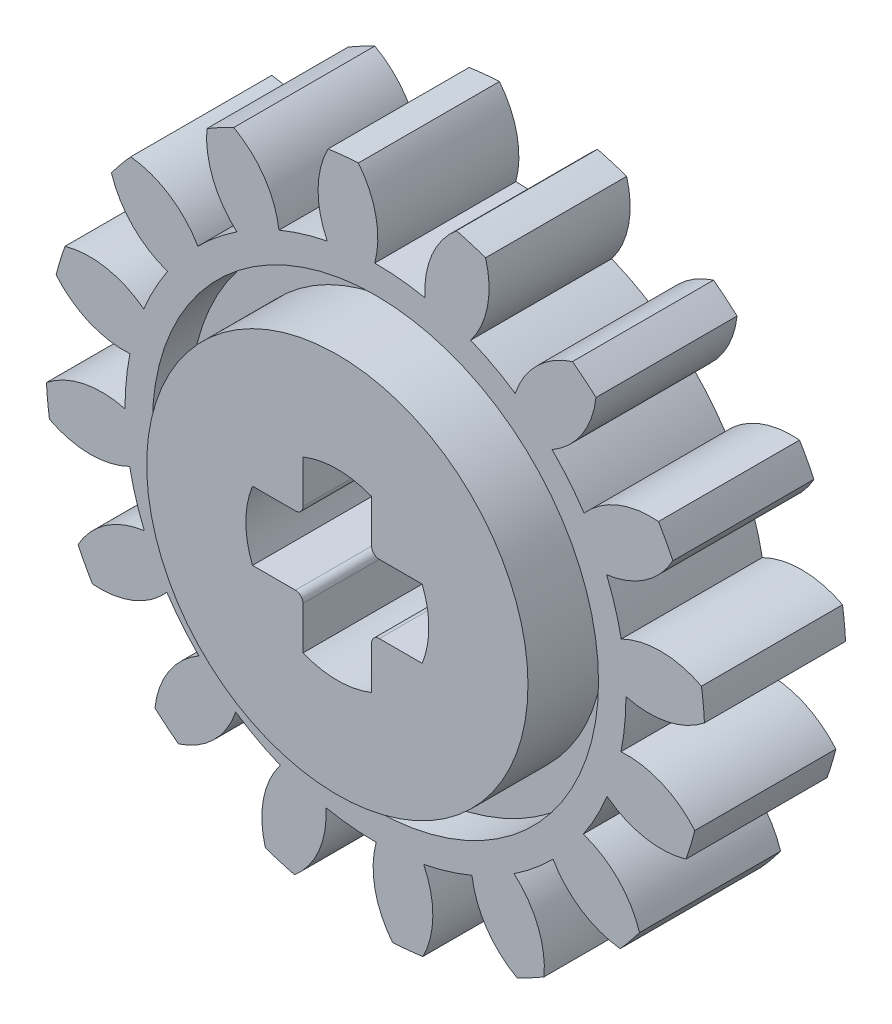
ISO-10303-21;
HEADER;
FILE_DESCRIPTION(('STEP AP214'),'2;1');
FILE_NAME('part.step','',(''),(''),'','','');
FILE_SCHEMA(('AUTOMOTIVE_DESIGN { 1 0 10303 214 1 1 1 1 }'));
ENDSEC;
DATA;
#1=APPLICATION_CONTEXT('core data for automotive mechanical design processes');
#2=APPLICATION_PROTOCOL_DEFINITION('international standard','automotive_design',2000,#1);
#3=PRODUCT_CONTEXT('',#1,'mechanical');
#4=PRODUCT('Part','Part','',(#3));
#5=PRODUCT_RELATED_PRODUCT_CATEGORY('part','',(#4));
#6=PRODUCT_DEFINITION_FORMATION('','',#4);
#7=PRODUCT_DEFINITION_CONTEXT('part definition',#1,'design');
#8=PRODUCT_DEFINITION('design','',#6,#7);
#9=PRODUCT_DEFINITION_SHAPE('','',#8);
#10=(LENGTH_UNIT() NAMED_UNIT(*) SI_UNIT(.MILLI.,.METRE.));
#11=(NAMED_UNIT(*) PLANE_ANGLE_UNIT() SI_UNIT($,.RADIAN.));
#12=(NAMED_UNIT(*) SI_UNIT($,.STERADIAN.) SOLID_ANGLE_UNIT());
#13=UNCERTAINTY_MEASURE_WITH_UNIT(LENGTH_MEASURE(1.E-05),#10,'distance_accuracy_value','');
#14=(GEOMETRIC_REPRESENTATION_CONTEXT(3) GLOBAL_UNCERTAINTY_ASSIGNED_CONTEXT((#13)) GLOBAL_UNIT_ASSIGNED_CONTEXT((#10,
#11,#12)) REPRESENTATION_CONTEXT('',''));
#15=CARTESIAN_POINT('',(0.,0.,0.));
#16=DIRECTION('',(0.,0.,1.));
#17=DIRECTION('',(1.,0.,0.));
#18=AXIS2_PLACEMENT_3D('',#15,#16,#17);
#19=CARTESIAN_POINT('',(218.693402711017,178.420743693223,0.85));
#20=DIRECTION('',(0.,0.,1.));
#21=DIRECTION('',(1.,0.,0.));
#22=AXIS2_PLACEMENT_3D('',#19,#20,#21);
#23=PLANE('',#22);
#24=CARTESIAN_POINT('',(218.693402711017,178.420743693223,0.85));
#25=DIRECTION('',(0.,0.,1.));
#26=DIRECTION('',(1.,0.,0.));
#27=AXIS2_PLACEMENT_3D('',#24,#25,#26);
#28=CIRCLE('',#27,5.85);
#29=CARTESIAN_POINT('',(224.543402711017,178.420743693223,0.85));
#30=VERTEX_POINT('',#29);
#31=EDGE_CURVE('E648',#30,#30,#28,.T.);
#32=ORIENTED_EDGE('',*,*,#31,.T.);
#33=EDGE_LOOP('',(#32));
#34=FACE_BOUND('',#33,.T.);
#35=CARTESIAN_POINT('',(218.693402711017,178.420743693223,0.85));
#36=DIRECTION('',(0.,0.,1.));
#37=DIRECTION('',(1.,0.,0.));
#38=AXIS2_PLACEMENT_3D('',#35,#36,#37);
#39=CIRCLE('',#38,5.00000000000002);
#40=CARTESIAN_POINT('',(223.693402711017,178.420743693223,0.85));
#41=VERTEX_POINT('',#40);
#42=EDGE_CURVE('E615',#41,#41,#39,.T.);
#43=ORIENTED_EDGE('',*,*,#42,.F.);
#44=EDGE_LOOP('',(#43));
#45=FACE_BOUND('',#44,.T.);
#46=ADVANCED_FACE('F35',(#34,#45),#23,.T.);
#47=CARTESIAN_POINT('',(218.693402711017,178.420743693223,-0.85));
#48=DIRECTION('',(0.,0.,-1.));
#49=DIRECTION('',(-1.,0.,0.));
#50=AXIS2_PLACEMENT_3D('',#47,#48,#49);
#51=PLANE('',#50);
#52=CARTESIAN_POINT('',(218.693402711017,178.420743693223,-0.85));
#53=DIRECTION('',(0.,0.,-1.));
#54=DIRECTION('',(-1.,0.,0.));
#55=AXIS2_PLACEMENT_3D('',#52,#53,#54);
#56=CIRCLE('',#55,5.85);
#57=CARTESIAN_POINT('',(212.843402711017,178.420743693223,-0.85));
#58=VERTEX_POINT('',#57);
#59=EDGE_CURVE('E642',#58,#58,#56,.T.);
#60=ORIENTED_EDGE('',*,*,#59,.T.);
#61=EDGE_LOOP('',(#60));
#62=FACE_BOUND('',#61,.T.);
#63=CARTESIAN_POINT('',(218.693402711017,178.420743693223,-0.85));
#64=DIRECTION('',(0.,0.,-1.));
#65=DIRECTION('',(-1.,0.,0.));
#66=AXIS2_PLACEMENT_3D('',#63,#64,#65);
#67=CIRCLE('',#66,5.00000000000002);
#68=CARTESIAN_POINT('',(213.693402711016,178.420743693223,-0.85));
#69=VERTEX_POINT('',#68);
#70=EDGE_CURVE('E633',#69,#69,#67,.T.);
#71=ORIENTED_EDGE('',*,*,#70,.F.);
#72=EDGE_LOOP('',(#71));
#73=FACE_BOUND('',#72,.T.);
#74=ADVANCED_FACE('F1194',(#62,#73),#51,.T.);
#75=CARTESIAN_POINT('',(212.932707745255,173.581114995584,1.85));
#76=DIRECTION('',(0.,0.,-1.));
#77=DIRECTION('',(-1.,0.,0.));
#78=AXIS2_PLACEMENT_3D('',#75,#76,#77);
#79=CYLINDRICAL_SURFACE('',#78,2.32841696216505);
#80=CARTESIAN_POINT('',(212.932707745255,173.581114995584,-1.85));
#81=DIRECTION('',(0.,0.,1.));
#82=DIRECTION('',(-1.,0.,0.));
#83=AXIS2_PLACEMENT_3D('',#80,#81,#82);
#84=CIRCLE('',#83,2.32841696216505);
#85=CARTESIAN_POINT('',(212.631270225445,175.889937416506,-1.85));
#86=VERTEX_POINT('',#85);
#87=CARTESIAN_POINT('',(210.893345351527,174.704737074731,-1.85));
#88=VERTEX_POINT('',#87);
#89=EDGE_CURVE('E651',#86,#88,#84,.T.);
#90=ORIENTED_EDGE('',*,*,#89,.T.);
#91=DIRECTION('',(0.,0.,-1.));
#92=VECTOR('',#91,1.);
#93=CARTESIAN_POINT('',(210.893345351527,174.704737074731,1.85));
#94=LINE('',#93,#92);
#95=CARTESIAN_POINT('',(210.893345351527,174.704737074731,1.85));
#96=VERTEX_POINT('',#95);
#97=EDGE_CURVE('E1097',#96,#88,#94,.T.);
#98=ORIENTED_EDGE('',*,*,#97,.F.);
#99=CARTESIAN_POINT('',(212.932707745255,173.581114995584,1.85));
#100=DIRECTION('',(0.,0.,1.));
#101=DIRECTION('',(-1.,0.,0.));
#102=AXIS2_PLACEMENT_3D('',#99,#100,#101);
#103=CIRCLE('',#102,2.32841696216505);
#104=CARTESIAN_POINT('',(212.631270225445,175.889937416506,1.85));
#105=VERTEX_POINT('',#104);
#106=EDGE_CURVE('E657',#105,#96,#103,.T.);
#107=ORIENTED_EDGE('',*,*,#106,.F.);
#108=DIRECTION('',(0.,0.,-1.));
#109=VECTOR('',#108,1.);
#110=CARTESIAN_POINT('',(212.631270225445,175.889937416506,1.85));
#111=LINE('',#110,#109);
#112=EDGE_CURVE('E1100',#105,#86,#111,.T.);
#113=ORIENTED_EDGE('',*,*,#112,.T.);
#114=EDGE_LOOP('',(#90,#98,#107,#113));
#115=FACE_BOUND('',#114,.T.);
#116=ADVANCED_FACE('F1200',(#115),#79,.T.);
#117=CARTESIAN_POINT('',(218.693402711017,178.420743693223,1.85));
#118=DIRECTION('',(0.,0.,-1.));
#119=DIRECTION('',(-1.,0.,0.));
#120=AXIS2_PLACEMENT_3D('',#117,#118,#119);
#121=CYLINDRICAL_SURFACE('',#120,8.64000000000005);
#122=CARTESIAN_POINT('',(218.693402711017,178.420743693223,-1.85));
#123=DIRECTION('',(0.,0.,1.));
#124=DIRECTION('',(-1.,0.,0.));
#125=AXIS2_PLACEMENT_3D('',#122,#123,#124);
#126=CIRCLE('',#125,8.64000000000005);
#127=CARTESIAN_POINT('',(211.270176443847,173.999735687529,-1.85));
#128=VERTEX_POINT('',#127);
#129=EDGE_CURVE('E787',#88,#128,#126,.T.);
#130=ORIENTED_EDGE('',*,*,#129,.T.);
#131=DIRECTION('',(0.,0.,-1.));
#132=VECTOR('',#131,1.);
#133=CARTESIAN_POINT('',(211.270176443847,173.999735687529,1.85));
#134=LINE('',#133,#132);
#135=CARTESIAN_POINT('',(211.270176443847,173.999735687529,1.85));
#136=VERTEX_POINT('',#135);
#137=EDGE_CURVE('E1094',#136,#128,#134,.T.);
#138=ORIENTED_EDGE('',*,*,#137,.F.);
#139=CARTESIAN_POINT('',(218.693402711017,178.420743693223,1.85));
#140=DIRECTION('',(0.,0.,1.));
#141=DIRECTION('',(-1.,0.,0.));
#142=AXIS2_PLACEMENT_3D('',#139,#140,#141);
#143=CIRCLE('',#142,8.64000000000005);
#144=EDGE_CURVE('E660',#96,#136,#143,.T.);
#145=ORIENTED_EDGE('',*,*,#144,.F.);
#146=ORIENTED_EDGE('',*,*,#97,.T.);
#147=EDGE_LOOP('',(#130,#138,#145,#146));
#148=FACE_BOUND('',#147,.T.);
#149=ADVANCED_FACE('F1466',(#148),#121,.T.);
#150=CARTESIAN_POINT('',(211.468927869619,176.319654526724,1.85));
#151=DIRECTION('',(0.,0.,-1.));
#152=DIRECTION('',(-1.,0.,0.));
#153=AXIS2_PLACEMENT_3D('',#150,#151,#152);
#154=CYLINDRICAL_SURFACE('',#153,2.32841696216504);
#155=CARTESIAN_POINT('',(211.468927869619,176.319654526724,-1.85));
#156=DIRECTION('',(0.,0.,1.));
#157=DIRECTION('',(-1.,0.,0.));
#158=AXIS2_PLACEMENT_3D('',#155,#156,#157);
#159=CIRCLE('',#158,2.32841696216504);
#160=CARTESIAN_POINT('',(213.221173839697,174.786305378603,-1.85));
#161=VERTEX_POINT('',#160);
#162=EDGE_CURVE('E789',#128,#161,#159,.T.);
#163=ORIENTED_EDGE('',*,*,#162,.T.);
#164=DIRECTION('',(0.,0.,-1.));
#165=VECTOR('',#164,1.);
#166=CARTESIAN_POINT('',(213.221173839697,174.786305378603,1.85));
#167=LINE('',#166,#165);
#168=CARTESIAN_POINT('',(213.221173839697,174.786305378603,1.85));
#169=VERTEX_POINT('',#168);
#170=EDGE_CURVE('E1091',#169,#161,#167,.T.);
#171=ORIENTED_EDGE('',*,*,#170,.F.);
#172=CARTESIAN_POINT('',(211.468927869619,176.319654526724,1.85));
#173=DIRECTION('',(0.,0.,1.));
#174=DIRECTION('',(-1.,0.,0.));
#175=AXIS2_PLACEMENT_3D('',#172,#173,#174);
#176=CIRCLE('',#175,2.32841696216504);
#177=EDGE_CURVE('E662',#136,#169,#176,.T.);
#178=ORIENTED_EDGE('',*,*,#177,.F.);
#179=ORIENTED_EDGE('',*,*,#137,.T.);
#180=EDGE_LOOP('',(#163,#171,#178,#179));
#181=FACE_BOUND('',#180,.T.);
#182=ADVANCED_FACE('F1462',(#181),#154,.T.);
#183=CARTESIAN_POINT('',(218.693402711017,178.420743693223,1.85));
#184=DIRECTION('',(0.,0.,-1.));
#185=DIRECTION('',(-1.,0.,0.));
#186=AXIS2_PLACEMENT_3D('',#183,#184,#185);
#187=CYLINDRICAL_SURFACE('',#186,6.56920319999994);
#188=CARTESIAN_POINT('',(218.693402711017,178.420743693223,-1.85));
#189=DIRECTION('',(0.,0.,1.));
#190=DIRECTION('',(-1.,0.,0.));
#191=AXIS2_PLACEMENT_3D('',#188,#189,#190);
#192=CIRCLE('',#191,6.56920319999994);
#193=CARTESIAN_POINT('',(214.061220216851,173.762705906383,-1.85));
#194=VERTEX_POINT('',#193);
#195=EDGE_CURVE('E791',#161,#194,#192,.T.);
#196=ORIENTED_EDGE('',*,*,#195,.T.);
#197=DIRECTION('',(0.,0.,-1.));
#198=VECTOR('',#197,1.);
#199=CARTESIAN_POINT('',(214.061220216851,173.762705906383,1.85));
#200=LINE('',#199,#198);
#201=CARTESIAN_POINT('',(214.061220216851,173.762705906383,1.85));
#202=VERTEX_POINT('',#201);
#203=EDGE_CURVE('E1088',#202,#194,#200,.T.);
#204=ORIENTED_EDGE('',*,*,#203,.F.);
#205=CARTESIAN_POINT('',(218.693402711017,178.420743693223,1.85));
#206=DIRECTION('',(0.,0.,1.));
#207=DIRECTION('',(-1.,0.,0.));
#208=AXIS2_PLACEMENT_3D('',#205,#206,#207);
#209=CIRCLE('',#208,6.56920319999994);
#210=EDGE_CURVE('E664',#169,#202,#209,.T.);
#211=ORIENTED_EDGE('',*,*,#210,.F.);
#212=ORIENTED_EDGE('',*,*,#170,.T.);
#213=EDGE_LOOP('',(#196,#204,#211,#212));
#214=FACE_BOUND('',#213,.T.);
#215=ADVANCED_FACE('F1458',(#214),#187,.T.);
#216=CARTESIAN_POINT('',(215.223260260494,171.744987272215,1.85));
#217=DIRECTION('',(0.,0.,-1.));
#218=DIRECTION('',(-1.,0.,0.));
#219=AXIS2_PLACEMENT_3D('',#216,#217,#218);
#220=CYLINDRICAL_SURFACE('',#219,2.32841696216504);
#221=CARTESIAN_POINT('',(215.223260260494,171.744987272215,-1.85));
#222=DIRECTION('',(0.,0.,1.));
#223=DIRECTION('',(-1.,0.,0.));
#224=AXIS2_PLACEMENT_3D('',#221,#222,#223);
#225=CIRCLE('',#224,2.32841696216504);
#226=CARTESIAN_POINT('',(212.909143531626,172.002648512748,-1.85));
#227=VERTEX_POINT('',#226);
#228=EDGE_CURVE('E793',#194,#227,#225,.T.);
#229=ORIENTED_EDGE('',*,*,#228,.T.);
#230=DIRECTION('',(0.,0.,-1.));
#231=VECTOR('',#230,1.);
#232=CARTESIAN_POINT('',(212.909143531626,172.002648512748,1.85));
#233=LINE('',#232,#231);
#234=CARTESIAN_POINT('',(212.909143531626,172.002648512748,1.85));
#235=VERTEX_POINT('',#234);
#236=EDGE_CURVE('E1085',#235,#227,#233,.T.);
#237=ORIENTED_EDGE('',*,*,#236,.F.);
#238=CARTESIAN_POINT('',(215.223260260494,171.744987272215,1.85));
#239=DIRECTION('',(0.,0.,1.));
#240=DIRECTION('',(-1.,0.,0.));
#241=AXIS2_PLACEMENT_3D('',#238,#239,#240);
#242=CIRCLE('',#241,2.32841696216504);
#243=EDGE_CURVE('E666',#202,#235,#242,.T.);
#244=ORIENTED_EDGE('',*,*,#243,.F.);
#245=ORIENTED_EDGE('',*,*,#203,.T.);
#246=EDGE_LOOP('',(#229,#237,#244,#245));
#247=FACE_BOUND('',#246,.T.);
#248=ADVANCED_FACE('F1454',(#247),#220,.T.);
#249=CARTESIAN_POINT('',(218.693402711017,178.420743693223,1.85));
#250=DIRECTION('',(0.,0.,-1.));
#251=DIRECTION('',(-1.,0.,0.));
#252=AXIS2_PLACEMENT_3D('',#249,#250,#251);
#253=CYLINDRICAL_SURFACE('',#252,8.63999999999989);
#254=CARTESIAN_POINT('',(218.693402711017,178.420743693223,-1.85));
#255=DIRECTION('',(0.,0.,1.));
#256=DIRECTION('',(-1.,0.,0.));
#257=AXIS2_PLACEMENT_3D('',#254,#255,#256);
#258=CIRCLE('',#257,8.63999999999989);
#259=CARTESIAN_POINT('',(213.527082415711,171.495519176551,-1.85));
#260=VERTEX_POINT('',#259);
#261=EDGE_CURVE('E795',#227,#260,#258,.T.);
#262=ORIENTED_EDGE('',*,*,#261,.T.);
#263=DIRECTION('',(0.,0.,-1.));
#264=VECTOR('',#263,1.);
#265=CARTESIAN_POINT('',(213.527082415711,171.495519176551,1.85));
#266=LINE('',#265,#264);
#267=CARTESIAN_POINT('',(213.527082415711,171.495519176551,1.85));
#268=VERTEX_POINT('',#267);
#269=EDGE_CURVE('E1082',#268,#260,#266,.T.);
#270=ORIENTED_EDGE('',*,*,#269,.F.);
#271=CARTESIAN_POINT('',(218.693402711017,178.420743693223,1.85));
#272=DIRECTION('',(0.,0.,1.));
#273=DIRECTION('',(-1.,0.,0.));
#274=AXIS2_PLACEMENT_3D('',#271,#272,#273);
#275=CIRCLE('',#274,8.63999999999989);
#276=EDGE_CURVE('E668',#235,#268,#275,.T.);
#277=ORIENTED_EDGE('',*,*,#276,.F.);
#278=ORIENTED_EDGE('',*,*,#236,.T.);
#279=EDGE_LOOP('',(#262,#270,#277,#278));
#280=FACE_BOUND('',#279,.T.);
#281=ADVANCED_FACE('F1450',(#280),#253,.T.);
#282=CARTESIAN_POINT('',(212.822910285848,173.714903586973,1.85));
#283=DIRECTION('',(0.,0.,-1.));
#284=DIRECTION('',(-1.,0.,0.));
#285=AXIS2_PLACEMENT_3D('',#282,#283,#284);
#286=CYLINDRICAL_SURFACE('',#285,2.32841696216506);
#287=CARTESIAN_POINT('',(212.822910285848,173.714903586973,-1.85));
#288=DIRECTION('',(0.,0.,1.));
#289=DIRECTION('',(-1.,0.,0.));
#290=AXIS2_PLACEMENT_3D('',#287,#288,#289);
#291=CIRCLE('',#290,2.32841696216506);
#292=CARTESIAN_POINT('',(215.028561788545,172.968829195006,-1.85));
#293=VERTEX_POINT('',#292);
#294=EDGE_CURVE('E797',#260,#293,#291,.T.);
#295=ORIENTED_EDGE('',*,*,#294,.T.);
#296=DIRECTION('',(0.,0.,-1.));
#297=VECTOR('',#296,1.);
#298=CARTESIAN_POINT('',(215.028561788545,172.968829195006,1.85));
#299=LINE('',#298,#297);
#300=CARTESIAN_POINT('',(215.028561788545,172.968829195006,1.85));
#301=VERTEX_POINT('',#300);
#302=EDGE_CURVE('E1079',#301,#293,#299,.T.);
#303=ORIENTED_EDGE('',*,*,#302,.F.);
#304=CARTESIAN_POINT('',(212.822910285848,173.714903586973,1.85));
#305=DIRECTION('',(0.,0.,1.));
#306=DIRECTION('',(-1.,0.,0.));
#307=AXIS2_PLACEMENT_3D('',#304,#305,#306);
#308=CIRCLE('',#307,2.32841696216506);
#309=EDGE_CURVE('E670',#268,#301,#308,.T.);
#310=ORIENTED_EDGE('',*,*,#309,.F.);
#311=ORIENTED_EDGE('',*,*,#269,.T.);
#312=EDGE_LOOP('',(#295,#303,#310,#311));
#313=FACE_BOUND('',#312,.T.);
#314=ADVANCED_FACE('F1446',(#313),#286,.T.);
#315=CARTESIAN_POINT('',(218.693402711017,178.420743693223,1.85));
#316=DIRECTION('',(0.,0.,-1.));
#317=DIRECTION('',(-1.,0.,0.));
#318=AXIS2_PLACEMENT_3D('',#315,#316,#317);
#319=CYLINDRICAL_SURFACE('',#318,6.56920319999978);
#320=CARTESIAN_POINT('',(218.693402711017,178.420743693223,-1.85));
#321=DIRECTION('',(0.,0.,1.));
#322=DIRECTION('',(-1.,0.,0.));
#323=AXIS2_PLACEMENT_3D('',#320,#321,#322);
#324=CIRCLE('',#323,6.56920319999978);
#325=CARTESIAN_POINT('',(216.196378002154,172.344618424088,-1.85));
#326=VERTEX_POINT('',#325);
#327=EDGE_CURVE('E799',#293,#326,#324,.T.);
#328=ORIENTED_EDGE('',*,*,#327,.T.);
#329=DIRECTION('',(0.,0.,-1.));
#330=VECTOR('',#329,1.);
#331=CARTESIAN_POINT('',(216.196378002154,172.344618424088,1.85));
#332=LINE('',#331,#330);
#333=CARTESIAN_POINT('',(216.196378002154,172.344618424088,1.85));
#334=VERTEX_POINT('',#333);
#335=EDGE_CURVE('E1076',#334,#326,#332,.T.);
#336=ORIENTED_EDGE('',*,*,#335,.F.);
#337=CARTESIAN_POINT('',(218.693402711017,178.420743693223,1.85));
#338=DIRECTION('',(0.,0.,1.));
#339=DIRECTION('',(-1.,0.,0.));
#340=AXIS2_PLACEMENT_3D('',#337,#338,#339);
#341=CIRCLE('',#340,6.56920319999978);
#342=EDGE_CURVE('E672',#301,#334,#341,.T.);
#343=ORIENTED_EDGE('',*,*,#342,.F.);
#344=ORIENTED_EDGE('',*,*,#302,.T.);
#345=EDGE_LOOP('',(#328,#336,#343,#344));
#346=FACE_BOUND('',#345,.T.);
#347=ADVANCED_FACE('F1442',(#346),#319,.T.);
#348=CARTESIAN_POINT('',(218.042110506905,170.925182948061,1.85));
#349=DIRECTION('',(0.,0.,-1.));
#350=DIRECTION('',(-1.,0.,0.));
#351=AXIS2_PLACEMENT_3D('',#348,#349,#350);
#352=CYLINDRICAL_SURFACE('',#351,2.3284169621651);
#353=CARTESIAN_POINT('',(218.042110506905,170.925182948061,-1.85));
#354=DIRECTION('',(0.,0.,1.));
#355=DIRECTION('',(-1.,0.,0.));
#356=AXIS2_PLACEMENT_3D('',#353,#354,#355);
#357=CIRCLE('',#356,2.3284169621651);
#358=CARTESIAN_POINT('',(215.805542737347,170.277656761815,-1.85));
#359=VERTEX_POINT('',#358);
#360=EDGE_CURVE('E801',#326,#359,#357,.T.);
#361=ORIENTED_EDGE('',*,*,#360,.T.);
#362=DIRECTION('',(0.,0.,-1.));
#363=VECTOR('',#362,1.);
#364=CARTESIAN_POINT('',(215.805542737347,170.277656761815,1.85));
#365=LINE('',#364,#363);
#366=CARTESIAN_POINT('',(215.805542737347,170.277656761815,1.85));
#367=VERTEX_POINT('',#366);
#368=EDGE_CURVE('E1073',#367,#359,#365,.T.);
#369=ORIENTED_EDGE('',*,*,#368,.F.);
#370=CARTESIAN_POINT('',(218.042110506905,170.925182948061,1.85));
#371=DIRECTION('',(0.,0.,1.));
#372=DIRECTION('',(-1.,0.,0.));
#373=AXIS2_PLACEMENT_3D('',#370,#371,#372);
#374=CIRCLE('',#373,2.3284169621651);
#375=EDGE_CURVE('E674',#334,#367,#374,.T.);
#376=ORIENTED_EDGE('',*,*,#375,.F.);
#377=ORIENTED_EDGE('',*,*,#335,.T.);
#378=EDGE_LOOP('',(#361,#369,#376,#377));
#379=FACE_BOUND('',#378,.T.);
#380=ADVANCED_FACE('F1438',(#379),#352,.T.);
#381=CARTESIAN_POINT('',(218.693402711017,178.420743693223,1.85));
#382=DIRECTION('',(0.,0.,-1.));
#383=DIRECTION('',(-1.,0.,0.));
#384=AXIS2_PLACEMENT_3D('',#381,#382,#383);
#385=CYLINDRICAL_SURFACE('',#384,8.6399999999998);
#386=CARTESIAN_POINT('',(218.693402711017,178.420743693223,-1.85));
#387=DIRECTION('',(0.,0.,1.));
#388=DIRECTION('',(-1.,0.,0.));
#389=AXIS2_PLACEMENT_3D('',#386,#387,#388);
#390=CIRCLE('',#389,8.6399999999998);
#391=CARTESIAN_POINT('',(216.570513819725,170.04560532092,-1.85));
#392=VERTEX_POINT('',#391);
#393=EDGE_CURVE('E803',#359,#392,#390,.T.);
#394=ORIENTED_EDGE('',*,*,#393,.T.);
#395=DIRECTION('',(0.,0.,-1.));
#396=VECTOR('',#395,1.);
#397=CARTESIAN_POINT('',(216.570513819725,170.04560532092,1.85));
#398=LINE('',#397,#396);
#399=CARTESIAN_POINT('',(216.570513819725,170.04560532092,1.85));
#400=VERTEX_POINT('',#399);
#401=EDGE_CURVE('E1070',#400,#392,#398,.T.);
#402=ORIENTED_EDGE('',*,*,#401,.F.);
#403=CARTESIAN_POINT('',(218.693402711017,178.420743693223,1.85));
#404=DIRECTION('',(0.,0.,1.));
#405=DIRECTION('',(-1.,0.,0.));
#406=AXIS2_PLACEMENT_3D('',#403,#404,#405);
#407=CIRCLE('',#406,8.6399999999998);
#408=EDGE_CURVE('E676',#367,#400,#407,.T.);
#409=ORIENTED_EDGE('',*,*,#408,.F.);
#410=ORIENTED_EDGE('',*,*,#368,.T.);
#411=EDGE_LOOP('',(#394,#402,#409,#410));
#412=FACE_BOUND('',#411,.T.);
#413=ADVANCED_FACE('F1434',(#412),#385,.T.);
#414=CARTESIAN_POINT('',(215.070621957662,171.826574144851,1.85));
#415=DIRECTION('',(0.,0.,-1.));
#416=DIRECTION('',(-1.,0.,0.));
#417=AXIS2_PLACEMENT_3D('',#414,#415,#416);
#418=CYLINDRICAL_SURFACE('',#417,2.32841696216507);
#419=CARTESIAN_POINT('',(215.070621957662,171.826574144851,-1.85));
#420=DIRECTION('',(0.,0.,1.));
#421=DIRECTION('',(-1.,0.,0.));
#422=AXIS2_PLACEMENT_3D('',#419,#420,#421);
#423=CIRCLE('',#422,2.32841696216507);
#424=CARTESIAN_POINT('',(217.393888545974,171.981357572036,-1.85));
#425=VERTEX_POINT('',#424);
#426=EDGE_CURVE('E805',#392,#425,#423,.T.);
#427=ORIENTED_EDGE('',*,*,#426,.T.);
#428=DIRECTION('',(0.,0.,-1.));
#429=VECTOR('',#428,1.);
#430=CARTESIAN_POINT('',(217.393888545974,171.981357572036,1.85));
#431=LINE('',#430,#429);
#432=CARTESIAN_POINT('',(217.393888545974,171.981357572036,1.85));
#433=VERTEX_POINT('',#432);
#434=EDGE_CURVE('E1067',#433,#425,#431,.T.);
#435=ORIENTED_EDGE('',*,*,#434,.F.);
#436=CARTESIAN_POINT('',(215.070621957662,171.826574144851,1.85));
#437=DIRECTION('',(0.,0.,1.));
#438=DIRECTION('',(-1.,0.,0.));
#439=AXIS2_PLACEMENT_3D('',#436,#437,#438);
#440=CIRCLE('',#439,2.32841696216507);
#441=EDGE_CURVE('E678',#400,#433,#440,.T.);
#442=ORIENTED_EDGE('',*,*,#441,.F.);
#443=ORIENTED_EDGE('',*,*,#401,.T.);
#444=EDGE_LOOP('',(#427,#435,#442,#443));
#445=FACE_BOUND('',#444,.T.);
#446=ADVANCED_FACE('F1430',(#445),#418,.T.);
#447=CARTESIAN_POINT('',(218.693402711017,178.420743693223,1.85));
#448=DIRECTION('',(0.,0.,-1.));
#449=DIRECTION('',(-1.,0.,0.));
#450=AXIS2_PLACEMENT_3D('',#447,#448,#449);
#451=CYLINDRICAL_SURFACE('',#450,6.56920319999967);
#452=CARTESIAN_POINT('',(218.693402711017,178.420743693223,-1.85));
#453=DIRECTION('',(0.,0.,1.));
#454=DIRECTION('',(-1.,0.,0.));
#455=AXIS2_PLACEMENT_3D('',#452,#453,#454);
#456=CIRCLE('',#455,6.56920319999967);
#457=CARTESIAN_POINT('',(218.711685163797,171.851565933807,-1.85));
#458=VERTEX_POINT('',#457);
#459=EDGE_CURVE('E807',#425,#458,#456,.T.);
#460=ORIENTED_EDGE('',*,*,#459,.T.);
#461=DIRECTION('',(0.,0.,-1.));
#462=VECTOR('',#461,1.);
#463=CARTESIAN_POINT('',(218.711685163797,171.851565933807,1.85));
#464=LINE('',#463,#462);
#465=CARTESIAN_POINT('',(218.711685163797,171.851565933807,1.85));
#466=VERTEX_POINT('',#465);
#467=EDGE_CURVE('E1064',#466,#458,#464,.T.);
#468=ORIENTED_EDGE('',*,*,#467,.F.);
#469=CARTESIAN_POINT('',(218.693402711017,178.420743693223,1.85));
#470=DIRECTION('',(0.,0.,1.));
#471=DIRECTION('',(-1.,0.,0.));
#472=AXIS2_PLACEMENT_3D('',#469,#470,#471);
#473=CIRCLE('',#472,6.56920319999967);
#474=EDGE_CURVE('E680',#433,#466,#473,.T.);
#475=ORIENTED_EDGE('',*,*,#474,.F.);
#476=ORIENTED_EDGE('',*,*,#434,.T.);
#477=EDGE_LOOP('',(#460,#468,#475,#476));
#478=FACE_BOUND('',#477,.T.);
#479=ADVANCED_FACE('F1426',(#478),#451,.T.);
#480=CARTESIAN_POINT('',(220.960114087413,171.246509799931,1.85));
#481=DIRECTION('',(0.,0.,-1.));
#482=DIRECTION('',(-1.,0.,0.));
#483=AXIS2_PLACEMENT_3D('',#480,#481,#482);
#484=CYLINDRICAL_SURFACE('',#483,2.32841696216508);
#485=CARTESIAN_POINT('',(220.960114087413,171.246509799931,-1.85));
#486=DIRECTION('',(0.,0.,1.));
#487=DIRECTION('',(-1.,0.,0.));
#488=AXIS2_PLACEMENT_3D('',#485,#486,#487);
#489=CIRCLE('',#488,2.32841696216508);
#490=CARTESIAN_POINT('',(219.141592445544,169.792376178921,-1.85));
#491=VERTEX_POINT('',#490);
#492=EDGE_CURVE('E809',#458,#491,#489,.T.);
#493=ORIENTED_EDGE('',*,*,#492,.T.);
#494=DIRECTION('',(0.,0.,-1.));
#495=VECTOR('',#494,1.);
#496=CARTESIAN_POINT('',(219.141592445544,169.792376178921,1.85));
#497=LINE('',#496,#495);
#498=CARTESIAN_POINT('',(219.141592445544,169.792376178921,1.85));
#499=VERTEX_POINT('',#498);
#500=EDGE_CURVE('E1061',#499,#491,#497,.T.);
#501=ORIENTED_EDGE('',*,*,#500,.F.);
#502=CARTESIAN_POINT('',(220.960114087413,171.246509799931,1.85));
#503=DIRECTION('',(0.,0.,1.));
#504=DIRECTION('',(-1.,0.,0.));
#505=AXIS2_PLACEMENT_3D('',#502,#503,#504);
#506=CIRCLE('',#505,2.32841696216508);
#507=EDGE_CURVE('E682',#466,#499,#506,.T.);
#508=ORIENTED_EDGE('',*,*,#507,.F.);
#509=ORIENTED_EDGE('',*,*,#467,.T.);
#510=EDGE_LOOP('',(#493,#501,#508,#509));
#511=FACE_BOUND('',#510,.T.);
#512=ADVANCED_FACE('F1422',(#511),#484,.T.);
#513=CARTESIAN_POINT('',(218.693402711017,178.420743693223,1.85));
#514=DIRECTION('',(0.,0.,-1.));
#515=DIRECTION('',(-1.,0.,0.));
#516=AXIS2_PLACEMENT_3D('',#513,#514,#515);
#517=CYLINDRICAL_SURFACE('',#516,8.63999999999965);
#518=CARTESIAN_POINT('',(218.693402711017,178.420743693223,-1.85));
#519=DIRECTION('',(0.,0.,1.));
#520=DIRECTION('',(-1.,0.,0.));
#521=AXIS2_PLACEMENT_3D('',#518,#519,#520);
#522=CIRCLE('',#521,8.63999999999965);
#523=CARTESIAN_POINT('',(219.937135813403,169.870730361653,-1.85));
#524=VERTEX_POINT('',#523);
#525=EDGE_CURVE('E811',#491,#524,#522,.T.);
#526=ORIENTED_EDGE('',*,*,#525,.T.);
#527=DIRECTION('',(0.,0.,-1.));
#528=VECTOR('',#527,1.);
#529=CARTESIAN_POINT('',(219.937135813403,169.870730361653,1.85));
#530=LINE('',#529,#528);
#531=CARTESIAN_POINT('',(219.937135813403,169.870730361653,1.85));
#532=VERTEX_POINT('',#531);
#533=EDGE_CURVE('E1058',#532,#524,#530,.T.);
#534=ORIENTED_EDGE('',*,*,#533,.F.);
#535=CARTESIAN_POINT('',(218.693402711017,178.420743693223,1.85));
#536=DIRECTION('',(0.,0.,1.));
#537=DIRECTION('',(-1.,0.,0.));
#538=AXIS2_PLACEMENT_3D('',#535,#536,#537);
#539=CIRCLE('',#538,8.63999999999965);
#540=EDGE_CURVE('E684',#499,#532,#539,.T.);
#541=ORIENTED_EDGE('',*,*,#540,.F.);
#542=ORIENTED_EDGE('',*,*,#500,.T.);
#543=EDGE_LOOP('',(#526,#534,#541,#542));
#544=FACE_BOUND('',#543,.T.);
#545=ADVANCED_FACE('F1418',(#544),#517,.T.);
#546=CARTESIAN_POINT('',(217.869869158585,170.942147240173,1.85));
#547=DIRECTION('',(0.,0.,-1.));
#548=DIRECTION('',(-1.,0.,0.));
#549=AXIS2_PLACEMENT_3D('',#546,#547,#548);
#550=CYLINDRICAL_SURFACE('',#549,2.32841696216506);
#551=CARTESIAN_POINT('',(217.869869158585,170.942147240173,-1.85));
#552=DIRECTION('',(0.,0.,1.));
#553=DIRECTION('',(-1.,0.,0.));
#554=AXIS2_PLACEMENT_3D('',#551,#552,#553);
#555=CIRCLE('',#554,2.32841696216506);
#556=CARTESIAN_POINT('',(219.957054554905,171.974224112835,-1.85));
#557=VERTEX_POINT('',#556);
#558=EDGE_CURVE('E813',#524,#557,#555,.T.);
#559=ORIENTED_EDGE('',*,*,#558,.T.);
#560=DIRECTION('',(0.,0.,-1.));
#561=VECTOR('',#560,1.);
#562=CARTESIAN_POINT('',(219.957054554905,171.974224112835,1.85));
#563=LINE('',#562,#561);
#564=CARTESIAN_POINT('',(219.957054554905,171.974224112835,1.85));
#565=VERTEX_POINT('',#564);
#566=EDGE_CURVE('E1055',#565,#557,#563,.T.);
#567=ORIENTED_EDGE('',*,*,#566,.F.);
#568=CARTESIAN_POINT('',(217.869869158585,170.942147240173,1.85));
#569=DIRECTION('',(0.,0.,1.));
#570=DIRECTION('',(-1.,0.,0.));
#571=AXIS2_PLACEMENT_3D('',#568,#569,#570);
#572=CIRCLE('',#571,2.32841696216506);
#573=EDGE_CURVE('E686',#532,#565,#572,.T.);
#574=ORIENTED_EDGE('',*,*,#573,.F.);
#575=ORIENTED_EDGE('',*,*,#533,.T.);
#576=EDGE_LOOP('',(#559,#567,#574,#575));
#577=FACE_BOUND('',#576,.T.);
#578=ADVANCED_FACE('F1414',(#577),#550,.T.);
#579=CARTESIAN_POINT('',(218.693402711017,178.420743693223,1.85));
#580=DIRECTION('',(0.,0.,-1.));
#581=DIRECTION('',(-1.,0.,0.));
#582=AXIS2_PLACEMENT_3D('',#579,#580,#581);
#583=CYLINDRICAL_SURFACE('',#582,6.56920319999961);
#584=CARTESIAN_POINT('',(218.693402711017,178.420743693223,-1.85));
#585=DIRECTION('',(0.,0.,1.));
#586=DIRECTION('',(-1.,0.,0.));
#587=AXIS2_PLACEMENT_3D('',#584,#585,#586);
#588=CIRCLE('',#587,6.56920319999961);
#589=CARTESIAN_POINT('',(221.224208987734,172.358611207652,-1.85));
#590=VERTEX_POINT('',#589);
#591=EDGE_CURVE('E815',#557,#590,#588,.T.);
#592=ORIENTED_EDGE('',*,*,#591,.T.);
#593=DIRECTION('',(0.,0.,-1.));
#594=VECTOR('',#593,1.);
#595=CARTESIAN_POINT('',(221.224208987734,172.358611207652,1.85));
#596=LINE('',#595,#594);
#597=CARTESIAN_POINT('',(221.224208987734,172.358611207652,1.85));
#598=VERTEX_POINT('',#597);
#599=EDGE_CURVE('E1052',#598,#590,#596,.T.);
#600=ORIENTED_EDGE('',*,*,#599,.F.);
#601=CARTESIAN_POINT('',(218.693402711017,178.420743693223,1.85));
#602=DIRECTION('',(0.,0.,1.));
#603=DIRECTION('',(-1.,0.,0.));
#604=AXIS2_PLACEMENT_3D('',#601,#602,#603);
#605=CIRCLE('',#604,6.56920319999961);
#606=EDGE_CURVE('E688',#565,#598,#605,.T.);
#607=ORIENTED_EDGE('',*,*,#606,.F.);
#608=ORIENTED_EDGE('',*,*,#566,.T.);
#609=EDGE_LOOP('',(#592,#600,#607,#608));
#610=FACE_BOUND('',#609,.T.);
#611=ADVANCED_FACE('F1410',(#610),#583,.T.);
#612=CARTESIAN_POINT('',(223.533031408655,172.660048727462,1.85));
#613=DIRECTION('',(0.,0.,-1.));
#614=DIRECTION('',(-1.,0.,0.));
#615=AXIS2_PLACEMENT_3D('',#612,#613,#614);
#616=CYLINDRICAL_SURFACE('',#615,2.32841696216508);
#617=CARTESIAN_POINT('',(223.533031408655,172.660048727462,-1.85));
#618=DIRECTION('',(0.,0.,1.));
#619=DIRECTION('',(-1.,0.,0.));
#620=AXIS2_PLACEMENT_3D('',#617,#618,#619);
#621=CIRCLE('',#620,2.32841696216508);
#622=CARTESIAN_POINT('',(222.409409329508,170.620686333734,-1.85));
#623=VERTEX_POINT('',#622);
#624=EDGE_CURVE('E817',#590,#623,#621,.T.);
#625=ORIENTED_EDGE('',*,*,#624,.T.);
#626=DIRECTION('',(0.,0.,-1.));
#627=VECTOR('',#626,1.);
#628=CARTESIAN_POINT('',(222.409409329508,170.620686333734,1.85));
#629=LINE('',#628,#627);
#630=CARTESIAN_POINT('',(222.409409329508,170.620686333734,1.85));
#631=VERTEX_POINT('',#630);
#632=EDGE_CURVE('E1049',#631,#623,#629,.T.);
#633=ORIENTED_EDGE('',*,*,#632,.F.);
#634=CARTESIAN_POINT('',(223.533031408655,172.660048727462,1.85));
#635=DIRECTION('',(0.,0.,1.));
#636=DIRECTION('',(-1.,0.,0.));
#637=AXIS2_PLACEMENT_3D('',#634,#635,#636);
#638=CIRCLE('',#637,2.32841696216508);
#639=EDGE_CURVE('E690',#598,#631,#638,.T.);
#640=ORIENTED_EDGE('',*,*,#639,.F.);
#641=ORIENTED_EDGE('',*,*,#599,.T.);
#642=EDGE_LOOP('',(#625,#633,#640,#641));
#643=FACE_BOUND('',#642,.T.);
#644=ADVANCED_FACE('F1406',(#643),#616,.T.);
#645=CARTESIAN_POINT('',(218.693402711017,178.420743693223,1.85));
#646=DIRECTION('',(0.,0.,-1.));
#647=DIRECTION('',(-1.,0.,0.));
#648=AXIS2_PLACEMENT_3D('',#645,#646,#647);
#649=CYLINDRICAL_SURFACE('',#648,8.63999999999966);
#650=CARTESIAN_POINT('',(218.693402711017,178.420743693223,-1.85));
#651=DIRECTION('',(0.,0.,1.));
#652=DIRECTION('',(-1.,0.,0.));
#653=AXIS2_PLACEMENT_3D('',#650,#651,#652);
#654=CIRCLE('',#653,8.63999999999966);
#655=CARTESIAN_POINT('',(223.11441071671,170.997517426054,-1.85));
#656=VERTEX_POINT('',#655);
#657=EDGE_CURVE('E819',#623,#656,#654,.T.);
#658=ORIENTED_EDGE('',*,*,#657,.T.);
#659=DIRECTION('',(0.,0.,-1.));
#660=VECTOR('',#659,1.);
#661=CARTESIAN_POINT('',(223.11441071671,170.997517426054,1.85));
#662=LINE('',#661,#660);
#663=CARTESIAN_POINT('',(223.11441071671,170.997517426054,1.85));
#664=VERTEX_POINT('',#663);
#665=EDGE_CURVE('E1046',#664,#656,#662,.T.);
#666=ORIENTED_EDGE('',*,*,#665,.F.);
#667=CARTESIAN_POINT('',(218.693402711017,178.420743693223,1.85));
#668=DIRECTION('',(0.,0.,1.));
#669=DIRECTION('',(-1.,0.,0.));
#670=AXIS2_PLACEMENT_3D('',#667,#668,#669);
#671=CIRCLE('',#670,8.63999999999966);
#672=EDGE_CURVE('E692',#631,#664,#671,.T.);
#673=ORIENTED_EDGE('',*,*,#672,.F.);
#674=ORIENTED_EDGE('',*,*,#632,.T.);
#675=EDGE_LOOP('',(#658,#666,#673,#674));
#676=FACE_BOUND('',#675,.T.);
#677=ADVANCED_FACE('F1402',(#676),#649,.T.);
#678=CARTESIAN_POINT('',(220.794491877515,171.196268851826,1.85));
#679=DIRECTION('',(0.,0.,-1.));
#680=DIRECTION('',(-1.,0.,0.));
#681=AXIS2_PLACEMENT_3D('',#678,#679,#680);
#682=CYLINDRICAL_SURFACE('',#681,2.32841696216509);
#683=CARTESIAN_POINT('',(220.794491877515,171.196268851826,-1.85));
#684=DIRECTION('',(0.,0.,1.));
#685=DIRECTION('',(-1.,0.,0.));
#686=AXIS2_PLACEMENT_3D('',#683,#684,#685);
#687=CIRCLE('',#686,2.32841696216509);
#688=CARTESIAN_POINT('',(222.327841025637,172.948514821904,-1.85));
#689=VERTEX_POINT('',#688);
#690=EDGE_CURVE('E821',#656,#689,#687,.T.);
#691=ORIENTED_EDGE('',*,*,#690,.T.);
#692=DIRECTION('',(0.,0.,-1.));
#693=VECTOR('',#692,1.);
#694=CARTESIAN_POINT('',(222.327841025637,172.948514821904,1.85));
#695=LINE('',#694,#693);
#696=CARTESIAN_POINT('',(222.327841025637,172.948514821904,1.85));
#697=VERTEX_POINT('',#696);
#698=EDGE_CURVE('E1043',#697,#689,#695,.T.);
#699=ORIENTED_EDGE('',*,*,#698,.F.);
#700=CARTESIAN_POINT('',(220.794491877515,171.196268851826,1.85));
#701=DIRECTION('',(0.,0.,1.));
#702=DIRECTION('',(-1.,0.,0.));
#703=AXIS2_PLACEMENT_3D('',#700,#701,#702);
#704=CIRCLE('',#703,2.32841696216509);
#705=EDGE_CURVE('E694',#664,#697,#704,.T.);
#706=ORIENTED_EDGE('',*,*,#705,.F.);
#707=ORIENTED_EDGE('',*,*,#665,.T.);
#708=EDGE_LOOP('',(#691,#699,#706,#707));
#709=FACE_BOUND('',#708,.T.);
#710=ADVANCED_FACE('F1398',(#709),#682,.T.);
#711=CARTESIAN_POINT('',(218.693402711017,178.420743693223,1.85));
#712=DIRECTION('',(0.,0.,-1.));
#713=DIRECTION('',(-1.,0.,0.));
#714=AXIS2_PLACEMENT_3D('',#711,#712,#713);
#715=CYLINDRICAL_SURFACE('',#714,6.56920319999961);
#716=CARTESIAN_POINT('',(218.693402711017,178.420743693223,-1.85));
#717=DIRECTION('',(0.,0.,1.));
#718=DIRECTION('',(-1.,0.,0.));
#719=AXIS2_PLACEMENT_3D('',#716,#717,#718);
#720=CIRCLE('',#719,6.56920319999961);
#721=CARTESIAN_POINT('',(223.351440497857,173.788561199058,-1.85));
#722=VERTEX_POINT('',#721);
#723=EDGE_CURVE('E823',#689,#722,#720,.T.);
#724=ORIENTED_EDGE('',*,*,#723,.T.);
#725=DIRECTION('',(0.,0.,-1.));
#726=VECTOR('',#725,1.);
#727=CARTESIAN_POINT('',(223.351440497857,173.788561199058,1.85));
#728=LINE('',#727,#726);
#729=CARTESIAN_POINT('',(223.351440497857,173.788561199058,1.85));
#730=VERTEX_POINT('',#729);
#731=EDGE_CURVE('E1040',#730,#722,#728,.T.);
#732=ORIENTED_EDGE('',*,*,#731,.F.);
#733=CARTESIAN_POINT('',(218.693402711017,178.420743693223,1.85));
#734=DIRECTION('',(0.,0.,1.));
#735=DIRECTION('',(-1.,0.,0.));
#736=AXIS2_PLACEMENT_3D('',#733,#734,#735);
#737=CIRCLE('',#736,6.56920319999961);
#738=EDGE_CURVE('E696',#697,#730,#737,.T.);
#739=ORIENTED_EDGE('',*,*,#738,.F.);
#740=ORIENTED_EDGE('',*,*,#698,.T.);
#741=EDGE_LOOP('',(#724,#732,#739,#740));
#742=FACE_BOUND('',#741,.T.);
#743=ADVANCED_FACE('F1394',(#742),#715,.T.);
#744=CARTESIAN_POINT('',(225.369159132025,174.950601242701,1.85));
#745=DIRECTION('',(0.,0.,-1.));
#746=DIRECTION('',(-1.,0.,0.));
#747=AXIS2_PLACEMENT_3D('',#744,#745,#746);
#748=CYLINDRICAL_SURFACE('',#747,2.32841696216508);
#749=CARTESIAN_POINT('',(225.369159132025,174.950601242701,-1.85));
#750=DIRECTION('',(0.,0.,1.));
#751=DIRECTION('',(-1.,0.,0.));
#752=AXIS2_PLACEMENT_3D('',#749,#750,#751);
#753=CIRCLE('',#752,2.32841696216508);
#754=CARTESIAN_POINT('',(225.111497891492,172.636484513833,-1.85));
#755=VERTEX_POINT('',#754);
#756=EDGE_CURVE('E825',#722,#755,#753,.T.);
#757=ORIENTED_EDGE('',*,*,#756,.T.);
#758=DIRECTION('',(0.,0.,-1.));
#759=VECTOR('',#758,1.);
#760=CARTESIAN_POINT('',(225.111497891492,172.636484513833,1.85));
#761=LINE('',#760,#759);
#762=CARTESIAN_POINT('',(225.111497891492,172.636484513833,1.85));
#763=VERTEX_POINT('',#762);
#764=EDGE_CURVE('E1037',#763,#755,#761,.T.);
#765=ORIENTED_EDGE('',*,*,#764,.F.);
#766=CARTESIAN_POINT('',(225.369159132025,174.950601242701,1.85));
#767=DIRECTION('',(0.,0.,1.));
#768=DIRECTION('',(-1.,0.,0.));
#769=AXIS2_PLACEMENT_3D('',#766,#767,#768);
#770=CIRCLE('',#769,2.32841696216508);
#771=EDGE_CURVE('E698',#730,#763,#770,.T.);
#772=ORIENTED_EDGE('',*,*,#771,.F.);
#773=ORIENTED_EDGE('',*,*,#731,.T.);
#774=EDGE_LOOP('',(#757,#765,#772,#773));
#775=FACE_BOUND('',#774,.T.);
#776=ADVANCED_FACE('F1390',(#775),#748,.T.);
#777=CARTESIAN_POINT('',(218.693402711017,178.420743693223,1.85));
#778=DIRECTION('',(0.,0.,-1.));
#779=DIRECTION('',(-1.,0.,0.));
#780=AXIS2_PLACEMENT_3D('',#777,#778,#779);
#781=CYLINDRICAL_SURFACE('',#780,8.6399999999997);
#782=CARTESIAN_POINT('',(218.693402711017,178.420743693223,-1.85));
#783=DIRECTION('',(0.,0.,1.));
#784=DIRECTION('',(-1.,0.,0.));
#785=AXIS2_PLACEMENT_3D('',#782,#783,#784);
#786=CIRCLE('',#785,8.6399999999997);
#787=CARTESIAN_POINT('',(225.618627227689,173.254423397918,-1.85));
#788=VERTEX_POINT('',#787);
#789=EDGE_CURVE('E827',#755,#788,#786,.T.);
#790=ORIENTED_EDGE('',*,*,#789,.T.);
#791=DIRECTION('',(0.,0.,-1.));
#792=VECTOR('',#791,1.);
#793=CARTESIAN_POINT('',(225.618627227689,173.254423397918,1.85));
#794=LINE('',#793,#792);
#795=CARTESIAN_POINT('',(225.618627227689,173.254423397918,1.85));
#796=VERTEX_POINT('',#795);
#797=EDGE_CURVE('E1034',#796,#788,#794,.T.);
#798=ORIENTED_EDGE('',*,*,#797,.F.);
#799=CARTESIAN_POINT('',(218.693402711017,178.420743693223,1.85));
#800=DIRECTION('',(0.,0.,1.));
#801=DIRECTION('',(-1.,0.,0.));
#802=AXIS2_PLACEMENT_3D('',#799,#800,#801);
#803=CIRCLE('',#802,8.6399999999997);
#804=EDGE_CURVE('E700',#763,#796,#803,.T.);
#805=ORIENTED_EDGE('',*,*,#804,.F.);
#806=ORIENTED_EDGE('',*,*,#764,.T.);
#807=EDGE_LOOP('',(#790,#798,#805,#806));
#808=FACE_BOUND('',#807,.T.);
#809=ADVANCED_FACE('F1386',(#808),#781,.T.);
#810=CARTESIAN_POINT('',(223.399242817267,172.550251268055,1.85));
#811=DIRECTION('',(0.,0.,-1.));
#812=DIRECTION('',(-1.,0.,0.));
#813=AXIS2_PLACEMENT_3D('',#810,#811,#812);
#814=CYLINDRICAL_SURFACE('',#813,2.32841696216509);
#815=CARTESIAN_POINT('',(223.399242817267,172.550251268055,-1.85));
#816=DIRECTION('',(0.,0.,1.));
#817=DIRECTION('',(-1.,0.,0.));
#818=AXIS2_PLACEMENT_3D('',#815,#816,#817);
#819=CIRCLE('',#818,2.32841696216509);
#820=CARTESIAN_POINT('',(224.145317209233,174.755902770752,-1.85));
#821=VERTEX_POINT('',#820);
#822=EDGE_CURVE('E829',#788,#821,#819,.T.);
#823=ORIENTED_EDGE('',*,*,#822,.T.);
#824=DIRECTION('',(0.,0.,-1.));
#825=VECTOR('',#824,1.);
#826=CARTESIAN_POINT('',(224.145317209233,174.755902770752,1.85));
#827=LINE('',#826,#825);
#828=CARTESIAN_POINT('',(224.145317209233,174.755902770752,1.85));
#829=VERTEX_POINT('',#828);
#830=EDGE_CURVE('E1031',#829,#821,#827,.T.);
#831=ORIENTED_EDGE('',*,*,#830,.F.);
#832=CARTESIAN_POINT('',(223.399242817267,172.550251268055,1.85));
#833=DIRECTION('',(0.,0.,1.));
#834=DIRECTION('',(-1.,0.,0.));
#835=AXIS2_PLACEMENT_3D('',#832,#833,#834);
#836=CIRCLE('',#835,2.32841696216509);
#837=EDGE_CURVE('E702',#796,#829,#836,.T.);
#838=ORIENTED_EDGE('',*,*,#837,.F.);
#839=ORIENTED_EDGE('',*,*,#797,.T.);
#840=EDGE_LOOP('',(#823,#831,#838,#839));
#841=FACE_BOUND('',#840,.T.);
#842=ADVANCED_FACE('F1382',(#841),#814,.T.);
#843=CARTESIAN_POINT('',(218.693402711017,178.420743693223,1.85));
#844=DIRECTION('',(0.,0.,-1.));
#845=DIRECTION('',(-1.,0.,0.));
#846=AXIS2_PLACEMENT_3D('',#843,#844,#845);
#847=CYLINDRICAL_SURFACE('',#846,6.56920319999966);
#848=CARTESIAN_POINT('',(218.693402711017,178.420743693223,-1.85));
#849=DIRECTION('',(0.,0.,1.));
#850=DIRECTION('',(-1.,0.,0.));
#851=AXIS2_PLACEMENT_3D('',#848,#849,#850);
#852=CIRCLE('',#851,6.56920319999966);
#853=CARTESIAN_POINT('',(224.769527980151,175.923718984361,-1.85));
#854=VERTEX_POINT('',#853);
#855=EDGE_CURVE('E831',#821,#854,#852,.T.);
#856=ORIENTED_EDGE('',*,*,#855,.T.);
#857=DIRECTION('',(0.,0.,-1.));
#858=VECTOR('',#857,1.);
#859=CARTESIAN_POINT('',(224.769527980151,175.923718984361,1.85));
#860=LINE('',#859,#858);
#861=CARTESIAN_POINT('',(224.769527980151,175.923718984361,1.85));
#862=VERTEX_POINT('',#861);
#863=EDGE_CURVE('E1028',#862,#854,#860,.T.);
#864=ORIENTED_EDGE('',*,*,#863,.F.);
#865=CARTESIAN_POINT('',(218.693402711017,178.420743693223,1.85));
#866=DIRECTION('',(0.,0.,1.));
#867=DIRECTION('',(-1.,0.,0.));
#868=AXIS2_PLACEMENT_3D('',#865,#866,#867);
#869=CIRCLE('',#868,6.56920319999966);
#870=EDGE_CURVE('E704',#829,#862,#869,.T.);
#871=ORIENTED_EDGE('',*,*,#870,.F.);
#872=ORIENTED_EDGE('',*,*,#830,.T.);
#873=EDGE_LOOP('',(#856,#864,#871,#872));
#874=FACE_BOUND('',#873,.T.);
#875=ADVANCED_FACE('F1378',(#874),#847,.T.);
#876=CARTESIAN_POINT('',(226.188963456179,177.769451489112,1.85));
#877=DIRECTION('',(0.,0.,-1.));
#878=DIRECTION('',(-1.,0.,0.));
#879=AXIS2_PLACEMENT_3D('',#876,#877,#878);
#880=CYLINDRICAL_SURFACE('',#879,2.3284169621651);
#881=CARTESIAN_POINT('',(226.188963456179,177.769451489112,-1.85));
#882=DIRECTION('',(0.,0.,1.));
#883=DIRECTION('',(-1.,0.,0.));
#884=AXIS2_PLACEMENT_3D('',#881,#882,#883);
#885=CIRCLE('',#884,2.3284169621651);
#886=CARTESIAN_POINT('',(226.836489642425,175.532883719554,-1.85));
#887=VERTEX_POINT('',#886);
#888=EDGE_CURVE('E833',#854,#887,#885,.T.);
#889=ORIENTED_EDGE('',*,*,#888,.T.);
#890=DIRECTION('',(0.,0.,-1.));
#891=VECTOR('',#890,1.);
#892=CARTESIAN_POINT('',(226.836489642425,175.532883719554,1.85));
#893=LINE('',#892,#891);
#894=CARTESIAN_POINT('',(226.836489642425,175.532883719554,1.85));
#895=VERTEX_POINT('',#894);
#896=EDGE_CURVE('E1025',#895,#887,#893,.T.);
#897=ORIENTED_EDGE('',*,*,#896,.F.);
#898=CARTESIAN_POINT('',(226.188963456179,177.769451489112,1.85));
#899=DIRECTION('',(0.,0.,1.));
#900=DIRECTION('',(-1.,0.,0.));
#901=AXIS2_PLACEMENT_3D('',#898,#899,#900);
#902=CIRCLE('',#901,2.3284169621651);
#903=EDGE_CURVE('E706',#862,#895,#902,.T.);
#904=ORIENTED_EDGE('',*,*,#903,.F.);
#905=ORIENTED_EDGE('',*,*,#863,.T.);
#906=EDGE_LOOP('',(#889,#897,#904,#905));
#907=FACE_BOUND('',#906,.T.);
#908=ADVANCED_FACE('F1374',(#907),#880,.T.);
#909=CARTESIAN_POINT('',(218.693402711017,178.420743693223,1.85));
#910=DIRECTION('',(0.,0.,-1.));
#911=DIRECTION('',(-1.,0.,0.));
#912=AXIS2_PLACEMENT_3D('',#909,#910,#911);
#913=CYLINDRICAL_SURFACE('',#912,8.63999999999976);
#914=CARTESIAN_POINT('',(218.693402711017,178.420743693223,-1.85));
#915=DIRECTION('',(0.,0.,1.));
#916=DIRECTION('',(-1.,0.,0.));
#917=AXIS2_PLACEMENT_3D('',#914,#915,#916);
#918=CIRCLE('',#917,8.63999999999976);
#919=CARTESIAN_POINT('',(227.06854108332,176.297854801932,-1.85));
#920=VERTEX_POINT('',#919);
#921=EDGE_CURVE('E835',#887,#920,#918,.T.);
#922=ORIENTED_EDGE('',*,*,#921,.T.);
#923=DIRECTION('',(0.,0.,-1.));
#924=VECTOR('',#923,1.);
#925=CARTESIAN_POINT('',(227.06854108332,176.297854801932,1.85));
#926=LINE('',#925,#924);
#927=CARTESIAN_POINT('',(227.06854108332,176.297854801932,1.85));
#928=VERTEX_POINT('',#927);
#929=EDGE_CURVE('E1022',#928,#920,#926,.T.);
#930=ORIENTED_EDGE('',*,*,#929,.F.);
#931=CARTESIAN_POINT('',(218.693402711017,178.420743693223,1.85));
#932=DIRECTION('',(0.,0.,1.));
#933=DIRECTION('',(-1.,0.,0.));
#934=AXIS2_PLACEMENT_3D('',#931,#932,#933);
#935=CIRCLE('',#934,8.63999999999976);
#936=EDGE_CURVE('E708',#895,#928,#935,.T.);
#937=ORIENTED_EDGE('',*,*,#936,.F.);
#938=ORIENTED_EDGE('',*,*,#896,.T.);
#939=EDGE_LOOP('',(#922,#930,#937,#938));
#940=FACE_BOUND('',#939,.T.);
#941=ADVANCED_FACE('F1370',(#940),#913,.T.);
#942=CARTESIAN_POINT('',(225.287572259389,174.797962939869,1.85));
#943=DIRECTION('',(0.,0.,-1.));
#944=DIRECTION('',(-1.,0.,0.));
#945=AXIS2_PLACEMENT_3D('',#942,#943,#944);
#946=CYLINDRICAL_SURFACE('',#945,2.32841696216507);
#947=CARTESIAN_POINT('',(225.287572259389,174.797962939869,-1.85));
#948=DIRECTION('',(0.,0.,1.));
#949=DIRECTION('',(-1.,0.,0.));
#950=AXIS2_PLACEMENT_3D('',#947,#948,#949);
#951=CIRCLE('',#950,2.32841696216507);
#952=CARTESIAN_POINT('',(225.132788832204,177.121229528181,-1.85));
#953=VERTEX_POINT('',#952);
#954=EDGE_CURVE('E837',#920,#953,#951,.T.);
#955=ORIENTED_EDGE('',*,*,#954,.T.);
#956=DIRECTION('',(0.,0.,-1.));
#957=VECTOR('',#956,1.);
#958=CARTESIAN_POINT('',(225.132788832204,177.121229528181,1.85));
#959=LINE('',#958,#957);
#960=CARTESIAN_POINT('',(225.132788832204,177.121229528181,1.85));
#961=VERTEX_POINT('',#960);
#962=EDGE_CURVE('E1019',#961,#953,#959,.T.);
#963=ORIENTED_EDGE('',*,*,#962,.F.);
#964=CARTESIAN_POINT('',(225.287572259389,174.797962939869,1.85));
#965=DIRECTION('',(0.,0.,1.));
#966=DIRECTION('',(-1.,0.,0.));
#967=AXIS2_PLACEMENT_3D('',#964,#965,#966);
#968=CIRCLE('',#967,2.32841696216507);
#969=EDGE_CURVE('E710',#928,#961,#968,.T.);
#970=ORIENTED_EDGE('',*,*,#969,.F.);
#971=ORIENTED_EDGE('',*,*,#929,.T.);
#972=EDGE_LOOP('',(#955,#963,#970,#971));
#973=FACE_BOUND('',#972,.T.);
#974=ADVANCED_FACE('F1366',(#973),#946,.T.);
#975=CARTESIAN_POINT('',(218.693402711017,178.420743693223,1.85));
#976=DIRECTION('',(0.,0.,-1.));
#977=DIRECTION('',(-1.,0.,0.));
#978=AXIS2_PLACEMENT_3D('',#975,#976,#977);
#979=CYLINDRICAL_SURFACE('',#978,6.56920319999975);
#980=CARTESIAN_POINT('',(218.693402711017,178.420743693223,-1.85));
#981=DIRECTION('',(0.,0.,1.));
#982=DIRECTION('',(-1.,0.,0.));
#983=AXIS2_PLACEMENT_3D('',#980,#981,#982);
#984=CIRCLE('',#983,6.56920319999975);
#985=CARTESIAN_POINT('',(225.262580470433,178.439026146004,-1.85));
#986=VERTEX_POINT('',#985);
#987=EDGE_CURVE('E839',#953,#986,#984,.T.);
#988=ORIENTED_EDGE('',*,*,#987,.T.);
#989=DIRECTION('',(0.,0.,-1.));
#990=VECTOR('',#989,1.);
#991=CARTESIAN_POINT('',(225.262580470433,178.439026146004,1.85));
#992=LINE('',#991,#990);
#993=CARTESIAN_POINT('',(225.262580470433,178.439026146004,1.85));
#994=VERTEX_POINT('',#993);
#995=EDGE_CURVE('E1016',#994,#986,#992,.T.);
#996=ORIENTED_EDGE('',*,*,#995,.F.);
#997=CARTESIAN_POINT('',(218.693402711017,178.420743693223,1.85));
#998=DIRECTION('',(0.,0.,1.));
#999=DIRECTION('',(-1.,0.,0.));
#1000=AXIS2_PLACEMENT_3D('',#997,#998,#999);
#1001=CIRCLE('',#1000,6.56920319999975);
#1002=EDGE_CURVE('E712',#961,#994,#1001,.T.);
#1003=ORIENTED_EDGE('',*,*,#1002,.F.);
#1004=ORIENTED_EDGE('',*,*,#962,.T.);
#1005=EDGE_LOOP('',(#988,#996,#1003,#1004));
#1006=FACE_BOUND('',#1005,.T.);
#1007=ADVANCED_FACE('F1362',(#1006),#979,.T.);
#1008=CARTESIAN_POINT('',(225.867636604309,180.687455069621,1.85));
#1009=DIRECTION('',(0.,0.,-1.));
#1010=DIRECTION('',(-1.,0.,0.));
#1011=AXIS2_PLACEMENT_3D('',#1008,#1009,#1010);
#1012=CYLINDRICAL_SURFACE('',#1011,2.32841696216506);
#1013=CARTESIAN_POINT('',(225.867636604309,180.687455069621,-1.85));
#1014=DIRECTION('',(0.,0.,1.));
#1015=DIRECTION('',(-1.,0.,0.));
#1016=AXIS2_PLACEMENT_3D('',#1013,#1014,#1015);
#1017=CIRCLE('',#1016,2.32841696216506);
#1018=CARTESIAN_POINT('',(227.321770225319,178.868933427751,-1.85));
#1019=VERTEX_POINT('',#1018);
#1020=EDGE_CURVE('E841',#986,#1019,#1017,.T.);
#1021=ORIENTED_EDGE('',*,*,#1020,.T.);
#1022=DIRECTION('',(0.,0.,-1.));
#1023=VECTOR('',#1022,1.);
#1024=CARTESIAN_POINT('',(227.321770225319,178.868933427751,1.85));
#1025=LINE('',#1024,#1023);
#1026=CARTESIAN_POINT('',(227.321770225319,178.868933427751,1.85));
#1027=VERTEX_POINT('',#1026);
#1028=EDGE_CURVE('E1013',#1027,#1019,#1025,.T.);
#1029=ORIENTED_EDGE('',*,*,#1028,.F.);
#1030=CARTESIAN_POINT('',(225.867636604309,180.687455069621,1.85));
#1031=DIRECTION('',(0.,0.,1.));
#1032=DIRECTION('',(-1.,0.,0.));
#1033=AXIS2_PLACEMENT_3D('',#1030,#1031,#1032);
#1034=CIRCLE('',#1033,2.32841696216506);
#1035=EDGE_CURVE('E714',#994,#1027,#1034,.T.);
#1036=ORIENTED_EDGE('',*,*,#1035,.F.);
#1037=ORIENTED_EDGE('',*,*,#995,.T.);
#1038=EDGE_LOOP('',(#1021,#1029,#1036,#1037));
#1039=FACE_BOUND('',#1038,.T.);
#1040=ADVANCED_FACE('F1358',(#1039),#1012,.T.);
#1041=CARTESIAN_POINT('',(218.693402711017,178.420743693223,1.85));
#1042=DIRECTION('',(0.,0.,-1.));
#1043=DIRECTION('',(-1.,0.,0.));
#1044=AXIS2_PLACEMENT_3D('',#1041,#1042,#1043);
#1045=CYLINDRICAL_SURFACE('',#1044,8.63999999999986);
#1046=CARTESIAN_POINT('',(218.693402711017,178.420743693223,-1.85));
#1047=DIRECTION('',(0.,0.,1.));
#1048=DIRECTION('',(-1.,0.,0.));
#1049=AXIS2_PLACEMENT_3D('',#1046,#1047,#1048);
#1050=CIRCLE('',#1049,8.63999999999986);
#1051=CARTESIAN_POINT('',(227.243416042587,179.66447679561,-1.85));
#1052=VERTEX_POINT('',#1051);
#1053=EDGE_CURVE('E843',#1019,#1052,#1050,.T.);
#1054=ORIENTED_EDGE('',*,*,#1053,.T.);
#1055=DIRECTION('',(0.,0.,-1.));
#1056=VECTOR('',#1055,1.);
#1057=CARTESIAN_POINT('',(227.243416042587,179.66447679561,1.85));
#1058=LINE('',#1057,#1056);
#1059=CARTESIAN_POINT('',(227.243416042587,179.66447679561,1.85));
#1060=VERTEX_POINT('',#1059);
#1061=EDGE_CURVE('E1010',#1060,#1052,#1058,.T.);
#1062=ORIENTED_EDGE('',*,*,#1061,.F.);
#1063=CARTESIAN_POINT('',(218.693402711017,178.420743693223,1.85));
#1064=DIRECTION('',(0.,0.,1.));
#1065=DIRECTION('',(-1.,0.,0.));
#1066=AXIS2_PLACEMENT_3D('',#1063,#1064,#1065);
#1067=CIRCLE('',#1066,8.63999999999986);
#1068=EDGE_CURVE('E716',#1027,#1060,#1067,.T.);
#1069=ORIENTED_EDGE('',*,*,#1068,.F.);
#1070=ORIENTED_EDGE('',*,*,#1028,.T.);
#1071=EDGE_LOOP('',(#1054,#1062,#1069,#1070));
#1072=FACE_BOUND('',#1071,.T.);
#1073=ADVANCED_FACE('F1354',(#1072),#1045,.T.);
#1074=CARTESIAN_POINT('',(226.171999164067,177.597210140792,1.85));
#1075=DIRECTION('',(0.,0.,-1.));
#1076=DIRECTION('',(-1.,0.,0.));
#1077=AXIS2_PLACEMENT_3D('',#1074,#1075,#1076);
#1078=CYLINDRICAL_SURFACE('',#1077,2.32841696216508);
#1079=CARTESIAN_POINT('',(226.171999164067,177.597210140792,-1.85));
#1080=DIRECTION('',(0.,0.,1.));
#1081=DIRECTION('',(-1.,0.,0.));
#1082=AXIS2_PLACEMENT_3D('',#1079,#1080,#1081);
#1083=CIRCLE('',#1082,2.32841696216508);
#1084=CARTESIAN_POINT('',(225.139922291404,179.684395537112,-1.85));
#1085=VERTEX_POINT('',#1084);
#1086=EDGE_CURVE('E845',#1052,#1085,#1083,.T.);
#1087=ORIENTED_EDGE('',*,*,#1086,.T.);
#1088=DIRECTION('',(0.,0.,-1.));
#1089=VECTOR('',#1088,1.);
#1090=CARTESIAN_POINT('',(225.139922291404,179.684395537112,1.85));
#1091=LINE('',#1090,#1089);
#1092=CARTESIAN_POINT('',(225.139922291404,179.684395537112,1.85));
#1093=VERTEX_POINT('',#1092);
#1094=EDGE_CURVE('E1007',#1093,#1085,#1091,.T.);
#1095=ORIENTED_EDGE('',*,*,#1094,.F.);
#1096=CARTESIAN_POINT('',(226.171999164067,177.597210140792,1.85));
#1097=DIRECTION('',(0.,0.,1.));
#1098=DIRECTION('',(-1.,0.,0.));
#1099=AXIS2_PLACEMENT_3D('',#1096,#1097,#1098);
#1100=CIRCLE('',#1099,2.32841696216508);
#1101=EDGE_CURVE('E718',#1060,#1093,#1100,.T.);
#1102=ORIENTED_EDGE('',*,*,#1101,.F.);
#1103=ORIENTED_EDGE('',*,*,#1061,.T.);
#1104=EDGE_LOOP('',(#1087,#1095,#1102,#1103));
#1105=FACE_BOUND('',#1104,.T.);
#1106=ADVANCED_FACE('F1350',(#1105),#1078,.T.);
#1107=CARTESIAN_POINT('',(218.693402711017,178.420743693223,1.85));
#1108=DIRECTION('',(0.,0.,-1.));
#1109=DIRECTION('',(-1.,0.,0.));
#1110=AXIS2_PLACEMENT_3D('',#1107,#1108,#1109);
#1111=CYLINDRICAL_SURFACE('',#1110,6.5692031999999);
#1112=CARTESIAN_POINT('',(218.693402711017,178.420743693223,-1.85));
#1113=DIRECTION('',(0.,0.,1.));
#1114=DIRECTION('',(-1.,0.,0.));
#1115=AXIS2_PLACEMENT_3D('',#1112,#1113,#1114);
#1116=CIRCLE('',#1115,6.5692031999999);
#1117=CARTESIAN_POINT('',(224.755535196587,180.951549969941,-1.85));
#1118=VERTEX_POINT('',#1117);
#1119=EDGE_CURVE('E847',#1085,#1118,#1116,.T.);
#1120=ORIENTED_EDGE('',*,*,#1119,.T.);
#1121=DIRECTION('',(0.,0.,-1.));
#1122=VECTOR('',#1121,1.);
#1123=CARTESIAN_POINT('',(224.755535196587,180.951549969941,1.85));
#1124=LINE('',#1123,#1122);
#1125=CARTESIAN_POINT('',(224.755535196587,180.951549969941,1.85));
#1126=VERTEX_POINT('',#1125);
#1127=EDGE_CURVE('E1004',#1126,#1118,#1124,.T.);
#1128=ORIENTED_EDGE('',*,*,#1127,.F.);
#1129=CARTESIAN_POINT('',(218.693402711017,178.420743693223,1.85));
#1130=DIRECTION('',(0.,0.,1.));
#1131=DIRECTION('',(-1.,0.,0.));
#1132=AXIS2_PLACEMENT_3D('',#1129,#1130,#1131);
#1133=CIRCLE('',#1132,6.5692031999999);
#1134=EDGE_CURVE('E720',#1093,#1126,#1133,.T.);
#1135=ORIENTED_EDGE('',*,*,#1134,.F.);
#1136=ORIENTED_EDGE('',*,*,#1094,.T.);
#1137=EDGE_LOOP('',(#1120,#1128,#1135,#1136));
#1138=FACE_BOUND('',#1137,.T.);
#1139=ADVANCED_FACE('F1346',(#1138),#1111,.T.);
#1140=CARTESIAN_POINT('',(224.454097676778,183.260372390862,1.85));
#1141=DIRECTION('',(0.,0.,-1.));
#1142=DIRECTION('',(-1.,0.,0.));
#1143=AXIS2_PLACEMENT_3D('',#1140,#1141,#1142);
#1144=CYLINDRICAL_SURFACE('',#1143,2.32841696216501);
#1145=CARTESIAN_POINT('',(224.454097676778,183.260372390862,-1.85));
#1146=DIRECTION('',(0.,0.,1.));
#1147=DIRECTION('',(-1.,0.,0.));
#1148=AXIS2_PLACEMENT_3D('',#1145,#1146,#1147);
#1149=CIRCLE('',#1148,2.32841696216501);
#1150=CARTESIAN_POINT('',(226.493460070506,182.136750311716,-1.85));
#1151=VERTEX_POINT('',#1150);
#1152=EDGE_CURVE('E849',#1118,#1151,#1149,.T.);
#1153=ORIENTED_EDGE('',*,*,#1152,.T.);
#1154=DIRECTION('',(0.,0.,-1.));
#1155=VECTOR('',#1154,1.);
#1156=CARTESIAN_POINT('',(226.493460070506,182.136750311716,1.85));
#1157=LINE('',#1156,#1155);
#1158=CARTESIAN_POINT('',(226.493460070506,182.136750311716,1.85));
#1159=VERTEX_POINT('',#1158);
#1160=EDGE_CURVE('E1001',#1159,#1151,#1157,.T.);
#1161=ORIENTED_EDGE('',*,*,#1160,.F.);
#1162=CARTESIAN_POINT('',(224.454097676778,183.260372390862,1.85));
#1163=DIRECTION('',(0.,0.,1.));
#1164=DIRECTION('',(-1.,0.,0.));
#1165=AXIS2_PLACEMENT_3D('',#1162,#1163,#1164);
#1166=CIRCLE('',#1165,2.32841696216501);
#1167=EDGE_CURVE('E722',#1126,#1159,#1166,.T.);
#1168=ORIENTED_EDGE('',*,*,#1167,.F.);
#1169=ORIENTED_EDGE('',*,*,#1127,.T.);
#1170=EDGE_LOOP('',(#1153,#1161,#1168,#1169));
#1171=FACE_BOUND('',#1170,.T.);
#1172=ADVANCED_FACE('F1342',(#1171),#1144,.T.);
#1173=CARTESIAN_POINT('',(218.693402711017,178.420743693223,1.85));
#1174=DIRECTION('',(0.,0.,-1.));
#1175=DIRECTION('',(-1.,0.,0.));
#1176=AXIS2_PLACEMENT_3D('',#1173,#1174,#1175);
#1177=CYLINDRICAL_SURFACE('',#1176,8.64);
#1178=CARTESIAN_POINT('',(218.693402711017,178.420743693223,-1.85));
#1179=DIRECTION('',(0.,0.,1.));
#1180=DIRECTION('',(-1.,0.,0.));
#1181=AXIS2_PLACEMENT_3D('',#1178,#1179,#1180);
#1182=CIRCLE('',#1181,8.64);
#1183=CARTESIAN_POINT('',(226.116628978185,182.841751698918,-1.85));
#1184=VERTEX_POINT('',#1183);
#1185=EDGE_CURVE('E851',#1151,#1184,#1182,.T.);
#1186=ORIENTED_EDGE('',*,*,#1185,.T.);
#1187=DIRECTION('',(0.,0.,-1.));
#1188=VECTOR('',#1187,1.);
#1189=CARTESIAN_POINT('',(226.116628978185,182.841751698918,1.85));
#1190=LINE('',#1189,#1188);
#1191=CARTESIAN_POINT('',(226.116628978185,182.841751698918,1.85));
#1192=VERTEX_POINT('',#1191);
#1193=EDGE_CURVE('E998',#1192,#1184,#1190,.T.);
#1194=ORIENTED_EDGE('',*,*,#1193,.F.);
#1195=CARTESIAN_POINT('',(218.693402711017,178.420743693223,1.85));
#1196=DIRECTION('',(0.,0.,1.));
#1197=DIRECTION('',(-1.,0.,0.));
#1198=AXIS2_PLACEMENT_3D('',#1195,#1196,#1197);
#1199=CIRCLE('',#1198,8.64);
#1200=EDGE_CURVE('E724',#1159,#1192,#1199,.T.);
#1201=ORIENTED_EDGE('',*,*,#1200,.F.);
#1202=ORIENTED_EDGE('',*,*,#1160,.T.);
#1203=EDGE_LOOP('',(#1186,#1194,#1201,#1202));
#1204=FACE_BOUND('',#1203,.T.);
#1205=ADVANCED_FACE('F1338',(#1204),#1177,.T.);
#1206=CARTESIAN_POINT('',(225.917877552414,180.521832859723,1.85));
#1207=DIRECTION('',(0.,0.,-1.));
#1208=DIRECTION('',(-1.,0.,0.));
#1209=AXIS2_PLACEMENT_3D('',#1206,#1207,#1208);
#1210=CYLINDRICAL_SURFACE('',#1209,2.32841696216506);
#1211=CARTESIAN_POINT('',(225.917877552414,180.521832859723,-1.85));
#1212=DIRECTION('',(0.,0.,1.));
#1213=DIRECTION('',(-1.,0.,0.));
#1214=AXIS2_PLACEMENT_3D('',#1211,#1212,#1213);
#1215=CIRCLE('',#1214,2.32841696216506);
#1216=CARTESIAN_POINT('',(224.165631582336,182.055182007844,-1.85));
#1217=VERTEX_POINT('',#1216);
#1218=EDGE_CURVE('E853',#1184,#1217,#1215,.T.);
#1219=ORIENTED_EDGE('',*,*,#1218,.T.);
#1220=DIRECTION('',(0.,0.,-1.));
#1221=VECTOR('',#1220,1.);
#1222=CARTESIAN_POINT('',(224.165631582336,182.055182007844,1.85));
#1223=LINE('',#1222,#1221);
#1224=CARTESIAN_POINT('',(224.165631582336,182.055182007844,1.85));
#1225=VERTEX_POINT('',#1224);
#1226=EDGE_CURVE('E995',#1225,#1217,#1223,.T.);
#1227=ORIENTED_EDGE('',*,*,#1226,.F.);
#1228=CARTESIAN_POINT('',(225.917877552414,180.521832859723,1.85));
#1229=DIRECTION('',(0.,0.,1.));
#1230=DIRECTION('',(-1.,0.,0.));
#1231=AXIS2_PLACEMENT_3D('',#1228,#1229,#1230);
#1232=CIRCLE('',#1231,2.32841696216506);
#1233=EDGE_CURVE('E726',#1192,#1225,#1232,.T.);
#1234=ORIENTED_EDGE('',*,*,#1233,.F.);
#1235=ORIENTED_EDGE('',*,*,#1193,.T.);
#1236=EDGE_LOOP('',(#1219,#1227,#1234,#1235));
#1237=FACE_BOUND('',#1236,.T.);
#1238=ADVANCED_FACE('F1334',(#1237),#1210,.T.);
#1239=CARTESIAN_POINT('',(218.693402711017,178.420743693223,1.85));
#1240=DIRECTION('',(0.,0.,-1.));
#1241=DIRECTION('',(-1.,0.,0.));
#1242=AXIS2_PLACEMENT_3D('',#1239,#1240,#1241);
#1243=CYLINDRICAL_SURFACE('',#1242,6.56920320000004);
#1244=CARTESIAN_POINT('',(218.693402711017,178.420743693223,-1.85));
#1245=DIRECTION('',(0.,0.,1.));
#1246=DIRECTION('',(-1.,0.,0.));
#1247=AXIS2_PLACEMENT_3D('',#1244,#1245,#1246);
#1248=CIRCLE('',#1247,6.56920320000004);
#1249=CARTESIAN_POINT('',(223.325585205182,183.078781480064,-1.85));
#1250=VERTEX_POINT('',#1249);
#1251=EDGE_CURVE('E855',#1217,#1250,#1248,.T.);
#1252=ORIENTED_EDGE('',*,*,#1251,.T.);
#1253=DIRECTION('',(0.,0.,-1.));
#1254=VECTOR('',#1253,1.);
#1255=CARTESIAN_POINT('',(223.325585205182,183.078781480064,1.85));
#1256=LINE('',#1255,#1254);
#1257=CARTESIAN_POINT('',(223.325585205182,183.078781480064,1.85));
#1258=VERTEX_POINT('',#1257);
#1259=EDGE_CURVE('E992',#1258,#1250,#1256,.T.);
#1260=ORIENTED_EDGE('',*,*,#1259,.F.);
#1261=CARTESIAN_POINT('',(218.693402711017,178.420743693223,1.85));
#1262=DIRECTION('',(0.,0.,1.));
#1263=DIRECTION('',(-1.,0.,0.));
#1264=AXIS2_PLACEMENT_3D('',#1261,#1262,#1263);
#1265=CIRCLE('',#1264,6.56920320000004);
#1266=EDGE_CURVE('E728',#1225,#1258,#1265,.T.);
#1267=ORIENTED_EDGE('',*,*,#1266,.F.);
#1268=ORIENTED_EDGE('',*,*,#1226,.T.);
#1269=EDGE_LOOP('',(#1252,#1260,#1267,#1268));
#1270=FACE_BOUND('',#1269,.T.);
#1271=ADVANCED_FACE('F1330',(#1270),#1243,.T.);
#1272=CARTESIAN_POINT('',(222.163545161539,185.096500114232,1.85));
#1273=DIRECTION('',(0.,0.,-1.));
#1274=DIRECTION('',(-1.,0.,0.));
#1275=AXIS2_PLACEMENT_3D('',#1272,#1273,#1274);
#1276=CYLINDRICAL_SURFACE('',#1275,2.32841696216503);
#1277=CARTESIAN_POINT('',(222.163545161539,185.096500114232,-1.85));
#1278=DIRECTION('',(0.,0.,1.));
#1279=DIRECTION('',(-1.,0.,0.));
#1280=AXIS2_PLACEMENT_3D('',#1277,#1278,#1279);
#1281=CIRCLE('',#1280,2.32841696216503);
#1282=CARTESIAN_POINT('',(224.477661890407,184.838838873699,-1.85));
#1283=VERTEX_POINT('',#1282);
#1284=EDGE_CURVE('E857',#1250,#1283,#1281,.T.);
#1285=ORIENTED_EDGE('',*,*,#1284,.T.);
#1286=DIRECTION('',(0.,0.,-1.));
#1287=VECTOR('',#1286,1.);
#1288=CARTESIAN_POINT('',(224.477661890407,184.838838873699,1.85));
#1289=LINE('',#1288,#1287);
#1290=CARTESIAN_POINT('',(224.477661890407,184.838838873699,1.85));
#1291=VERTEX_POINT('',#1290);
#1292=EDGE_CURVE('E989',#1291,#1283,#1289,.T.);
#1293=ORIENTED_EDGE('',*,*,#1292,.F.);
#1294=CARTESIAN_POINT('',(222.163545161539,185.096500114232,1.85));
#1295=DIRECTION('',(0.,0.,1.));
#1296=DIRECTION('',(-1.,0.,0.));
#1297=AXIS2_PLACEMENT_3D('',#1294,#1295,#1296);
#1298=CIRCLE('',#1297,2.32841696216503);
#1299=EDGE_CURVE('E730',#1258,#1291,#1298,.T.);
#1300=ORIENTED_EDGE('',*,*,#1299,.F.);
#1301=ORIENTED_EDGE('',*,*,#1259,.T.);
#1302=EDGE_LOOP('',(#1285,#1293,#1300,#1301));
#1303=FACE_BOUND('',#1302,.T.);
#1304=ADVANCED_FACE('F1326',(#1303),#1276,.T.);
#1305=CARTESIAN_POINT('',(218.693402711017,178.420743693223,1.85));
#1306=DIRECTION('',(0.,0.,-1.));
#1307=DIRECTION('',(-1.,0.,0.));
#1308=AXIS2_PLACEMENT_3D('',#1305,#1306,#1307);
#1309=CYLINDRICAL_SURFACE('',#1308,8.64000000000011);
#1310=CARTESIAN_POINT('',(218.693402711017,178.420743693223,-1.85));
#1311=DIRECTION('',(0.,0.,1.));
#1312=DIRECTION('',(-1.,0.,0.));
#1313=AXIS2_PLACEMENT_3D('',#1310,#1311,#1312);
#1314=CIRCLE('',#1313,8.64000000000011);
#1315=CARTESIAN_POINT('',(223.859723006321,185.345968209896,-1.85));
#1316=VERTEX_POINT('',#1315);
#1317=EDGE_CURVE('E859',#1283,#1316,#1314,.T.);
#1318=ORIENTED_EDGE('',*,*,#1317,.T.);
#1319=DIRECTION('',(0.,0.,-1.));
#1320=VECTOR('',#1319,1.);
#1321=CARTESIAN_POINT('',(223.859723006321,185.345968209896,1.85));
#1322=LINE('',#1321,#1320);
#1323=CARTESIAN_POINT('',(223.859723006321,185.345968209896,1.85));
#1324=VERTEX_POINT('',#1323);
#1325=EDGE_CURVE('E986',#1324,#1316,#1322,.T.);
#1326=ORIENTED_EDGE('',*,*,#1325,.F.);
#1327=CARTESIAN_POINT('',(218.693402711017,178.420743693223,1.85));
#1328=DIRECTION('',(0.,0.,1.));
#1329=DIRECTION('',(-1.,0.,0.));
#1330=AXIS2_PLACEMENT_3D('',#1327,#1328,#1329);
#1331=CIRCLE('',#1330,8.64000000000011);
#1332=EDGE_CURVE('E732',#1291,#1324,#1331,.T.);
#1333=ORIENTED_EDGE('',*,*,#1332,.F.);
#1334=ORIENTED_EDGE('',*,*,#1292,.T.);
#1335=EDGE_LOOP('',(#1318,#1326,#1333,#1334));
#1336=FACE_BOUND('',#1335,.T.);
#1337=ADVANCED_FACE('F1322',(#1336),#1309,.T.);
#1338=CARTESIAN_POINT('',(224.563895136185,183.126583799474,1.85));
#1339=DIRECTION('',(0.,0.,-1.));
#1340=DIRECTION('',(-1.,0.,0.));
#1341=AXIS2_PLACEMENT_3D('',#1338,#1339,#1340);
#1342=CYLINDRICAL_SURFACE('',#1341,2.32841696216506);
#1343=CARTESIAN_POINT('',(224.563895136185,183.126583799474,-1.85));
#1344=DIRECTION('',(0.,0.,1.));
#1345=DIRECTION('',(-1.,0.,0.));
#1346=AXIS2_PLACEMENT_3D('',#1343,#1344,#1345);
#1347=CIRCLE('',#1346,2.32841696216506);
#1348=CARTESIAN_POINT('',(222.358243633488,183.872658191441,-1.85));
#1349=VERTEX_POINT('',#1348);
#1350=EDGE_CURVE('E861',#1316,#1349,#1347,.T.);
#1351=ORIENTED_EDGE('',*,*,#1350,.T.);
#1352=DIRECTION('',(0.,0.,-1.));
#1353=VECTOR('',#1352,1.);
#1354=CARTESIAN_POINT('',(222.358243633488,183.872658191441,1.85));
#1355=LINE('',#1354,#1353);
#1356=CARTESIAN_POINT('',(222.358243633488,183.872658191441,1.85));
#1357=VERTEX_POINT('',#1356);
#1358=EDGE_CURVE('E983',#1357,#1349,#1355,.T.);
#1359=ORIENTED_EDGE('',*,*,#1358,.F.);
#1360=CARTESIAN_POINT('',(224.563895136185,183.126583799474,1.85));
#1361=DIRECTION('',(0.,0.,1.));
#1362=DIRECTION('',(-1.,0.,0.));
#1363=AXIS2_PLACEMENT_3D('',#1360,#1361,#1362);
#1364=CIRCLE('',#1363,2.32841696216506);
#1365=EDGE_CURVE('E734',#1324,#1357,#1364,.T.);
#1366=ORIENTED_EDGE('',*,*,#1365,.F.);
#1367=ORIENTED_EDGE('',*,*,#1325,.T.);
#1368=EDGE_LOOP('',(#1351,#1359,#1366,#1367));
#1369=FACE_BOUND('',#1368,.T.);
#1370=ADVANCED_FACE('F1318',(#1369),#1342,.T.);
#1371=CARTESIAN_POINT('',(218.693402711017,178.420743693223,1.85));
#1372=DIRECTION('',(0.,0.,-1.));
#1373=DIRECTION('',(-1.,0.,0.));
#1374=AXIS2_PLACEMENT_3D('',#1371,#1372,#1373);
#1375=CYLINDRICAL_SURFACE('',#1374,6.56920320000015);
#1376=CARTESIAN_POINT('',(218.693402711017,178.420743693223,-1.85));
#1377=DIRECTION('',(0.,0.,1.));
#1378=DIRECTION('',(-1.,0.,0.));
#1379=AXIS2_PLACEMENT_3D('',#1376,#1377,#1378);
#1380=CIRCLE('',#1379,6.56920320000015);
#1381=CARTESIAN_POINT('',(221.190427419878,184.496868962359,-1.85));
#1382=VERTEX_POINT('',#1381);
#1383=EDGE_CURVE('E863',#1349,#1382,#1380,.T.);
#1384=ORIENTED_EDGE('',*,*,#1383,.T.);
#1385=DIRECTION('',(0.,0.,-1.));
#1386=VECTOR('',#1385,1.);
#1387=CARTESIAN_POINT('',(221.190427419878,184.496868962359,1.85));
#1388=LINE('',#1387,#1386);
#1389=CARTESIAN_POINT('',(221.190427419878,184.496868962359,1.85));
#1390=VERTEX_POINT('',#1389);
#1391=EDGE_CURVE('E980',#1390,#1382,#1388,.T.);
#1392=ORIENTED_EDGE('',*,*,#1391,.F.);
#1393=CARTESIAN_POINT('',(218.693402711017,178.420743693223,1.85));
#1394=DIRECTION('',(0.,0.,1.));
#1395=DIRECTION('',(-1.,0.,0.));
#1396=AXIS2_PLACEMENT_3D('',#1393,#1394,#1395);
#1397=CIRCLE('',#1396,6.56920320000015);
#1398=EDGE_CURVE('E736',#1357,#1390,#1397,.T.);
#1399=ORIENTED_EDGE('',*,*,#1398,.F.);
#1400=ORIENTED_EDGE('',*,*,#1358,.T.);
#1401=EDGE_LOOP('',(#1384,#1392,#1399,#1400));
#1402=FACE_BOUND('',#1401,.T.);
#1403=ADVANCED_FACE('F1314',(#1402),#1375,.T.);
#1404=CARTESIAN_POINT('',(219.344694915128,185.916304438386,1.85));
#1405=DIRECTION('',(0.,0.,-1.));
#1406=DIRECTION('',(-1.,0.,0.));
#1407=AXIS2_PLACEMENT_3D('',#1404,#1405,#1406);
#1408=CYLINDRICAL_SURFACE('',#1407,2.32841696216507);
#1409=CARTESIAN_POINT('',(219.344694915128,185.916304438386,-1.85));
#1410=DIRECTION('',(0.,0.,1.));
#1411=DIRECTION('',(-1.,0.,0.));
#1412=AXIS2_PLACEMENT_3D('',#1409,#1410,#1411);
#1413=CIRCLE('',#1412,2.32841696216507);
#1414=CARTESIAN_POINT('',(221.581262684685,186.563830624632,-1.85));
#1415=VERTEX_POINT('',#1414);
#1416=EDGE_CURVE('E865',#1382,#1415,#1413,.T.);
#1417=ORIENTED_EDGE('',*,*,#1416,.T.);
#1418=DIRECTION('',(0.,0.,-1.));
#1419=VECTOR('',#1418,1.);
#1420=CARTESIAN_POINT('',(221.581262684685,186.563830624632,1.85));
#1421=LINE('',#1420,#1419);
#1422=CARTESIAN_POINT('',(221.581262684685,186.563830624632,1.85));
#1423=VERTEX_POINT('',#1422);
#1424=EDGE_CURVE('E977',#1423,#1415,#1421,.T.);
#1425=ORIENTED_EDGE('',*,*,#1424,.F.);
#1426=CARTESIAN_POINT('',(219.344694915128,185.916304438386,1.85));
#1427=DIRECTION('',(0.,0.,1.));
#1428=DIRECTION('',(-1.,0.,0.));
#1429=AXIS2_PLACEMENT_3D('',#1426,#1427,#1428);
#1430=CIRCLE('',#1429,2.32841696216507);
#1431=EDGE_CURVE('E738',#1390,#1423,#1430,.T.);
#1432=ORIENTED_EDGE('',*,*,#1431,.F.);
#1433=ORIENTED_EDGE('',*,*,#1391,.T.);
#1434=EDGE_LOOP('',(#1417,#1425,#1432,#1433));
#1435=FACE_BOUND('',#1434,.T.);
#1436=ADVANCED_FACE('F1310',(#1435),#1408,.T.);
#1437=CARTESIAN_POINT('',(218.693402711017,178.420743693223,1.85));
#1438=DIRECTION('',(0.,0.,-1.));
#1439=DIRECTION('',(-1.,0.,0.));
#1440=AXIS2_PLACEMENT_3D('',#1437,#1438,#1439);
#1441=CYLINDRICAL_SURFACE('',#1440,8.64000000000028);
#1442=CARTESIAN_POINT('',(218.693402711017,178.420743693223,-1.85));
#1443=DIRECTION('',(0.,0.,1.));
#1444=DIRECTION('',(-1.,0.,0.));
#1445=AXIS2_PLACEMENT_3D('',#1442,#1443,#1444);
#1446=CIRCLE('',#1445,8.64000000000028);
#1447=CARTESIAN_POINT('',(220.816291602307,186.795882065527,-1.85));
#1448=VERTEX_POINT('',#1447);
#1449=EDGE_CURVE('E867',#1415,#1448,#1446,.T.);
#1450=ORIENTED_EDGE('',*,*,#1449,.T.);
#1451=DIRECTION('',(0.,0.,-1.));
#1452=VECTOR('',#1451,1.);
#1453=CARTESIAN_POINT('',(220.816291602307,186.795882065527,1.85));
#1454=LINE('',#1453,#1452);
#1455=CARTESIAN_POINT('',(220.816291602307,186.795882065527,1.85));
#1456=VERTEX_POINT('',#1455);
#1457=EDGE_CURVE('E974',#1456,#1448,#1454,.T.);
#1458=ORIENTED_EDGE('',*,*,#1457,.F.);
#1459=CARTESIAN_POINT('',(218.693402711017,178.420743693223,1.85));
#1460=DIRECTION('',(0.,0.,1.));
#1461=DIRECTION('',(-1.,0.,0.));
#1462=AXIS2_PLACEMENT_3D('',#1459,#1460,#1461);
#1463=CIRCLE('',#1462,8.64000000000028);
#1464=EDGE_CURVE('E740',#1423,#1456,#1463,.T.);
#1465=ORIENTED_EDGE('',*,*,#1464,.F.);
#1466=ORIENTED_EDGE('',*,*,#1424,.T.);
#1467=EDGE_LOOP('',(#1450,#1458,#1465,#1466));
#1468=FACE_BOUND('',#1467,.T.);
#1469=ADVANCED_FACE('F1306',(#1468),#1441,.T.);
#1470=CARTESIAN_POINT('',(222.316183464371,185.014913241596,1.85));
#1471=DIRECTION('',(0.,0.,-1.));
#1472=DIRECTION('',(-1.,0.,0.));
#1473=AXIS2_PLACEMENT_3D('',#1470,#1471,#1472);
#1474=CYLINDRICAL_SURFACE('',#1473,2.32841696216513);
#1475=CARTESIAN_POINT('',(222.316183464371,185.014913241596,-1.85));
#1476=DIRECTION('',(0.,0.,1.));
#1477=DIRECTION('',(-1.,0.,0.));
#1478=AXIS2_PLACEMENT_3D('',#1475,#1476,#1477);
#1479=CIRCLE('',#1478,2.32841696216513);
#1480=CARTESIAN_POINT('',(219.992916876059,184.860129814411,-1.85));
#1481=VERTEX_POINT('',#1480);
#1482=EDGE_CURVE('E869',#1448,#1481,#1479,.T.);
#1483=ORIENTED_EDGE('',*,*,#1482,.T.);
#1484=DIRECTION('',(0.,0.,-1.));
#1485=VECTOR('',#1484,1.);
#1486=CARTESIAN_POINT('',(219.992916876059,184.860129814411,1.85));
#1487=LINE('',#1486,#1485);
#1488=CARTESIAN_POINT('',(219.992916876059,184.860129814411,1.85));
#1489=VERTEX_POINT('',#1488);
#1490=EDGE_CURVE('E971',#1489,#1481,#1487,.T.);
#1491=ORIENTED_EDGE('',*,*,#1490,.F.);
#1492=CARTESIAN_POINT('',(222.316183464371,185.014913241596,1.85));
#1493=DIRECTION('',(0.,0.,1.));
#1494=DIRECTION('',(-1.,0.,0.));
#1495=AXIS2_PLACEMENT_3D('',#1492,#1493,#1494);
#1496=CIRCLE('',#1495,2.32841696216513);
#1497=EDGE_CURVE('E742',#1456,#1489,#1496,.T.);
#1498=ORIENTED_EDGE('',*,*,#1497,.F.);
#1499=ORIENTED_EDGE('',*,*,#1457,.T.);
#1500=EDGE_LOOP('',(#1483,#1491,#1498,#1499));
#1501=FACE_BOUND('',#1500,.T.);
#1502=ADVANCED_FACE('F1302',(#1501),#1474,.T.);
#1503=CARTESIAN_POINT('',(218.693402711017,178.420743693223,1.85));
#1504=DIRECTION('',(0.,0.,-1.));
#1505=DIRECTION('',(-1.,0.,0.));
#1506=AXIS2_PLACEMENT_3D('',#1503,#1504,#1505);
#1507=CYLINDRICAL_SURFACE('',#1506,6.56920320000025);
#1508=CARTESIAN_POINT('',(218.693402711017,178.420743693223,-1.85));
#1509=DIRECTION('',(0.,0.,1.));
#1510=DIRECTION('',(-1.,0.,0.));
#1511=AXIS2_PLACEMENT_3D('',#1508,#1509,#1510);
#1512=CIRCLE('',#1511,6.56920320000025);
#1513=CARTESIAN_POINT('',(218.675120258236,184.98992145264,-1.85));
#1514=VERTEX_POINT('',#1513);
#1515=EDGE_CURVE('E871',#1481,#1514,#1512,.T.);
#1516=ORIENTED_EDGE('',*,*,#1515,.T.);
#1517=DIRECTION('',(0.,0.,-1.));
#1518=VECTOR('',#1517,1.);
#1519=CARTESIAN_POINT('',(218.675120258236,184.98992145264,1.85));
#1520=LINE('',#1519,#1518);
#1521=CARTESIAN_POINT('',(218.675120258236,184.98992145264,1.85));
#1522=VERTEX_POINT('',#1521);
#1523=EDGE_CURVE('E968',#1522,#1514,#1520,.T.);
#1524=ORIENTED_EDGE('',*,*,#1523,.F.);
#1525=CARTESIAN_POINT('',(218.693402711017,178.420743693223,1.85));
#1526=DIRECTION('',(0.,0.,1.));
#1527=DIRECTION('',(-1.,0.,0.));
#1528=AXIS2_PLACEMENT_3D('',#1525,#1526,#1527);
#1529=CIRCLE('',#1528,6.56920320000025);
#1530=EDGE_CURVE('E744',#1489,#1522,#1529,.T.);
#1531=ORIENTED_EDGE('',*,*,#1530,.F.);
#1532=ORIENTED_EDGE('',*,*,#1490,.T.);
#1533=EDGE_LOOP('',(#1516,#1524,#1531,#1532));
#1534=FACE_BOUND('',#1533,.T.);
#1535=ADVANCED_FACE('F1298',(#1534),#1507,.T.);
#1536=CARTESIAN_POINT('',(216.426691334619,185.594977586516,1.85));
#1537=DIRECTION('',(0.,0.,-1.));
#1538=DIRECTION('',(-1.,0.,0.));
#1539=AXIS2_PLACEMENT_3D('',#1536,#1537,#1538);
#1540=CYLINDRICAL_SURFACE('',#1539,2.32841696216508);
#1541=CARTESIAN_POINT('',(216.426691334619,185.594977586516,-1.85));
#1542=DIRECTION('',(0.,0.,1.));
#1543=DIRECTION('',(-1.,0.,0.));
#1544=AXIS2_PLACEMENT_3D('',#1541,#1542,#1543);
#1545=CIRCLE('',#1544,2.32841696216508);
#1546=CARTESIAN_POINT('',(218.245212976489,187.049111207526,-1.85));
#1547=VERTEX_POINT('',#1546);
#1548=EDGE_CURVE('E873',#1514,#1547,#1545,.T.);
#1549=ORIENTED_EDGE('',*,*,#1548,.T.);
#1550=DIRECTION('',(0.,0.,-1.));
#1551=VECTOR('',#1550,1.);
#1552=CARTESIAN_POINT('',(218.245212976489,187.049111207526,1.85));
#1553=LINE('',#1552,#1551);
#1554=CARTESIAN_POINT('',(218.245212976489,187.049111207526,1.85));
#1555=VERTEX_POINT('',#1554);
#1556=EDGE_CURVE('E965',#1555,#1547,#1553,.T.);
#1557=ORIENTED_EDGE('',*,*,#1556,.F.);
#1558=CARTESIAN_POINT('',(216.426691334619,185.594977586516,1.85));
#1559=DIRECTION('',(0.,0.,1.));
#1560=DIRECTION('',(-1.,0.,0.));
#1561=AXIS2_PLACEMENT_3D('',#1558,#1559,#1560);
#1562=CIRCLE('',#1561,2.32841696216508);
#1563=EDGE_CURVE('E746',#1522,#1555,#1562,.T.);
#1564=ORIENTED_EDGE('',*,*,#1563,.F.);
#1565=ORIENTED_EDGE('',*,*,#1523,.T.);
#1566=EDGE_LOOP('',(#1549,#1557,#1564,#1565));
#1567=FACE_BOUND('',#1566,.T.);
#1568=ADVANCED_FACE('F1294',(#1567),#1540,.T.);
#1569=CARTESIAN_POINT('',(218.693402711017,178.420743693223,1.85));
#1570=DIRECTION('',(0.,0.,-1.));
#1571=DIRECTION('',(-1.,0.,0.));
#1572=AXIS2_PLACEMENT_3D('',#1569,#1570,#1571);
#1573=CYLINDRICAL_SURFACE('',#1572,8.64000000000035);
#1574=CARTESIAN_POINT('',(218.693402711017,178.420743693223,-1.85));
#1575=DIRECTION('',(0.,0.,1.));
#1576=DIRECTION('',(-1.,0.,0.));
#1577=AXIS2_PLACEMENT_3D('',#1574,#1575,#1576);
#1578=CIRCLE('',#1577,8.64000000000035);
#1579=CARTESIAN_POINT('',(217.44966960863,186.970757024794,-1.85));
#1580=VERTEX_POINT('',#1579);
#1581=EDGE_CURVE('E875',#1547,#1580,#1578,.T.);
#1582=ORIENTED_EDGE('',*,*,#1581,.T.);
#1583=DIRECTION('',(0.,0.,-1.));
#1584=VECTOR('',#1583,1.);
#1585=CARTESIAN_POINT('',(217.44966960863,186.970757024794,1.85));
#1586=LINE('',#1585,#1584);
#1587=CARTESIAN_POINT('',(217.44966960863,186.970757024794,1.85));
#1588=VERTEX_POINT('',#1587);
#1589=EDGE_CURVE('E962',#1588,#1580,#1586,.T.);
#1590=ORIENTED_EDGE('',*,*,#1589,.F.);
#1591=CARTESIAN_POINT('',(218.693402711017,178.420743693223,1.85));
#1592=DIRECTION('',(0.,0.,1.));
#1593=DIRECTION('',(-1.,0.,0.));
#1594=AXIS2_PLACEMENT_3D('',#1591,#1592,#1593);
#1595=CIRCLE('',#1594,8.64000000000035);
#1596=EDGE_CURVE('E748',#1555,#1588,#1595,.T.);
#1597=ORIENTED_EDGE('',*,*,#1596,.F.);
#1598=ORIENTED_EDGE('',*,*,#1556,.T.);
#1599=EDGE_LOOP('',(#1582,#1590,#1597,#1598));
#1600=FACE_BOUND('',#1599,.T.);
#1601=ADVANCED_FACE('F1290',(#1600),#1573,.T.);
#1602=CARTESIAN_POINT('',(219.516936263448,185.899340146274,1.85));
#1603=DIRECTION('',(0.,0.,-1.));
#1604=DIRECTION('',(-1.,0.,0.));
#1605=AXIS2_PLACEMENT_3D('',#1602,#1603,#1604);
#1606=CYLINDRICAL_SURFACE('',#1605,2.32841696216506);
#1607=CARTESIAN_POINT('',(219.516936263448,185.899340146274,-1.85));
#1608=DIRECTION('',(0.,0.,1.));
#1609=DIRECTION('',(-1.,0.,0.));
#1610=AXIS2_PLACEMENT_3D('',#1607,#1608,#1609);
#1611=CIRCLE('',#1610,2.32841696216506);
#1612=CARTESIAN_POINT('',(217.429750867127,184.867263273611,-1.85));
#1613=VERTEX_POINT('',#1612);
#1614=EDGE_CURVE('E877',#1580,#1613,#1611,.T.);
#1615=ORIENTED_EDGE('',*,*,#1614,.T.);
#1616=DIRECTION('',(0.,0.,-1.));
#1617=VECTOR('',#1616,1.);
#1618=CARTESIAN_POINT('',(217.429750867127,184.867263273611,1.85));
#1619=LINE('',#1618,#1617);
#1620=CARTESIAN_POINT('',(217.429750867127,184.867263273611,1.85));
#1621=VERTEX_POINT('',#1620);
#1622=EDGE_CURVE('E959',#1621,#1613,#1619,.T.);
#1623=ORIENTED_EDGE('',*,*,#1622,.F.);
#1624=CARTESIAN_POINT('',(219.516936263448,185.899340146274,1.85));
#1625=DIRECTION('',(0.,0.,1.));
#1626=DIRECTION('',(-1.,0.,0.));
#1627=AXIS2_PLACEMENT_3D('',#1624,#1625,#1626);
#1628=CIRCLE('',#1627,2.32841696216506);
#1629=EDGE_CURVE('E750',#1588,#1621,#1628,.T.);
#1630=ORIENTED_EDGE('',*,*,#1629,.F.);
#1631=ORIENTED_EDGE('',*,*,#1589,.T.);
#1632=EDGE_LOOP('',(#1615,#1623,#1630,#1631));
#1633=FACE_BOUND('',#1632,.T.);
#1634=ADVANCED_FACE('F1286',(#1633),#1606,.T.);
#1635=CARTESIAN_POINT('',(218.693402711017,178.420743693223,1.85));
#1636=DIRECTION('',(0.,0.,-1.));
#1637=DIRECTION('',(-1.,0.,0.));
#1638=AXIS2_PLACEMENT_3D('',#1635,#1636,#1637);
#1639=CYLINDRICAL_SURFACE('',#1638,6.56920320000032);
#1640=CARTESIAN_POINT('',(218.693402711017,178.420743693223,-1.85));
#1641=DIRECTION('',(0.,0.,1.));
#1642=DIRECTION('',(-1.,0.,0.));
#1643=AXIS2_PLACEMENT_3D('',#1640,#1641,#1642);
#1644=CIRCLE('',#1643,6.56920320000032);
#1645=CARTESIAN_POINT('',(216.162596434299,184.482876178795,-1.85));
#1646=VERTEX_POINT('',#1645);
#1647=EDGE_CURVE('E879',#1613,#1646,#1644,.T.);
#1648=ORIENTED_EDGE('',*,*,#1647,.T.);
#1649=DIRECTION('',(0.,0.,-1.));
#1650=VECTOR('',#1649,1.);
#1651=CARTESIAN_POINT('',(216.162596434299,184.482876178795,1.85));
#1652=LINE('',#1651,#1650);
#1653=CARTESIAN_POINT('',(216.162596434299,184.482876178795,1.85));
#1654=VERTEX_POINT('',#1653);
#1655=EDGE_CURVE('E956',#1654,#1646,#1652,.T.);
#1656=ORIENTED_EDGE('',*,*,#1655,.F.);
#1657=CARTESIAN_POINT('',(218.693402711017,178.420743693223,1.85));
#1658=DIRECTION('',(0.,0.,1.));
#1659=DIRECTION('',(-1.,0.,0.));
#1660=AXIS2_PLACEMENT_3D('',#1657,#1658,#1659);
#1661=CIRCLE('',#1660,6.56920320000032);
#1662=EDGE_CURVE('E752',#1621,#1654,#1661,.T.);
#1663=ORIENTED_EDGE('',*,*,#1662,.F.);
#1664=ORIENTED_EDGE('',*,*,#1622,.T.);
#1665=EDGE_LOOP('',(#1648,#1656,#1663,#1664));
#1666=FACE_BOUND('',#1665,.T.);
#1667=ADVANCED_FACE('F1282',(#1666),#1639,.T.);
#1668=CARTESIAN_POINT('',(213.853774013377,184.181438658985,1.85));
#1669=DIRECTION('',(0.,0.,-1.));
#1670=DIRECTION('',(-1.,0.,0.));
#1671=AXIS2_PLACEMENT_3D('',#1668,#1669,#1670);
#1672=CYLINDRICAL_SURFACE('',#1671,2.32841696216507);
#1673=CARTESIAN_POINT('',(213.853774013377,184.181438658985,-1.85));
#1674=DIRECTION('',(0.,0.,1.));
#1675=DIRECTION('',(-1.,0.,0.));
#1676=AXIS2_PLACEMENT_3D('',#1673,#1674,#1675);
#1677=CIRCLE('',#1676,2.32841696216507);
#1678=CARTESIAN_POINT('',(214.977396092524,186.220801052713,-1.85));
#1679=VERTEX_POINT('',#1678);
#1680=EDGE_CURVE('E881',#1646,#1679,#1677,.T.);
#1681=ORIENTED_EDGE('',*,*,#1680,.T.);
#1682=DIRECTION('',(0.,0.,-1.));
#1683=VECTOR('',#1682,1.);
#1684=CARTESIAN_POINT('',(214.977396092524,186.220801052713,1.85));
#1685=LINE('',#1684,#1683);
#1686=CARTESIAN_POINT('',(214.977396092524,186.220801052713,1.85));
#1687=VERTEX_POINT('',#1686);
#1688=EDGE_CURVE('E953',#1687,#1679,#1685,.T.);
#1689=ORIENTED_EDGE('',*,*,#1688,.F.);
#1690=CARTESIAN_POINT('',(213.853774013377,184.181438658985,1.85));
#1691=DIRECTION('',(0.,0.,1.));
#1692=DIRECTION('',(-1.,0.,0.));
#1693=AXIS2_PLACEMENT_3D('',#1690,#1691,#1692);
#1694=CIRCLE('',#1693,2.32841696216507);
#1695=EDGE_CURVE('E754',#1654,#1687,#1694,.T.);
#1696=ORIENTED_EDGE('',*,*,#1695,.F.);
#1697=ORIENTED_EDGE('',*,*,#1655,.T.);
#1698=EDGE_LOOP('',(#1681,#1689,#1696,#1697));
#1699=FACE_BOUND('',#1698,.T.);
#1700=ADVANCED_FACE('F1278',(#1699),#1672,.T.);
#1701=CARTESIAN_POINT('',(218.693402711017,178.420743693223,1.85));
#1702=DIRECTION('',(0.,0.,-1.));
#1703=DIRECTION('',(-1.,0.,0.));
#1704=AXIS2_PLACEMENT_3D('',#1701,#1702,#1703);
#1705=CYLINDRICAL_SURFACE('',#1704,8.64000000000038);
#1706=CARTESIAN_POINT('',(218.693402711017,178.420743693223,-1.85));
#1707=DIRECTION('',(0.,0.,1.));
#1708=DIRECTION('',(-1.,0.,0.));
#1709=AXIS2_PLACEMENT_3D('',#1706,#1707,#1708);
#1710=CIRCLE('',#1709,8.64000000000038);
#1711=CARTESIAN_POINT('',(214.272394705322,185.843969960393,-1.85));
#1712=VERTEX_POINT('',#1711);
#1713=EDGE_CURVE('E883',#1679,#1712,#1710,.T.);
#1714=ORIENTED_EDGE('',*,*,#1713,.T.);
#1715=DIRECTION('',(0.,0.,-1.));
#1716=VECTOR('',#1715,1.);
#1717=CARTESIAN_POINT('',(214.272394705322,185.843969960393,1.85));
#1718=LINE('',#1717,#1716);
#1719=CARTESIAN_POINT('',(214.272394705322,185.843969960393,1.85));
#1720=VERTEX_POINT('',#1719);
#1721=EDGE_CURVE('E950',#1720,#1712,#1718,.T.);
#1722=ORIENTED_EDGE('',*,*,#1721,.F.);
#1723=CARTESIAN_POINT('',(218.693402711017,178.420743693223,1.85));
#1724=DIRECTION('',(0.,0.,1.));
#1725=DIRECTION('',(-1.,0.,0.));
#1726=AXIS2_PLACEMENT_3D('',#1723,#1724,#1725);
#1727=CIRCLE('',#1726,8.64000000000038);
#1728=EDGE_CURVE('E756',#1687,#1720,#1727,.T.);
#1729=ORIENTED_EDGE('',*,*,#1728,.F.);
#1730=ORIENTED_EDGE('',*,*,#1688,.T.);
#1731=EDGE_LOOP('',(#1714,#1722,#1729,#1730));
#1732=FACE_BOUND('',#1731,.T.);
#1733=ADVANCED_FACE('F1274',(#1732),#1705,.T.);
#1734=CARTESIAN_POINT('',(216.592313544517,185.645218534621,1.85));
#1735=DIRECTION('',(0.,0.,-1.));
#1736=DIRECTION('',(-1.,0.,0.));
#1737=AXIS2_PLACEMENT_3D('',#1734,#1735,#1736);
#1738=CYLINDRICAL_SURFACE('',#1737,2.3284169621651);
#1739=CARTESIAN_POINT('',(216.592313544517,185.645218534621,-1.85));
#1740=DIRECTION('',(0.,0.,1.));
#1741=DIRECTION('',(-1.,0.,0.));
#1742=AXIS2_PLACEMENT_3D('',#1739,#1740,#1741);
#1743=CIRCLE('',#1742,2.3284169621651);
#1744=CARTESIAN_POINT('',(215.058964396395,183.892972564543,-1.85));
#1745=VERTEX_POINT('',#1744);
#1746=EDGE_CURVE('E885',#1712,#1745,#1743,.T.);
#1747=ORIENTED_EDGE('',*,*,#1746,.T.);
#1748=DIRECTION('',(0.,0.,-1.));
#1749=VECTOR('',#1748,1.);
#1750=CARTESIAN_POINT('',(215.058964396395,183.892972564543,1.85));
#1751=LINE('',#1750,#1749);
#1752=CARTESIAN_POINT('',(215.058964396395,183.892972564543,1.85));
#1753=VERTEX_POINT('',#1752);
#1754=EDGE_CURVE('E947',#1753,#1745,#1751,.T.);
#1755=ORIENTED_EDGE('',*,*,#1754,.F.);
#1756=CARTESIAN_POINT('',(216.592313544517,185.645218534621,1.85));
#1757=DIRECTION('',(0.,0.,1.));
#1758=DIRECTION('',(-1.,0.,0.));
#1759=AXIS2_PLACEMENT_3D('',#1756,#1757,#1758);
#1760=CIRCLE('',#1759,2.3284169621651);
#1761=EDGE_CURVE('E758',#1720,#1753,#1760,.T.);
#1762=ORIENTED_EDGE('',*,*,#1761,.F.);
#1763=ORIENTED_EDGE('',*,*,#1721,.T.);
#1764=EDGE_LOOP('',(#1747,#1755,#1762,#1763));
#1765=FACE_BOUND('',#1764,.T.);
#1766=ADVANCED_FACE('F1270',(#1765),#1738,.T.);
#1767=CARTESIAN_POINT('',(218.693402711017,178.420743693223,1.85));
#1768=DIRECTION('',(0.,0.,-1.));
#1769=DIRECTION('',(-1.,0.,0.));
#1770=AXIS2_PLACEMENT_3D('',#1767,#1768,#1769);
#1771=CYLINDRICAL_SURFACE('',#1770,6.56920320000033);
#1772=CARTESIAN_POINT('',(218.693402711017,178.420743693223,-1.85));
#1773=DIRECTION('',(0.,0.,1.));
#1774=DIRECTION('',(-1.,0.,0.));
#1775=AXIS2_PLACEMENT_3D('',#1772,#1773,#1774);
#1776=CIRCLE('',#1775,6.56920320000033);
#1777=CARTESIAN_POINT('',(214.035364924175,183.052926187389,-1.85));
#1778=VERTEX_POINT('',#1777);
#1779=EDGE_CURVE('E887',#1745,#1778,#1776,.T.);
#1780=ORIENTED_EDGE('',*,*,#1779,.T.);
#1781=DIRECTION('',(0.,0.,-1.));
#1782=VECTOR('',#1781,1.);
#1783=CARTESIAN_POINT('',(214.035364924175,183.052926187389,1.85));
#1784=LINE('',#1783,#1782);
#1785=CARTESIAN_POINT('',(214.035364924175,183.052926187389,1.85));
#1786=VERTEX_POINT('',#1785);
#1787=EDGE_CURVE('E944',#1786,#1778,#1784,.T.);
#1788=ORIENTED_EDGE('',*,*,#1787,.F.);
#1789=CARTESIAN_POINT('',(218.693402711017,178.420743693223,1.85));
#1790=DIRECTION('',(0.,0.,1.));
#1791=DIRECTION('',(-1.,0.,0.));
#1792=AXIS2_PLACEMENT_3D('',#1789,#1790,#1791);
#1793=CIRCLE('',#1792,6.56920320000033);
#1794=EDGE_CURVE('E760',#1753,#1786,#1793,.T.);
#1795=ORIENTED_EDGE('',*,*,#1794,.F.);
#1796=ORIENTED_EDGE('',*,*,#1754,.T.);
#1797=EDGE_LOOP('',(#1780,#1788,#1795,#1796));
#1798=FACE_BOUND('',#1797,.T.);
#1799=ADVANCED_FACE('F1266',(#1798),#1771,.T.);
#1800=CARTESIAN_POINT('',(212.017646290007,181.890886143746,1.85));
#1801=DIRECTION('',(0.,0.,-1.));
#1802=DIRECTION('',(-1.,0.,0.));
#1803=AXIS2_PLACEMENT_3D('',#1800,#1801,#1802);
#1804=CYLINDRICAL_SURFACE('',#1803,2.32841696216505);
#1805=CARTESIAN_POINT('',(212.017646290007,181.890886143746,-1.85));
#1806=DIRECTION('',(0.,0.,1.));
#1807=DIRECTION('',(-1.,0.,0.));
#1808=AXIS2_PLACEMENT_3D('',#1805,#1806,#1807);
#1809=CIRCLE('',#1808,2.32841696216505);
#1810=CARTESIAN_POINT('',(212.275307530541,184.205002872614,-1.85));
#1811=VERTEX_POINT('',#1810);
#1812=EDGE_CURVE('E889',#1778,#1811,#1809,.T.);
#1813=ORIENTED_EDGE('',*,*,#1812,.T.);
#1814=DIRECTION('',(0.,0.,-1.));
#1815=VECTOR('',#1814,1.);
#1816=CARTESIAN_POINT('',(212.275307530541,184.205002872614,1.85));
#1817=LINE('',#1816,#1815);
#1818=CARTESIAN_POINT('',(212.275307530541,184.205002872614,1.85));
#1819=VERTEX_POINT('',#1818);
#1820=EDGE_CURVE('E941',#1819,#1811,#1817,.T.);
#1821=ORIENTED_EDGE('',*,*,#1820,.F.);
#1822=CARTESIAN_POINT('',(212.017646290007,181.890886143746,1.85));
#1823=DIRECTION('',(0.,0.,1.));
#1824=DIRECTION('',(-1.,0.,0.));
#1825=AXIS2_PLACEMENT_3D('',#1822,#1823,#1824);
#1826=CIRCLE('',#1825,2.32841696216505);
#1827=EDGE_CURVE('E762',#1786,#1819,#1826,.T.);
#1828=ORIENTED_EDGE('',*,*,#1827,.F.);
#1829=ORIENTED_EDGE('',*,*,#1787,.T.);
#1830=EDGE_LOOP('',(#1813,#1821,#1828,#1829));
#1831=FACE_BOUND('',#1830,.T.);
#1832=ADVANCED_FACE('F1262',(#1831),#1804,.T.);
#1833=CARTESIAN_POINT('',(218.693402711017,178.420743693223,1.85));
#1834=DIRECTION('',(0.,0.,-1.));
#1835=DIRECTION('',(-1.,0.,0.));
#1836=AXIS2_PLACEMENT_3D('',#1833,#1834,#1835);
#1837=CYLINDRICAL_SURFACE('',#1836,8.64000000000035);
#1838=CARTESIAN_POINT('',(218.693402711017,178.420743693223,-1.85));
#1839=DIRECTION('',(0.,0.,1.));
#1840=DIRECTION('',(-1.,0.,0.));
#1841=AXIS2_PLACEMENT_3D('',#1838,#1839,#1840);
#1842=CIRCLE('',#1841,8.64000000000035);
#1843=CARTESIAN_POINT('',(211.768178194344,183.587063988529,-1.85));
#1844=VERTEX_POINT('',#1843);
#1845=EDGE_CURVE('E891',#1811,#1844,#1842,.T.);
#1846=ORIENTED_EDGE('',*,*,#1845,.T.);
#1847=DIRECTION('',(0.,0.,-1.));
#1848=VECTOR('',#1847,1.);
#1849=CARTESIAN_POINT('',(211.768178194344,183.587063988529,1.85));
#1850=LINE('',#1849,#1848);
#1851=CARTESIAN_POINT('',(211.768178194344,183.587063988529,1.85));
#1852=VERTEX_POINT('',#1851);
#1853=EDGE_CURVE('E938',#1852,#1844,#1850,.T.);
#1854=ORIENTED_EDGE('',*,*,#1853,.F.);
#1855=CARTESIAN_POINT('',(218.693402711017,178.420743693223,1.85));
#1856=DIRECTION('',(0.,0.,1.));
#1857=DIRECTION('',(-1.,0.,0.));
#1858=AXIS2_PLACEMENT_3D('',#1855,#1856,#1857);
#1859=CIRCLE('',#1858,8.64000000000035);
#1860=EDGE_CURVE('E764',#1819,#1852,#1859,.T.);
#1861=ORIENTED_EDGE('',*,*,#1860,.F.);
#1862=ORIENTED_EDGE('',*,*,#1820,.T.);
#1863=EDGE_LOOP('',(#1846,#1854,#1861,#1862));
#1864=FACE_BOUND('',#1863,.T.);
#1865=ADVANCED_FACE('F1258',(#1864),#1837,.T.);
#1866=CARTESIAN_POINT('',(213.987562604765,184.291236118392,1.85));
#1867=DIRECTION('',(0.,0.,-1.));
#1868=DIRECTION('',(-1.,0.,0.));
#1869=AXIS2_PLACEMENT_3D('',#1866,#1867,#1868);
#1870=CYLINDRICAL_SURFACE('',#1869,2.32841696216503);
#1871=CARTESIAN_POINT('',(213.987562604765,184.291236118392,-1.85));
#1872=DIRECTION('',(0.,0.,1.));
#1873=DIRECTION('',(-1.,0.,0.));
#1874=AXIS2_PLACEMENT_3D('',#1871,#1872,#1873);
#1875=CIRCLE('',#1874,2.32841696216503);
#1876=CARTESIAN_POINT('',(213.241488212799,182.085584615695,-1.85));
#1877=VERTEX_POINT('',#1876);
#1878=EDGE_CURVE('E893',#1844,#1877,#1875,.T.);
#1879=ORIENTED_EDGE('',*,*,#1878,.T.);
#1880=DIRECTION('',(0.,0.,-1.));
#1881=VECTOR('',#1880,1.);
#1882=CARTESIAN_POINT('',(213.241488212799,182.085584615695,1.85));
#1883=LINE('',#1882,#1881);
#1884=CARTESIAN_POINT('',(213.241488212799,182.085584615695,1.85));
#1885=VERTEX_POINT('',#1884);
#1886=EDGE_CURVE('E935',#1885,#1877,#1883,.T.);
#1887=ORIENTED_EDGE('',*,*,#1886,.F.);
#1888=CARTESIAN_POINT('',(213.987562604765,184.291236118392,1.85));
#1889=DIRECTION('',(0.,0.,1.));
#1890=DIRECTION('',(-1.,0.,0.));
#1891=AXIS2_PLACEMENT_3D('',#1888,#1889,#1890);
#1892=CIRCLE('',#1891,2.32841696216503);
#1893=EDGE_CURVE('E766',#1852,#1885,#1892,.T.);
#1894=ORIENTED_EDGE('',*,*,#1893,.F.);
#1895=ORIENTED_EDGE('',*,*,#1853,.T.);
#1896=EDGE_LOOP('',(#1879,#1887,#1894,#1895));
#1897=FACE_BOUND('',#1896,.T.);
#1898=ADVANCED_FACE('F1254',(#1897),#1870,.T.);
#1899=CARTESIAN_POINT('',(218.693402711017,178.420743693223,1.85));
#1900=DIRECTION('',(0.,0.,-1.));
#1901=DIRECTION('',(-1.,0.,0.));
#1902=AXIS2_PLACEMENT_3D('',#1899,#1900,#1901);
#1903=CYLINDRICAL_SURFACE('',#1902,6.56920320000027);
#1904=CARTESIAN_POINT('',(218.693402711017,178.420743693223,-1.85));
#1905=DIRECTION('',(0.,0.,1.));
#1906=DIRECTION('',(-1.,0.,0.));
#1907=AXIS2_PLACEMENT_3D('',#1904,#1905,#1906);
#1908=CIRCLE('',#1907,6.56920320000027);
#1909=CARTESIAN_POINT('',(212.617277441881,180.917768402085,-1.85));
#1910=VERTEX_POINT('',#1909);
#1911=EDGE_CURVE('E895',#1877,#1910,#1908,.T.);
#1912=ORIENTED_EDGE('',*,*,#1911,.T.);
#1913=DIRECTION('',(0.,0.,-1.));
#1914=VECTOR('',#1913,1.);
#1915=CARTESIAN_POINT('',(212.617277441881,180.917768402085,1.85));
#1916=LINE('',#1915,#1914);
#1917=CARTESIAN_POINT('',(212.617277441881,180.917768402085,1.85));
#1918=VERTEX_POINT('',#1917);
#1919=EDGE_CURVE('E932',#1918,#1910,#1916,.T.);
#1920=ORIENTED_EDGE('',*,*,#1919,.F.);
#1921=CARTESIAN_POINT('',(218.693402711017,178.420743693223,1.85));
#1922=DIRECTION('',(0.,0.,1.));
#1923=DIRECTION('',(-1.,0.,0.));
#1924=AXIS2_PLACEMENT_3D('',#1921,#1922,#1923);
#1925=CIRCLE('',#1924,6.56920320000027);
#1926=EDGE_CURVE('E768',#1885,#1918,#1925,.T.);
#1927=ORIENTED_EDGE('',*,*,#1926,.F.);
#1928=ORIENTED_EDGE('',*,*,#1886,.T.);
#1929=EDGE_LOOP('',(#1912,#1920,#1927,#1928));
#1930=FACE_BOUND('',#1929,.T.);
#1931=ADVANCED_FACE('F1250',(#1930),#1903,.T.);
#1932=CARTESIAN_POINT('',(211.197841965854,179.072035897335,1.85));
#1933=DIRECTION('',(0.,0.,-1.));
#1934=DIRECTION('',(-1.,0.,0.));
#1935=AXIS2_PLACEMENT_3D('',#1932,#1933,#1934);
#1936=CYLINDRICAL_SURFACE('',#1935,2.32841696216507);
#1937=CARTESIAN_POINT('',(211.197841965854,179.072035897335,-1.85));
#1938=DIRECTION('',(0.,0.,1.));
#1939=DIRECTION('',(-1.,0.,0.));
#1940=AXIS2_PLACEMENT_3D('',#1937,#1938,#1939);
#1941=CIRCLE('',#1940,2.32841696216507);
#1942=CARTESIAN_POINT('',(210.550315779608,181.308603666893,-1.85));
#1943=VERTEX_POINT('',#1942);
#1944=EDGE_CURVE('E897',#1910,#1943,#1941,.T.);
#1945=ORIENTED_EDGE('',*,*,#1944,.T.);
#1946=DIRECTION('',(0.,0.,-1.));
#1947=VECTOR('',#1946,1.);
#1948=CARTESIAN_POINT('',(210.550315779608,181.308603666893,1.85));
#1949=LINE('',#1948,#1947);
#1950=CARTESIAN_POINT('',(210.550315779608,181.308603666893,1.85));
#1951=VERTEX_POINT('',#1950);
#1952=EDGE_CURVE('E929',#1951,#1943,#1949,.T.);
#1953=ORIENTED_EDGE('',*,*,#1952,.F.);
#1954=CARTESIAN_POINT('',(211.197841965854,179.072035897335,1.85));
#1955=DIRECTION('',(0.,0.,1.));
#1956=DIRECTION('',(-1.,0.,0.));
#1957=AXIS2_PLACEMENT_3D('',#1954,#1955,#1956);
#1958=CIRCLE('',#1957,2.32841696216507);
#1959=EDGE_CURVE('E770',#1918,#1951,#1958,.T.);
#1960=ORIENTED_EDGE('',*,*,#1959,.F.);
#1961=ORIENTED_EDGE('',*,*,#1919,.T.);
#1962=EDGE_LOOP('',(#1945,#1953,#1960,#1961));
#1963=FACE_BOUND('',#1962,.T.);
#1964=ADVANCED_FACE('F1246',(#1963),#1936,.T.);
#1965=CARTESIAN_POINT('',(218.693402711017,178.420743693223,1.85));
#1966=DIRECTION('',(0.,0.,-1.));
#1967=DIRECTION('',(-1.,0.,0.));
#1968=AXIS2_PLACEMENT_3D('',#1965,#1966,#1967);
#1969=CYLINDRICAL_SURFACE('',#1968,8.64000000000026);
#1970=CARTESIAN_POINT('',(218.693402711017,178.420743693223,-1.85));
#1971=DIRECTION('',(0.,0.,1.));
#1972=DIRECTION('',(-1.,0.,0.));
#1973=AXIS2_PLACEMENT_3D('',#1970,#1971,#1972);
#1974=CIRCLE('',#1973,8.64000000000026);
#1975=CARTESIAN_POINT('',(210.318264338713,180.543632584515,-1.85));
#1976=VERTEX_POINT('',#1975);
#1977=EDGE_CURVE('E899',#1943,#1976,#1974,.T.);
#1978=ORIENTED_EDGE('',*,*,#1977,.T.);
#1979=DIRECTION('',(0.,0.,-1.));
#1980=VECTOR('',#1979,1.);
#1981=CARTESIAN_POINT('',(210.318264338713,180.543632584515,1.85));
#1982=LINE('',#1981,#1980);
#1983=CARTESIAN_POINT('',(210.318264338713,180.543632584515,1.85));
#1984=VERTEX_POINT('',#1983);
#1985=EDGE_CURVE('E926',#1984,#1976,#1982,.T.);
#1986=ORIENTED_EDGE('',*,*,#1985,.F.);
#1987=CARTESIAN_POINT('',(218.693402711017,178.420743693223,1.85));
#1988=DIRECTION('',(0.,0.,1.));
#1989=DIRECTION('',(-1.,0.,0.));
#1990=AXIS2_PLACEMENT_3D('',#1987,#1988,#1989);
#1991=CIRCLE('',#1990,8.64000000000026);
#1992=EDGE_CURVE('E772',#1951,#1984,#1991,.T.);
#1993=ORIENTED_EDGE('',*,*,#1992,.F.);
#1994=ORIENTED_EDGE('',*,*,#1952,.T.);
#1995=EDGE_LOOP('',(#1978,#1986,#1993,#1994));
#1996=FACE_BOUND('',#1995,.T.);
#1997=ADVANCED_FACE('F1242',(#1996),#1969,.T.);
#1998=CARTESIAN_POINT('',(212.099233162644,182.043524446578,1.85));
#1999=DIRECTION('',(0.,0.,-1.));
#2000=DIRECTION('',(-1.,0.,0.));
#2001=AXIS2_PLACEMENT_3D('',#1998,#1999,#2000);
#2002=CYLINDRICAL_SURFACE('',#2001,2.32841696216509);
#2003=CARTESIAN_POINT('',(212.099233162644,182.043524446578,-1.85));
#2004=DIRECTION('',(0.,0.,1.));
#2005=DIRECTION('',(-1.,0.,0.));
#2006=AXIS2_PLACEMENT_3D('',#2003,#2004,#2005);
#2007=CIRCLE('',#2006,2.32841696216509);
#2008=CARTESIAN_POINT('',(212.254016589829,179.720257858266,-1.85));
#2009=VERTEX_POINT('',#2008);
#2010=EDGE_CURVE('E901',#1976,#2009,#2007,.T.);
#2011=ORIENTED_EDGE('',*,*,#2010,.T.);
#2012=DIRECTION('',(0.,0.,-1.));
#2013=VECTOR('',#2012,1.);
#2014=CARTESIAN_POINT('',(212.254016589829,179.720257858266,1.85));
#2015=LINE('',#2014,#2013);
#2016=CARTESIAN_POINT('',(212.254016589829,179.720257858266,1.85));
#2017=VERTEX_POINT('',#2016);
#2018=EDGE_CURVE('E923',#2017,#2009,#2015,.T.);
#2019=ORIENTED_EDGE('',*,*,#2018,.F.);
#2020=CARTESIAN_POINT('',(212.099233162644,182.043524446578,1.85));
#2021=DIRECTION('',(0.,0.,1.));
#2022=DIRECTION('',(-1.,0.,0.));
#2023=AXIS2_PLACEMENT_3D('',#2020,#2021,#2022);
#2024=CIRCLE('',#2023,2.32841696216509);
#2025=EDGE_CURVE('E774',#1984,#2017,#2024,.T.);
#2026=ORIENTED_EDGE('',*,*,#2025,.F.);
#2027=ORIENTED_EDGE('',*,*,#1985,.T.);
#2028=EDGE_LOOP('',(#2011,#2019,#2026,#2027));
#2029=FACE_BOUND('',#2028,.T.);
#2030=ADVANCED_FACE('F1238',(#2029),#2002,.T.);
#2031=CARTESIAN_POINT('',(218.693402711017,178.420743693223,1.85));
#2032=DIRECTION('',(0.,0.,-1.));
#2033=DIRECTION('',(-1.,0.,0.));
#2034=AXIS2_PLACEMENT_3D('',#2031,#2032,#2033);
#2035=CYLINDRICAL_SURFACE('',#2034,6.56920320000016);
#2036=CARTESIAN_POINT('',(218.693402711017,178.420743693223,-1.85));
#2037=DIRECTION('',(0.,0.,1.));
#2038=DIRECTION('',(-1.,0.,0.));
#2039=AXIS2_PLACEMENT_3D('',#2036,#2037,#2038);
#2040=CIRCLE('',#2039,6.56920320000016);
#2041=CARTESIAN_POINT('',(212.1242249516,178.402461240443,-1.85));
#2042=VERTEX_POINT('',#2041);
#2043=EDGE_CURVE('E903',#2009,#2042,#2040,.T.);
#2044=ORIENTED_EDGE('',*,*,#2043,.T.);
#2045=DIRECTION('',(0.,0.,-1.));
#2046=VECTOR('',#2045,1.);
#2047=CARTESIAN_POINT('',(212.1242249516,178.402461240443,1.85));
#2048=LINE('',#2047,#2046);
#2049=CARTESIAN_POINT('',(212.1242249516,178.402461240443,1.85));
#2050=VERTEX_POINT('',#2049);
#2051=EDGE_CURVE('E920',#2050,#2042,#2048,.T.);
#2052=ORIENTED_EDGE('',*,*,#2051,.F.);
#2053=CARTESIAN_POINT('',(218.693402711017,178.420743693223,1.85));
#2054=DIRECTION('',(0.,0.,1.));
#2055=DIRECTION('',(-1.,0.,0.));
#2056=AXIS2_PLACEMENT_3D('',#2053,#2054,#2055);
#2057=CIRCLE('',#2056,6.56920320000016);
#2058=EDGE_CURVE('E776',#2017,#2050,#2057,.T.);
#2059=ORIENTED_EDGE('',*,*,#2058,.F.);
#2060=ORIENTED_EDGE('',*,*,#2018,.T.);
#2061=EDGE_LOOP('',(#2044,#2052,#2059,#2060));
#2062=FACE_BOUND('',#2061,.T.);
#2063=ADVANCED_FACE('F1234',(#2062),#2035,.T.);
#2064=CARTESIAN_POINT('',(211.519168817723,176.154032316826,1.85));
#2065=DIRECTION('',(0.,0.,-1.));
#2066=DIRECTION('',(-1.,0.,0.));
#2067=AXIS2_PLACEMENT_3D('',#2064,#2065,#2066);
#2068=CYLINDRICAL_SURFACE('',#2067,2.32841696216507);
#2069=CARTESIAN_POINT('',(211.519168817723,176.154032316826,-1.85));
#2070=DIRECTION('',(0.,0.,1.));
#2071=DIRECTION('',(-1.,0.,0.));
#2072=AXIS2_PLACEMENT_3D('',#2069,#2070,#2071);
#2073=CIRCLE('',#2072,2.32841696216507);
#2074=CARTESIAN_POINT('',(210.065035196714,177.972553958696,-1.85));
#2075=VERTEX_POINT('',#2074);
#2076=EDGE_CURVE('E905',#2042,#2075,#2073,.T.);
#2077=ORIENTED_EDGE('',*,*,#2076,.T.);
#2078=DIRECTION('',(0.,0.,-1.));
#2079=VECTOR('',#2078,1.);
#2080=CARTESIAN_POINT('',(210.065035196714,177.972553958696,1.85));
#2081=LINE('',#2080,#2079);
#2082=CARTESIAN_POINT('',(210.065035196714,177.972553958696,1.85));
#2083=VERTEX_POINT('',#2082);
#2084=EDGE_CURVE('E917',#2083,#2075,#2081,.T.);
#2085=ORIENTED_EDGE('',*,*,#2084,.F.);
#2086=CARTESIAN_POINT('',(211.519168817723,176.154032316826,1.85));
#2087=DIRECTION('',(0.,0.,1.));
#2088=DIRECTION('',(-1.,0.,0.));
#2089=AXIS2_PLACEMENT_3D('',#2086,#2087,#2088);
#2090=CIRCLE('',#2089,2.32841696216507);
#2091=EDGE_CURVE('E778',#2050,#2083,#2090,.T.);
#2092=ORIENTED_EDGE('',*,*,#2091,.F.);
#2093=ORIENTED_EDGE('',*,*,#2051,.T.);
#2094=EDGE_LOOP('',(#2077,#2085,#2092,#2093));
#2095=FACE_BOUND('',#2094,.T.);
#2096=ADVANCED_FACE('F1230',(#2095),#2068,.T.);
#2097=CARTESIAN_POINT('',(218.693402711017,178.420743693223,1.85));
#2098=DIRECTION('',(0.,0.,-1.));
#2099=DIRECTION('',(-1.,0.,0.));
#2100=AXIS2_PLACEMENT_3D('',#2097,#2098,#2099);
#2101=CYLINDRICAL_SURFACE('',#2100,8.64000000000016);
#2102=CARTESIAN_POINT('',(218.693402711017,178.420743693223,-1.85));
#2103=DIRECTION('',(0.,0.,1.));
#2104=DIRECTION('',(-1.,0.,0.));
#2105=AXIS2_PLACEMENT_3D('',#2102,#2103,#2104);
#2106=CIRCLE('',#2105,8.64000000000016);
#2107=CARTESIAN_POINT('',(210.143389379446,177.177010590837,-1.85));
#2108=VERTEX_POINT('',#2107);
#2109=EDGE_CURVE('E907',#2075,#2108,#2106,.T.);
#2110=ORIENTED_EDGE('',*,*,#2109,.T.);
#2111=DIRECTION('',(0.,0.,-1.));
#2112=VECTOR('',#2111,1.);
#2113=CARTESIAN_POINT('',(210.143389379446,177.177010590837,1.85));
#2114=LINE('',#2113,#2112);
#2115=CARTESIAN_POINT('',(210.143389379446,177.177010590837,1.85));
#2116=VERTEX_POINT('',#2115);
#2117=EDGE_CURVE('E914',#2116,#2108,#2114,.T.);
#2118=ORIENTED_EDGE('',*,*,#2117,.F.);
#2119=CARTESIAN_POINT('',(218.693402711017,178.420743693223,1.85));
#2120=DIRECTION('',(0.,0.,1.));
#2121=DIRECTION('',(-1.,0.,0.));
#2122=AXIS2_PLACEMENT_3D('',#2119,#2120,#2121);
#2123=CIRCLE('',#2122,8.64000000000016);
#2124=EDGE_CURVE('E780',#2083,#2116,#2123,.T.);
#2125=ORIENTED_EDGE('',*,*,#2124,.F.);
#2126=ORIENTED_EDGE('',*,*,#2084,.T.);
#2127=EDGE_LOOP('',(#2110,#2118,#2125,#2126));
#2128=FACE_BOUND('',#2127,.T.);
#2129=ADVANCED_FACE('F1226',(#2128),#2101,.T.);
#2130=CARTESIAN_POINT('',(211.214806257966,179.244277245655,1.85));
#2131=DIRECTION('',(0.,0.,-1.));
#2132=DIRECTION('',(-1.,0.,0.));
#2133=AXIS2_PLACEMENT_3D('',#2130,#2131,#2132);
#2134=CYLINDRICAL_SURFACE('',#2133,2.32841696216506);
#2135=CARTESIAN_POINT('',(211.214806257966,179.244277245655,-1.85));
#2136=DIRECTION('',(0.,0.,1.));
#2137=DIRECTION('',(-1.,0.,0.));
#2138=AXIS2_PLACEMENT_3D('',#2135,#2136,#2137);
#2139=CIRCLE('',#2138,2.32841696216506);
#2140=CARTESIAN_POINT('',(212.246883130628,177.157091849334,-1.85));
#2141=VERTEX_POINT('',#2140);
#2142=EDGE_CURVE('E909',#2108,#2141,#2139,.T.);
#2143=ORIENTED_EDGE('',*,*,#2142,.T.);
#2144=DIRECTION('',(0.,0.,-1.));
#2145=VECTOR('',#2144,1.);
#2146=CARTESIAN_POINT('',(212.246883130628,177.157091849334,1.85));
#2147=LINE('',#2146,#2145);
#2148=CARTESIAN_POINT('',(212.246883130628,177.157091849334,1.85));
#2149=VERTEX_POINT('',#2148);
#2150=EDGE_CURVE('E785',#2149,#2141,#2147,.T.);
#2151=ORIENTED_EDGE('',*,*,#2150,.F.);
#2152=CARTESIAN_POINT('',(211.214806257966,179.244277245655,1.85));
#2153=DIRECTION('',(0.,0.,1.));
#2154=DIRECTION('',(-1.,0.,0.));
#2155=AXIS2_PLACEMENT_3D('',#2152,#2153,#2154);
#2156=CIRCLE('',#2155,2.32841696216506);
#2157=EDGE_CURVE('E782',#2116,#2149,#2156,.T.);
#2158=ORIENTED_EDGE('',*,*,#2157,.F.);
#2159=ORIENTED_EDGE('',*,*,#2117,.T.);
#2160=EDGE_LOOP('',(#2143,#2151,#2158,#2159));
#2161=FACE_BOUND('',#2160,.T.);
#2162=ADVANCED_FACE('F1222',(#2161),#2134,.T.);
#2163=CARTESIAN_POINT('',(218.693402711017,178.420743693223,1.85));
#2164=DIRECTION('',(0.,0.,-1.));
#2165=DIRECTION('',(-1.,0.,0.));
#2166=AXIS2_PLACEMENT_3D('',#2163,#2164,#2165);
#2167=CYLINDRICAL_SURFACE('',#2166,6.56920320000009);
#2168=CARTESIAN_POINT('',(218.693402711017,178.420743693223,-1.85));
#2169=DIRECTION('',(0.,0.,1.));
#2170=DIRECTION('',(-1.,0.,0.));
#2171=AXIS2_PLACEMENT_3D('',#2168,#2169,#2170);
#2172=CIRCLE('',#2171,6.56920320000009);
#2173=EDGE_CURVE('E658',#2141,#86,#2172,.T.);
#2174=ORIENTED_EDGE('',*,*,#2173,.T.);
#2175=ORIENTED_EDGE('',*,*,#112,.F.);
#2176=CARTESIAN_POINT('',(218.693402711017,178.420743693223,1.85));
#2177=DIRECTION('',(0.,0.,1.));
#2178=DIRECTION('',(-1.,0.,0.));
#2179=AXIS2_PLACEMENT_3D('',#2176,#2177,#2178);
#2180=CIRCLE('',#2179,6.56920320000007);
#2181=EDGE_CURVE('E654',#2149,#105,#2180,.T.);
#2182=ORIENTED_EDGE('',*,*,#2181,.F.);
#2183=ORIENTED_EDGE('',*,*,#2150,.T.);
#2184=EDGE_LOOP('',(#2174,#2175,#2182,#2183));
#2185=FACE_BOUND('',#2184,.T.);
#2186=ADVANCED_FACE('F1215',(#2185),#2167,.T.);
#2187=CARTESIAN_POINT('',(214.954104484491,178.832510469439,1.85));
#2188=DIRECTION('',(0.,0.,-1.));
#2189=DIRECTION('',(-1.,0.,0.));
#2190=AXIS2_PLACEMENT_3D('',#2187,#2188,#2189);
#2191=PLANE('',#2190);
#2192=CARTESIAN_POINT('',(218.693402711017,178.420743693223,1.85));
#2193=DIRECTION('',(0.,0.,1.));
#2194=DIRECTION('',(1.,0.,0.));
#2195=AXIS2_PLACEMENT_3D('',#2192,#2193,#2194);
#2196=CIRCLE('',#2195,5.85);
#2197=CARTESIAN_POINT('',(224.543402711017,178.420743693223,1.85));
#2198=VERTEX_POINT('',#2197);
#2199=EDGE_CURVE('E645',#2198,#2198,#2196,.T.);
#2200=ORIENTED_EDGE('',*,*,#2199,.F.);
#2201=EDGE_LOOP('',(#2200));
#2202=FACE_BOUND('',#2201,.T.);
#2203=ORIENTED_EDGE('',*,*,#2181,.T.);
#2204=ORIENTED_EDGE('',*,*,#106,.T.);
#2205=ORIENTED_EDGE('',*,*,#144,.T.);
#2206=ORIENTED_EDGE('',*,*,#177,.T.);
#2207=ORIENTED_EDGE('',*,*,#210,.T.);
#2208=ORIENTED_EDGE('',*,*,#243,.T.);
#2209=ORIENTED_EDGE('',*,*,#276,.T.);
#2210=ORIENTED_EDGE('',*,*,#309,.T.);
#2211=ORIENTED_EDGE('',*,*,#342,.T.);
#2212=ORIENTED_EDGE('',*,*,#375,.T.);
#2213=ORIENTED_EDGE('',*,*,#408,.T.);
#2214=ORIENTED_EDGE('',*,*,#441,.T.);
#2215=ORIENTED_EDGE('',*,*,#474,.T.);
#2216=ORIENTED_EDGE('',*,*,#507,.T.);
#2217=ORIENTED_EDGE('',*,*,#540,.T.);
#2218=ORIENTED_EDGE('',*,*,#573,.T.);
#2219=ORIENTED_EDGE('',*,*,#606,.T.);
#2220=ORIENTED_EDGE('',*,*,#639,.T.);
#2221=ORIENTED_EDGE('',*,*,#672,.T.);
#2222=ORIENTED_EDGE('',*,*,#705,.T.);
#2223=ORIENTED_EDGE('',*,*,#738,.T.);
#2224=ORIENTED_EDGE('',*,*,#771,.T.);
#2225=ORIENTED_EDGE('',*,*,#804,.T.);
#2226=ORIENTED_EDGE('',*,*,#837,.T.);
#2227=ORIENTED_EDGE('',*,*,#870,.T.);
#2228=ORIENTED_EDGE('',*,*,#903,.T.);
#2229=ORIENTED_EDGE('',*,*,#936,.T.);
#2230=ORIENTED_EDGE('',*,*,#969,.T.);
#2231=ORIENTED_EDGE('',*,*,#1002,.T.);
#2232=ORIENTED_EDGE('',*,*,#1035,.T.);
#2233=ORIENTED_EDGE('',*,*,#1068,.T.);
#2234=ORIENTED_EDGE('',*,*,#1101,.T.);
#2235=ORIENTED_EDGE('',*,*,#1134,.T.);
#2236=ORIENTED_EDGE('',*,*,#1167,.T.);
#2237=ORIENTED_EDGE('',*,*,#1200,.T.);
#2238=ORIENTED_EDGE('',*,*,#1233,.T.);
#2239=ORIENTED_EDGE('',*,*,#1266,.T.);
#2240=ORIENTED_EDGE('',*,*,#1299,.T.);
#2241=ORIENTED_EDGE('',*,*,#1332,.T.);
#2242=ORIENTED_EDGE('',*,*,#1365,.T.);
#2243=ORIENTED_EDGE('',*,*,#1398,.T.);
#2244=ORIENTED_EDGE('',*,*,#1431,.T.);
#2245=ORIENTED_EDGE('',*,*,#1464,.T.);
#2246=ORIENTED_EDGE('',*,*,#1497,.T.);
#2247=ORIENTED_EDGE('',*,*,#1530,.T.);
#2248=ORIENTED_EDGE('',*,*,#1563,.T.);
#2249=ORIENTED_EDGE('',*,*,#1596,.T.);
#2250=ORIENTED_EDGE('',*,*,#1629,.T.);
#2251=ORIENTED_EDGE('',*,*,#1662,.T.);
#2252=ORIENTED_EDGE('',*,*,#1695,.T.);
#2253=ORIENTED_EDGE('',*,*,#1728,.T.);
#2254=ORIENTED_EDGE('',*,*,#1761,.T.);
#2255=ORIENTED_EDGE('',*,*,#1794,.T.);
#2256=ORIENTED_EDGE('',*,*,#1827,.T.);
#2257=ORIENTED_EDGE('',*,*,#1860,.T.);
#2258=ORIENTED_EDGE('',*,*,#1893,.T.);
#2259=ORIENTED_EDGE('',*,*,#1926,.T.);
#2260=ORIENTED_EDGE('',*,*,#1959,.T.);
#2261=ORIENTED_EDGE('',*,*,#1992,.T.);
#2262=ORIENTED_EDGE('',*,*,#2025,.T.);
#2263=ORIENTED_EDGE('',*,*,#2058,.T.);
#2264=ORIENTED_EDGE('',*,*,#2091,.T.);
#2265=ORIENTED_EDGE('',*,*,#2124,.T.);
#2266=ORIENTED_EDGE('',*,*,#2157,.T.);
#2267=EDGE_LOOP('',(#2203,#2204,#2205,#2206,#2207,#2208,#2209,#2210,#2211,#2212,#2213,#2214,
#2215,#2216,#2217,#2218,#2219,#2220,#2221,#2222,#2223,#2224,#2225,#2226,#2227,#2228,#2229,#2230,
#2231,#2232,#2233,#2234,#2235,#2236,#2237,#2238,#2239,#2240,#2241,#2242,#2243,#2244,#2245,#2246,
#2247,#2248,#2249,#2250,#2251,#2252,#2253,#2254,#2255,#2256,#2257,#2258,#2259,#2260,#2261,#2262,
#2263,#2264,#2265,#2266));
#2268=FACE_BOUND('',#2267,.T.);
#2269=ADVANCED_FACE('F1212',(#2202,#2268),#2191,.F.);
#2270=CARTESIAN_POINT('',(214.954104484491,178.832510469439,-1.85));
#2271=DIRECTION('',(0.,0.,-1.));
#2272=DIRECTION('',(-1.,0.,0.));
#2273=AXIS2_PLACEMENT_3D('',#2270,#2271,#2272);
#2274=PLANE('',#2273);
#2275=CARTESIAN_POINT('',(218.693402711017,178.420743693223,-1.85));
#2276=DIRECTION('',(0.,0.,-1.));
#2277=DIRECTION('',(-1.,0.,0.));
#2278=AXIS2_PLACEMENT_3D('',#2275,#2276,#2277);
#2279=CIRCLE('',#2278,5.85);
#2280=CARTESIAN_POINT('',(212.843402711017,178.420743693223,-1.85));
#2281=VERTEX_POINT('',#2280);
#2282=EDGE_CURVE('E639',#2281,#2281,#2279,.T.);
#2283=ORIENTED_EDGE('',*,*,#2282,.F.);
#2284=EDGE_LOOP('',(#2283));
#2285=FACE_BOUND('',#2284,.T.);
#2286=ORIENTED_EDGE('',*,*,#89,.F.);
#2287=ORIENTED_EDGE('',*,*,#2173,.F.);
#2288=ORIENTED_EDGE('',*,*,#2142,.F.);
#2289=ORIENTED_EDGE('',*,*,#2109,.F.);
#2290=ORIENTED_EDGE('',*,*,#2076,.F.);
#2291=ORIENTED_EDGE('',*,*,#2043,.F.);
#2292=ORIENTED_EDGE('',*,*,#2010,.F.);
#2293=ORIENTED_EDGE('',*,*,#1977,.F.);
#2294=ORIENTED_EDGE('',*,*,#1944,.F.);
#2295=ORIENTED_EDGE('',*,*,#1911,.F.);
#2296=ORIENTED_EDGE('',*,*,#1878,.F.);
#2297=ORIENTED_EDGE('',*,*,#1845,.F.);
#2298=ORIENTED_EDGE('',*,*,#1812,.F.);
#2299=ORIENTED_EDGE('',*,*,#1779,.F.);
#2300=ORIENTED_EDGE('',*,*,#1746,.F.);
#2301=ORIENTED_EDGE('',*,*,#1713,.F.);
#2302=ORIENTED_EDGE('',*,*,#1680,.F.);
#2303=ORIENTED_EDGE('',*,*,#1647,.F.);
#2304=ORIENTED_EDGE('',*,*,#1614,.F.);
#2305=ORIENTED_EDGE('',*,*,#1581,.F.);
#2306=ORIENTED_EDGE('',*,*,#1548,.F.);
#2307=ORIENTED_EDGE('',*,*,#1515,.F.);
#2308=ORIENTED_EDGE('',*,*,#1482,.F.);
#2309=ORIENTED_EDGE('',*,*,#1449,.F.);
#2310=ORIENTED_EDGE('',*,*,#1416,.F.);
#2311=ORIENTED_EDGE('',*,*,#1383,.F.);
#2312=ORIENTED_EDGE('',*,*,#1350,.F.);
#2313=ORIENTED_EDGE('',*,*,#1317,.F.);
#2314=ORIENTED_EDGE('',*,*,#1284,.F.);
#2315=ORIENTED_EDGE('',*,*,#1251,.F.);
#2316=ORIENTED_EDGE('',*,*,#1218,.F.);
#2317=ORIENTED_EDGE('',*,*,#1185,.F.);
#2318=ORIENTED_EDGE('',*,*,#1152,.F.);
#2319=ORIENTED_EDGE('',*,*,#1119,.F.);
#2320=ORIENTED_EDGE('',*,*,#1086,.F.);
#2321=ORIENTED_EDGE('',*,*,#1053,.F.);
#2322=ORIENTED_EDGE('',*,*,#1020,.F.);
#2323=ORIENTED_EDGE('',*,*,#987,.F.);
#2324=ORIENTED_EDGE('',*,*,#954,.F.);
#2325=ORIENTED_EDGE('',*,*,#921,.F.);
#2326=ORIENTED_EDGE('',*,*,#888,.F.);
#2327=ORIENTED_EDGE('',*,*,#855,.F.);
#2328=ORIENTED_EDGE('',*,*,#822,.F.);
#2329=ORIENTED_EDGE('',*,*,#789,.F.);
#2330=ORIENTED_EDGE('',*,*,#756,.F.);
#2331=ORIENTED_EDGE('',*,*,#723,.F.);
#2332=ORIENTED_EDGE('',*,*,#690,.F.);
#2333=ORIENTED_EDGE('',*,*,#657,.F.);
#2334=ORIENTED_EDGE('',*,*,#624,.F.);
#2335=ORIENTED_EDGE('',*,*,#591,.F.);
#2336=ORIENTED_EDGE('',*,*,#558,.F.);
#2337=ORIENTED_EDGE('',*,*,#525,.F.);
#2338=ORIENTED_EDGE('',*,*,#492,.F.);
#2339=ORIENTED_EDGE('',*,*,#459,.F.);
#2340=ORIENTED_EDGE('',*,*,#426,.F.);
#2341=ORIENTED_EDGE('',*,*,#393,.F.);
#2342=ORIENTED_EDGE('',*,*,#360,.F.);
#2343=ORIENTED_EDGE('',*,*,#327,.F.);
#2344=ORIENTED_EDGE('',*,*,#294,.F.);
#2345=ORIENTED_EDGE('',*,*,#261,.F.);
#2346=ORIENTED_EDGE('',*,*,#228,.F.);
#2347=ORIENTED_EDGE('',*,*,#195,.F.);
#2348=ORIENTED_EDGE('',*,*,#162,.F.);
#2349=ORIENTED_EDGE('',*,*,#129,.F.);
#2350=EDGE_LOOP('',(#2286,#2287,#2288,#2289,#2290,#2291,#2292,#2293,#2294,#2295,#2296,#2297,
#2298,#2299,#2300,#2301,#2302,#2303,#2304,#2305,#2306,#2307,#2308,#2309,#2310,#2311,#2312,#2313,
#2314,#2315,#2316,#2317,#2318,#2319,#2320,#2321,#2322,#2323,#2324,#2325,#2326,#2327,#2328,#2329,
#2330,#2331,#2332,#2333,#2334,#2335,#2336,#2337,#2338,#2339,#2340,#2341,#2342,#2343,#2344,#2345,
#2346,#2347,#2348,#2349));
#2351=FACE_BOUND('',#2350,.T.);
#2352=ADVANCED_FACE('F1210',(#2285,#2351),#2274,.T.);
#2353=CARTESIAN_POINT('',(218.693402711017,178.420743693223,0.85));
#2354=DIRECTION('',(0.,0.,1.));
#2355=DIRECTION('',(1.,0.,0.));
#2356=AXIS2_PLACEMENT_3D('',#2353,#2354,#2355);
#2357=CYLINDRICAL_SURFACE('',#2356,5.85);
#2358=ORIENTED_EDGE('',*,*,#31,.F.);
#2359=EDGE_LOOP('',(#2358));
#2360=FACE_BOUND('',#2359,.T.);
#2361=ORIENTED_EDGE('',*,*,#2199,.T.);
#2362=EDGE_LOOP('',(#2361));
#2363=FACE_BOUND('',#2362,.T.);
#2364=ADVANCED_FACE('F1207',(#2360,#2363),#2357,.F.);
#2365=CARTESIAN_POINT('',(218.693402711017,178.420743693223,-0.85));
#2366=DIRECTION('',(0.,0.,-1.));
#2367=DIRECTION('',(-1.,0.,0.));
#2368=AXIS2_PLACEMENT_3D('',#2365,#2366,#2367);
#2369=CYLINDRICAL_SURFACE('',#2368,5.85);
#2370=ORIENTED_EDGE('',*,*,#59,.F.);
#2371=EDGE_LOOP('',(#2370));
#2372=FACE_BOUND('',#2371,.T.);
#2373=ORIENTED_EDGE('',*,*,#2282,.T.);
#2374=EDGE_LOOP('',(#2373));
#2375=FACE_BOUND('',#2374,.T.);
#2376=ADVANCED_FACE('F1206',(#2372,#2375),#2369,.F.);
#2377=CARTESIAN_POINT('',(218.693402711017,178.420743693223,-2.85));
#2378=DIRECTION('',(0.,0.,1.));
#2379=DIRECTION('',(1.,0.,0.));
#2380=AXIS2_PLACEMENT_3D('',#2377,#2378,#2379);
#2381=CYLINDRICAL_SURFACE('',#2380,5.00000000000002);
#2382=CARTESIAN_POINT('',(218.693402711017,178.420743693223,-2.85));
#2383=DIRECTION('',(0.,0.,-1.));
#2384=DIRECTION('',(-1.,0.,0.));
#2385=AXIS2_PLACEMENT_3D('',#2382,#2383,#2384);
#2386=CIRCLE('',#2385,5.00000000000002);
#2387=CARTESIAN_POINT('',(213.693402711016,178.420743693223,-2.85));
#2388=VERTEX_POINT('',#2387);
#2389=EDGE_CURVE('E636',#2388,#2388,#2386,.T.);
#2390=ORIENTED_EDGE('',*,*,#2389,.F.);
#2391=EDGE_LOOP('',(#2390));
#2392=FACE_BOUND('',#2391,.T.);
#2393=ORIENTED_EDGE('',*,*,#70,.T.);
#2394=EDGE_LOOP('',(#2393));
#2395=FACE_BOUND('',#2394,.T.);
#2396=ADVANCED_FACE('F1584',(#2392,#2395),#2381,.T.);
#2397=CARTESIAN_POINT('',(218.693402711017,178.420743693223,-2.85));
#2398=DIRECTION('',(0.,0.,-1.));
#2399=DIRECTION('',(-1.,0.,0.));
#2400=AXIS2_PLACEMENT_3D('',#2397,#2398,#2399);
#2401=PLANE('',#2400);
#2402=DIRECTION('',(0.,1.,0.));
#2403=VECTOR('',#2402,1.);
#2404=CARTESIAN_POINT('',(219.593402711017,177.520743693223,-2.85));
#2405=LINE('',#2404,#2403);
#2406=CARTESIAN_POINT('',(219.593402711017,176.195884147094,-2.85));
#2407=VERTEX_POINT('',#2406);
#2408=CARTESIAN_POINT('',(219.593402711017,177.320743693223,-2.85));
#2409=VERTEX_POINT('',#2408);
#2410=EDGE_CURVE('E560',#2407,#2409,#2405,.T.);
#2411=ORIENTED_EDGE('',*,*,#2410,.T.);
#2412=CARTESIAN_POINT('',(219.793402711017,177.320743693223,-2.85));
#2413=DIRECTION('',(0.,0.,-1.));
#2414=DIRECTION('',(-1.,0.,0.));
#2415=AXIS2_PLACEMENT_3D('',#2412,#2413,#2414);
#2416=CIRCLE('',#2415,0.2);
#2417=CARTESIAN_POINT('',(219.793402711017,177.520743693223,-2.85));
#2418=VERTEX_POINT('',#2417);
#2419=EDGE_CURVE('E1120',#2409,#2418,#2416,.T.);
#2420=ORIENTED_EDGE('',*,*,#2419,.T.);
#2421=DIRECTION('',(1.,0.,0.));
#2422=VECTOR('',#2421,1.);
#2423=CARTESIAN_POINT('',(219.593402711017,177.520743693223,-2.85));
#2424=LINE('',#2423,#2422);
#2425=CARTESIAN_POINT('',(220.918262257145,177.520743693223,-2.85));
#2426=VERTEX_POINT('',#2425);
#2427=EDGE_CURVE('E562',#2418,#2426,#2424,.T.);
#2428=ORIENTED_EDGE('',*,*,#2427,.T.);
#2429=CARTESIAN_POINT('',(218.693402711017,178.420743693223,-2.85));
#2430=DIRECTION('',(0.,0.,1.));
#2431=DIRECTION('',(1.,0.,0.));
#2432=AXIS2_PLACEMENT_3D('',#2429,#2430,#2431);
#2433=CIRCLE('',#2432,2.40000000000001);
#2434=CARTESIAN_POINT('',(220.918262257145,179.320743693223,-2.85));
#2435=VERTEX_POINT('',#2434);
#2436=EDGE_CURVE('E566',#2426,#2435,#2433,.T.);
#2437=ORIENTED_EDGE('',*,*,#2436,.T.);
#2438=DIRECTION('',(-1.,0.,0.));
#2439=VECTOR('',#2438,1.);
#2440=CARTESIAN_POINT('',(219.593402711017,179.320743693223,-2.85));
#2441=LINE('',#2440,#2439);
#2442=CARTESIAN_POINT('',(219.793402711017,179.320743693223,-2.85));
#2443=VERTEX_POINT('',#2442);
#2444=EDGE_CURVE('E569',#2435,#2443,#2441,.T.);
#2445=ORIENTED_EDGE('',*,*,#2444,.T.);
#2446=CARTESIAN_POINT('',(219.793402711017,179.520743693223,-2.85));
#2447=DIRECTION('',(0.,0.,-1.));
#2448=DIRECTION('',(-1.,0.,0.));
#2449=AXIS2_PLACEMENT_3D('',#2446,#2447,#2448);
#2450=CIRCLE('',#2449,0.2);
#2451=CARTESIAN_POINT('',(219.593402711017,179.520743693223,-2.85));
#2452=VERTEX_POINT('',#2451);
#2453=EDGE_CURVE('E1117',#2443,#2452,#2450,.T.);
#2454=ORIENTED_EDGE('',*,*,#2453,.T.);
#2455=DIRECTION('',(0.,1.,0.));
#2456=VECTOR('',#2455,1.);
#2457=CARTESIAN_POINT('',(219.593402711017,180.645603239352,-2.85));
#2458=LINE('',#2457,#2456);
#2459=CARTESIAN_POINT('',(219.593402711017,180.645603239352,-2.85));
#2460=VERTEX_POINT('',#2459);
#2461=EDGE_CURVE('E572',#2452,#2460,#2458,.T.);
#2462=ORIENTED_EDGE('',*,*,#2461,.T.);
#2463=CARTESIAN_POINT('',(218.693402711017,178.420743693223,-2.85));
#2464=DIRECTION('',(0.,0.,1.));
#2465=DIRECTION('',(1.,0.,0.));
#2466=AXIS2_PLACEMENT_3D('',#2463,#2464,#2465);
#2467=CIRCLE('',#2466,2.40000000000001);
#2468=CARTESIAN_POINT('',(217.793402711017,180.645603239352,-2.85));
#2469=VERTEX_POINT('',#2468);
#2470=EDGE_CURVE('E574',#2460,#2469,#2467,.T.);
#2471=ORIENTED_EDGE('',*,*,#2470,.T.);
#2472=DIRECTION('',(0.,-1.,0.));
#2473=VECTOR('',#2472,1.);
#2474=CARTESIAN_POINT('',(217.793402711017,180.645603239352,-2.85));
#2475=LINE('',#2474,#2473);
#2476=CARTESIAN_POINT('',(217.793402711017,179.520743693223,-2.85));
#2477=VERTEX_POINT('',#2476);
#2478=EDGE_CURVE('E577',#2469,#2477,#2475,.T.);
#2479=ORIENTED_EDGE('',*,*,#2478,.T.);
#2480=CARTESIAN_POINT('',(217.593402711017,179.520743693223,-2.85));
#2481=DIRECTION('',(0.,0.,-1.));
#2482=DIRECTION('',(-1.,0.,0.));
#2483=AXIS2_PLACEMENT_3D('',#2480,#2481,#2482);
#2484=CIRCLE('',#2483,0.2);
#2485=CARTESIAN_POINT('',(217.593402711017,179.320743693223,-2.85));
#2486=VERTEX_POINT('',#2485);
#2487=EDGE_CURVE('E58',#2477,#2486,#2484,.T.);
#2488=ORIENTED_EDGE('',*,*,#2487,.T.);
#2489=DIRECTION('',(-1.,0.,0.));
#2490=VECTOR('',#2489,1.);
#2491=CARTESIAN_POINT('',(216.468543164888,179.320743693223,-2.85));
#2492=LINE('',#2491,#2490);
#2493=CARTESIAN_POINT('',(216.468543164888,179.320743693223,-2.85));
#2494=VERTEX_POINT('',#2493);
#2495=EDGE_CURVE('E579',#2486,#2494,#2492,.T.);
#2496=ORIENTED_EDGE('',*,*,#2495,.T.);
#2497=CARTESIAN_POINT('',(218.693402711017,178.420743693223,-2.85));
#2498=DIRECTION('',(0.,0.,1.));
#2499=DIRECTION('',(1.,0.,0.));
#2500=AXIS2_PLACEMENT_3D('',#2497,#2498,#2499);
#2501=CIRCLE('',#2500,2.40000000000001);
#2502=CARTESIAN_POINT('',(216.468543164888,177.520743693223,-2.85));
#2503=VERTEX_POINT('',#2502);
#2504=EDGE_CURVE('E581',#2494,#2503,#2501,.T.);
#2505=ORIENTED_EDGE('',*,*,#2504,.T.);
#2506=DIRECTION('',(1.,0.,0.));
#2507=VECTOR('',#2506,1.);
#2508=CARTESIAN_POINT('',(216.468543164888,177.520743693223,-2.85));
#2509=LINE('',#2508,#2507);
#2510=CARTESIAN_POINT('',(217.593402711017,177.520743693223,-2.85));
#2511=VERTEX_POINT('',#2510);
#2512=EDGE_CURVE('E556',#2503,#2511,#2509,.T.);
#2513=ORIENTED_EDGE('',*,*,#2512,.T.);
#2514=CARTESIAN_POINT('',(217.593402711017,177.320743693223,-2.85));
#2515=DIRECTION('',(0.,0.,-1.));
#2516=DIRECTION('',(-1.,0.,0.));
#2517=AXIS2_PLACEMENT_3D('',#2514,#2515,#2516);
#2518=CIRCLE('',#2517,0.2);
#2519=CARTESIAN_POINT('',(217.793402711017,177.320743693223,-2.85));
#2520=VERTEX_POINT('',#2519);
#2521=EDGE_CURVE('E541',#2511,#2520,#2518,.T.);
#2522=ORIENTED_EDGE('',*,*,#2521,.T.);
#2523=DIRECTION('',(0.,-1.,0.));
#2524=VECTOR('',#2523,1.);
#2525=CARTESIAN_POINT('',(217.793402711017,177.520743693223,-2.85));
#2526=LINE('',#2525,#2524);
#2527=CARTESIAN_POINT('',(217.793402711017,176.195884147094,-2.85));
#2528=VERTEX_POINT('',#2527);
#2529=EDGE_CURVE('E533',#2520,#2528,#2526,.T.);
#2530=ORIENTED_EDGE('',*,*,#2529,.T.);
#2531=CARTESIAN_POINT('',(218.693402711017,178.420743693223,-2.85));
#2532=DIRECTION('',(0.,0.,1.));
#2533=DIRECTION('',(1.,0.,0.));
#2534=AXIS2_PLACEMENT_3D('',#2531,#2532,#2533);
#2535=CIRCLE('',#2534,2.40000000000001);
#2536=EDGE_CURVE('E539',#2528,#2407,#2535,.T.);
#2537=ORIENTED_EDGE('',*,*,#2536,.T.);
#2538=EDGE_LOOP('',(#2411,#2420,#2428,#2437,#2445,#2454,#2462,#2471,#2479,#2488,#2496,#2505,
#2513,#2522,#2530,#2537));
#2539=FACE_BOUND('',#2538,.T.);
#2540=ORIENTED_EDGE('',*,*,#2389,.T.);
#2541=EDGE_LOOP('',(#2540));
#2542=FACE_BOUND('',#2541,.T.);
#2543=ADVANCED_FACE('F536',(#2539,#2542),#2401,.T.);
#2544=CARTESIAN_POINT('',(218.693402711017,178.420743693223,2.85));
#2545=DIRECTION('',(0.,0.,-1.));
#2546=DIRECTION('',(-1.,0.,0.));
#2547=AXIS2_PLACEMENT_3D('',#2544,#2545,#2546);
#2548=CYLINDRICAL_SURFACE('',#2547,5.00000000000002);
#2549=CARTESIAN_POINT('',(218.693402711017,178.420743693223,2.85));
#2550=DIRECTION('',(0.,0.,1.));
#2551=DIRECTION('',(1.,0.,0.));
#2552=AXIS2_PLACEMENT_3D('',#2549,#2550,#2551);
#2553=CIRCLE('',#2552,5.00000000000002);
#2554=CARTESIAN_POINT('',(223.693402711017,178.420743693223,2.85));
#2555=VERTEX_POINT('',#2554);
#2556=EDGE_CURVE('E630',#2555,#2555,#2553,.T.);
#2557=ORIENTED_EDGE('',*,*,#2556,.F.);
#2558=EDGE_LOOP('',(#2557));
#2559=FACE_BOUND('',#2558,.T.);
#2560=ORIENTED_EDGE('',*,*,#42,.T.);
#2561=EDGE_LOOP('',(#2560));
#2562=FACE_BOUND('',#2561,.T.);
#2563=ADVANCED_FACE('F1568',(#2559,#2562),#2548,.T.);
#2564=CARTESIAN_POINT('',(218.693402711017,178.420743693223,2.85));
#2565=DIRECTION('',(0.,0.,1.));
#2566=DIRECTION('',(1.,0.,0.));
#2567=AXIS2_PLACEMENT_3D('',#2564,#2565,#2566);
#2568=PLANE('',#2567);
#2569=DIRECTION('',(1.,0.,0.));
#2570=VECTOR('',#2569,1.);
#2571=CARTESIAN_POINT('',(219.593402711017,177.520743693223,2.85));
#2572=LINE('',#2571,#2570);
#2573=CARTESIAN_POINT('',(219.793402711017,177.520743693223,2.85));
#2574=VERTEX_POINT('',#2573);
#2575=CARTESIAN_POINT('',(220.918262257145,177.520743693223,2.85));
#2576=VERTEX_POINT('',#2575);
#2577=EDGE_CURVE('E591',#2574,#2576,#2572,.T.);
#2578=ORIENTED_EDGE('',*,*,#2577,.F.);
#2579=CARTESIAN_POINT('',(219.793402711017,177.320743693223,2.85));
#2580=DIRECTION('',(0.,0.,1.));
#2581=DIRECTION('',(1.,0.,0.));
#2582=AXIS2_PLACEMENT_3D('',#2579,#2580,#2581);
#2583=CIRCLE('',#2582,0.2);
#2584=CARTESIAN_POINT('',(219.593402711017,177.320743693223,2.85));
#2585=VERTEX_POINT('',#2584);
#2586=EDGE_CURVE('E1112',#2574,#2585,#2583,.T.);
#2587=ORIENTED_EDGE('',*,*,#2586,.T.);
#2588=DIRECTION('',(0.,1.,0.));
#2589=VECTOR('',#2588,1.);
#2590=CARTESIAN_POINT('',(219.593402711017,177.520743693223,2.85));
#2591=LINE('',#2590,#2589);
#2592=CARTESIAN_POINT('',(219.593402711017,176.195884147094,2.85));
#2593=VERTEX_POINT('',#2592);
#2594=EDGE_CURVE('E588',#2593,#2585,#2591,.T.);
#2595=ORIENTED_EDGE('',*,*,#2594,.F.);
#2596=CARTESIAN_POINT('',(218.693402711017,178.420743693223,2.85));
#2597=DIRECTION('',(0.,0.,1.));
#2598=DIRECTION('',(1.,0.,0.));
#2599=AXIS2_PLACEMENT_3D('',#2596,#2597,#2598);
#2600=CIRCLE('',#2599,2.40000000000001);
#2601=CARTESIAN_POINT('',(217.793402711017,176.195884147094,2.85));
#2602=VERTEX_POINT('',#2601);
#2603=EDGE_CURVE('E586',#2602,#2593,#2600,.T.);
#2604=ORIENTED_EDGE('',*,*,#2603,.F.);
#2605=DIRECTION('',(0.,-1.,0.));
#2606=VECTOR('',#2605,1.);
#2607=CARTESIAN_POINT('',(217.793402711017,177.520743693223,2.85));
#2608=LINE('',#2607,#2606);
#2609=CARTESIAN_POINT('',(217.793402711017,177.320743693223,2.85));
#2610=VERTEX_POINT('',#2609);
#2611=EDGE_CURVE('E551',#2610,#2602,#2608,.T.);
#2612=ORIENTED_EDGE('',*,*,#2611,.F.);
#2613=CARTESIAN_POINT('',(217.593402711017,177.320743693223,2.85));
#2614=DIRECTION('',(0.,0.,1.));
#2615=DIRECTION('',(1.,0.,0.));
#2616=AXIS2_PLACEMENT_3D('',#2613,#2614,#2615);
#2617=CIRCLE('',#2616,0.2);
#2618=CARTESIAN_POINT('',(217.593402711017,177.520743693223,2.85));
#2619=VERTEX_POINT('',#2618);
#2620=EDGE_CURVE('E1110',#2610,#2619,#2617,.T.);
#2621=ORIENTED_EDGE('',*,*,#2620,.T.);
#2622=DIRECTION('',(1.,0.,0.));
#2623=VECTOR('',#2622,1.);
#2624=CARTESIAN_POINT('',(216.468543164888,177.520743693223,2.85));
#2625=LINE('',#2624,#2623);
#2626=CARTESIAN_POINT('',(216.468543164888,177.520743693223,2.85));
#2627=VERTEX_POINT('',#2626);
#2628=EDGE_CURVE('E545',#2627,#2619,#2625,.T.);
#2629=ORIENTED_EDGE('',*,*,#2628,.F.);
#2630=CARTESIAN_POINT('',(218.693402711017,178.420743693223,2.85));
#2631=DIRECTION('',(0.,0.,1.));
#2632=DIRECTION('',(1.,0.,0.));
#2633=AXIS2_PLACEMENT_3D('',#2630,#2631,#2632);
#2634=CIRCLE('',#2633,2.40000000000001);
#2635=CARTESIAN_POINT('',(216.468543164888,179.320743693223,2.85));
#2636=VERTEX_POINT('',#2635);
#2637=EDGE_CURVE('E609',#2636,#2627,#2634,.T.);
#2638=ORIENTED_EDGE('',*,*,#2637,.F.);
#2639=DIRECTION('',(-1.,0.,0.));
#2640=VECTOR('',#2639,1.);
#2641=CARTESIAN_POINT('',(216.468543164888,179.320743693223,2.85));
#2642=LINE('',#2641,#2640);
#2643=CARTESIAN_POINT('',(217.593402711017,179.320743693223,2.85));
#2644=VERTEX_POINT('',#2643);
#2645=EDGE_CURVE('E607',#2644,#2636,#2642,.T.);
#2646=ORIENTED_EDGE('',*,*,#2645,.F.);
#2647=CARTESIAN_POINT('',(217.593402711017,179.520743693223,2.85));
#2648=DIRECTION('',(0.,0.,1.));
#2649=DIRECTION('',(1.,0.,0.));
#2650=AXIS2_PLACEMENT_3D('',#2647,#2648,#2649);
#2651=CIRCLE('',#2650,0.2);
#2652=CARTESIAN_POINT('',(217.793402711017,179.520743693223,2.85));
#2653=VERTEX_POINT('',#2652);
#2654=EDGE_CURVE('E1106',#2644,#2653,#2651,.T.);
#2655=ORIENTED_EDGE('',*,*,#2654,.T.);
#2656=DIRECTION('',(0.,-1.,0.));
#2657=VECTOR('',#2656,1.);
#2658=CARTESIAN_POINT('',(217.793402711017,180.645603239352,2.85));
#2659=LINE('',#2658,#2657);
#2660=CARTESIAN_POINT('',(217.793402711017,180.645603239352,2.85));
#2661=VERTEX_POINT('',#2660);
#2662=EDGE_CURVE('E604',#2661,#2653,#2659,.T.);
#2663=ORIENTED_EDGE('',*,*,#2662,.F.);
#2664=CARTESIAN_POINT('',(218.693402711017,178.420743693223,2.85));
#2665=DIRECTION('',(0.,0.,1.));
#2666=DIRECTION('',(1.,0.,0.));
#2667=AXIS2_PLACEMENT_3D('',#2664,#2665,#2666);
#2668=CIRCLE('',#2667,2.40000000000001);
#2669=CARTESIAN_POINT('',(219.593402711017,180.645603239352,2.85));
#2670=VERTEX_POINT('',#2669);
#2671=EDGE_CURVE('E601',#2670,#2661,#2668,.T.);
#2672=ORIENTED_EDGE('',*,*,#2671,.F.);
#2673=DIRECTION('',(0.,1.,0.));
#2674=VECTOR('',#2673,1.);
#2675=CARTESIAN_POINT('',(219.593402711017,180.645603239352,2.85));
#2676=LINE('',#2675,#2674);
#2677=CARTESIAN_POINT('',(219.593402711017,179.520743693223,2.85));
#2678=VERTEX_POINT('',#2677);
#2679=EDGE_CURVE('E599',#2678,#2670,#2676,.T.);
#2680=ORIENTED_EDGE('',*,*,#2679,.F.);
#2681=CARTESIAN_POINT('',(219.793402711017,179.520743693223,2.85));
#2682=DIRECTION('',(0.,0.,1.));
#2683=DIRECTION('',(1.,0.,0.));
#2684=AXIS2_PLACEMENT_3D('',#2681,#2682,#2683);
#2685=CIRCLE('',#2684,0.2);
#2686=CARTESIAN_POINT('',(219.793402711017,179.320743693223,2.85));
#2687=VERTEX_POINT('',#2686);
#2688=EDGE_CURVE('E1108',#2678,#2687,#2685,.T.);
#2689=ORIENTED_EDGE('',*,*,#2688,.T.);
#2690=DIRECTION('',(-1.,0.,0.));
#2691=VECTOR('',#2690,1.);
#2692=CARTESIAN_POINT('',(219.593402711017,179.320743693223,2.85));
#2693=LINE('',#2692,#2691);
#2694=CARTESIAN_POINT('',(220.918262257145,179.320743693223,2.85));
#2695=VERTEX_POINT('',#2694);
#2696=EDGE_CURVE('E596',#2695,#2687,#2693,.T.);
#2697=ORIENTED_EDGE('',*,*,#2696,.F.);
#2698=CARTESIAN_POINT('',(218.693402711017,178.420743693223,2.85));
#2699=DIRECTION('',(0.,0.,1.));
#2700=DIRECTION('',(1.,0.,0.));
#2701=AXIS2_PLACEMENT_3D('',#2698,#2699,#2700);
#2702=CIRCLE('',#2701,2.40000000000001);
#2703=EDGE_CURVE('E593',#2576,#2695,#2702,.T.);
#2704=ORIENTED_EDGE('',*,*,#2703,.F.);
#2705=EDGE_LOOP('',(#2578,#2587,#2595,#2604,#2612,#2621,#2629,#2638,#2646,#2655,#2663,#2672,
#2680,#2689,#2697,#2704));
#2706=FACE_BOUND('',#2705,.T.);
#2707=ORIENTED_EDGE('',*,*,#2556,.T.);
#2708=EDGE_LOOP('',(#2707));
#2709=FACE_BOUND('',#2708,.T.);
#2710=ADVANCED_FACE('F1139',(#2706,#2709),#2568,.T.);
#2711=CARTESIAN_POINT('',(217.793402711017,177.520743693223,-2.85));
#2712=DIRECTION('',(-1.,0.,0.));
#2713=DIRECTION('',(0.,0.,1.));
#2714=AXIS2_PLACEMENT_3D('',#2711,#2712,#2713);
#2715=PLANE('',#2714);
#2716=ORIENTED_EDGE('',*,*,#2529,.F.);
#2717=DIRECTION('',(0.,0.,1.));
#2718=VECTOR('',#2717,1.);
#2719=CARTESIAN_POINT('',(217.793402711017,177.320743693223,-2.85));
#2720=LINE('',#2719,#2718);
#2721=EDGE_CURVE('E1122',#2520,#2610,#2720,.T.);
#2722=ORIENTED_EDGE('',*,*,#2721,.T.);
#2723=ORIENTED_EDGE('',*,*,#2611,.T.);
#2724=DIRECTION('',(0.,0.,1.));
#2725=VECTOR('',#2724,1.);
#2726=CARTESIAN_POINT('',(217.793402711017,176.195884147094,-2.85));
#2727=LINE('',#2726,#2725);
#2728=EDGE_CURVE('E548',#2528,#2602,#2727,.T.);
#2729=ORIENTED_EDGE('',*,*,#2728,.F.);
#2730=EDGE_LOOP('',(#2716,#2722,#2723,#2729));
#2731=FACE_BOUND('',#2730,.T.);
#2732=ADVANCED_FACE('F549',(#2731),#2715,.F.);
#2733=CARTESIAN_POINT('',(216.468543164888,177.520743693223,-2.85));
#2734=DIRECTION('',(0.,-1.,0.));
#2735=DIRECTION('',(0.,0.,-1.));
#2736=AXIS2_PLACEMENT_3D('',#2733,#2734,#2735);
#2737=PLANE('',#2736);
#2738=ORIENTED_EDGE('',*,*,#2628,.T.);
#2739=DIRECTION('',(0.,0.,1.));
#2740=VECTOR('',#2739,1.);
#2741=CARTESIAN_POINT('',(217.593402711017,177.520743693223,-2.85));
#2742=LINE('',#2741,#2740);
#2743=EDGE_CURVE('E50',#2619,#2511,#2742,.F.);
#2744=ORIENTED_EDGE('',*,*,#2743,.T.);
#2745=ORIENTED_EDGE('',*,*,#2512,.F.);
#2746=DIRECTION('',(0.,0.,1.));
#2747=VECTOR('',#2746,1.);
#2748=CARTESIAN_POINT('',(216.468543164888,177.520743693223,-2.85));
#2749=LINE('',#2748,#2747);
#2750=EDGE_CURVE('E613',#2503,#2627,#2749,.T.);
#2751=ORIENTED_EDGE('',*,*,#2750,.T.);
#2752=EDGE_LOOP('',(#2738,#2744,#2745,#2751));
#2753=FACE_BOUND('',#2752,.T.);
#2754=ADVANCED_FACE('F1547',(#2753),#2737,.F.);
#2755=CARTESIAN_POINT('',(218.693402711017,178.420743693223,-2.85));
#2756=DIRECTION('',(0.,0.,1.));
#2757=DIRECTION('',(1.,0.,0.));
#2758=AXIS2_PLACEMENT_3D('',#2755,#2756,#2757);
#2759=CYLINDRICAL_SURFACE('',#2758,2.40000000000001);
#2760=ORIENTED_EDGE('',*,*,#2637,.T.);
#2761=ORIENTED_EDGE('',*,*,#2750,.F.);
#2762=ORIENTED_EDGE('',*,*,#2504,.F.);
#2763=DIRECTION('',(0.,0.,1.));
#2764=VECTOR('',#2763,1.);
#2765=CARTESIAN_POINT('',(216.468543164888,179.320743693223,-2.85));
#2766=LINE('',#2765,#2764);
#2767=EDGE_CURVE('E616',#2494,#2636,#2766,.T.);
#2768=ORIENTED_EDGE('',*,*,#2767,.T.);
#2769=EDGE_LOOP('',(#2760,#2761,#2762,#2768));
#2770=FACE_BOUND('',#2769,.T.);
#2771=ADVANCED_FACE('F1144',(#2770),#2759,.F.);
#2772=CARTESIAN_POINT('',(216.468543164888,179.320743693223,-2.85));
#2773=DIRECTION('',(0.,1.,0.));
#2774=DIRECTION('',(0.,0.,1.));
#2775=AXIS2_PLACEMENT_3D('',#2772,#2773,#2774);
#2776=PLANE('',#2775);
#2777=ORIENTED_EDGE('',*,*,#2495,.F.);
#2778=DIRECTION('',(0.,0.,1.));
#2779=VECTOR('',#2778,1.);
#2780=CARTESIAN_POINT('',(217.593402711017,179.320743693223,-2.85));
#2781=LINE('',#2780,#2779);
#2782=EDGE_CURVE('E43',#2486,#2644,#2781,.T.);
#2783=ORIENTED_EDGE('',*,*,#2782,.T.);
#2784=ORIENTED_EDGE('',*,*,#2645,.T.);
#2785=ORIENTED_EDGE('',*,*,#2767,.F.);
#2786=EDGE_LOOP('',(#2777,#2783,#2784,#2785));
#2787=FACE_BOUND('',#2786,.T.);
#2788=ADVANCED_FACE('F1133',(#2787),#2776,.F.);
#2789=CARTESIAN_POINT('',(217.793402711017,180.645603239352,-2.85));
#2790=DIRECTION('',(-1.,0.,0.));
#2791=DIRECTION('',(0.,0.,1.));
#2792=AXIS2_PLACEMENT_3D('',#2789,#2790,#2791);
#2793=PLANE('',#2792);
#2794=ORIENTED_EDGE('',*,*,#2662,.T.);
#2795=DIRECTION('',(0.,0.,1.));
#2796=VECTOR('',#2795,1.);
#2797=CARTESIAN_POINT('',(217.793402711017,179.520743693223,-2.85));
#2798=LINE('',#2797,#2796);
#2799=EDGE_CURVE('E11',#2653,#2477,#2798,.F.);
#2800=ORIENTED_EDGE('',*,*,#2799,.T.);
#2801=ORIENTED_EDGE('',*,*,#2478,.F.);
#2802=DIRECTION('',(0.,0.,1.));
#2803=VECTOR('',#2802,1.);
#2804=CARTESIAN_POINT('',(217.793402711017,180.645603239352,-2.85));
#2805=LINE('',#2804,#2803);
#2806=EDGE_CURVE('E619',#2469,#2661,#2805,.T.);
#2807=ORIENTED_EDGE('',*,*,#2806,.T.);
#2808=EDGE_LOOP('',(#2794,#2800,#2801,#2807));
#2809=FACE_BOUND('',#2808,.T.);
#2810=ADVANCED_FACE('F1184',(#2809),#2793,.F.);
#2811=CARTESIAN_POINT('',(218.693402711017,178.420743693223,-2.85));
#2812=DIRECTION('',(0.,0.,1.));
#2813=DIRECTION('',(1.,0.,0.));
#2814=AXIS2_PLACEMENT_3D('',#2811,#2812,#2813);
#2815=CYLINDRICAL_SURFACE('',#2814,2.40000000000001);
#2816=ORIENTED_EDGE('',*,*,#2671,.T.);
#2817=ORIENTED_EDGE('',*,*,#2806,.F.);
#2818=ORIENTED_EDGE('',*,*,#2470,.F.);
#2819=DIRECTION('',(0.,0.,1.));
#2820=VECTOR('',#2819,1.);
#2821=CARTESIAN_POINT('',(219.593402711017,180.645603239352,-2.85));
#2822=LINE('',#2821,#2820);
#2823=EDGE_CURVE('E621',#2460,#2670,#2822,.T.);
#2824=ORIENTED_EDGE('',*,*,#2823,.T.);
#2825=EDGE_LOOP('',(#2816,#2817,#2818,#2824));
#2826=FACE_BOUND('',#2825,.T.);
#2827=ADVANCED_FACE('F1179',(#2826),#2815,.F.);
#2828=CARTESIAN_POINT('',(219.593402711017,180.645603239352,-2.85));
#2829=DIRECTION('',(1.,0.,0.));
#2830=DIRECTION('',(0.,0.,-1.));
#2831=AXIS2_PLACEMENT_3D('',#2828,#2829,#2830);
#2832=PLANE('',#2831);
#2833=ORIENTED_EDGE('',*,*,#2461,.F.);
#2834=DIRECTION('',(0.,0.,1.));
#2835=VECTOR('',#2834,1.);
#2836=CARTESIAN_POINT('',(219.593402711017,179.520743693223,-2.85));
#2837=LINE('',#2836,#2835);
#2838=EDGE_CURVE('E1125',#2452,#2678,#2837,.T.);
#2839=ORIENTED_EDGE('',*,*,#2838,.T.);
#2840=ORIENTED_EDGE('',*,*,#2679,.T.);
#2841=ORIENTED_EDGE('',*,*,#2823,.F.);
#2842=EDGE_LOOP('',(#2833,#2839,#2840,#2841));
#2843=FACE_BOUND('',#2842,.T.);
#2844=ADVANCED_FACE('F1174',(#2843),#2832,.F.);
#2845=CARTESIAN_POINT('',(219.593402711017,179.320743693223,-2.85));
#2846=DIRECTION('',(0.,1.,0.));
#2847=DIRECTION('',(0.,0.,1.));
#2848=AXIS2_PLACEMENT_3D('',#2845,#2846,#2847);
#2849=PLANE('',#2848);
#2850=ORIENTED_EDGE('',*,*,#2696,.T.);
#2851=DIRECTION('',(0.,0.,1.));
#2852=VECTOR('',#2851,1.);
#2853=CARTESIAN_POINT('',(219.793402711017,179.320743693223,-2.85));
#2854=LINE('',#2853,#2852);
#2855=EDGE_CURVE('E1128',#2687,#2443,#2854,.F.);
#2856=ORIENTED_EDGE('',*,*,#2855,.T.);
#2857=ORIENTED_EDGE('',*,*,#2444,.F.);
#2858=DIRECTION('',(0.,0.,1.));
#2859=VECTOR('',#2858,1.);
#2860=CARTESIAN_POINT('',(220.918262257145,179.320743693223,-2.85));
#2861=LINE('',#2860,#2859);
#2862=EDGE_CURVE('E624',#2435,#2695,#2861,.T.);
#2863=ORIENTED_EDGE('',*,*,#2862,.T.);
#2864=EDGE_LOOP('',(#2850,#2856,#2857,#2863));
#2865=FACE_BOUND('',#2864,.T.);
#2866=ADVANCED_FACE('F1517',(#2865),#2849,.F.);
#2867=CARTESIAN_POINT('',(218.693402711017,178.420743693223,-2.85));
#2868=DIRECTION('',(0.,0.,1.));
#2869=DIRECTION('',(1.,0.,0.));
#2870=AXIS2_PLACEMENT_3D('',#2867,#2868,#2869);
#2871=CYLINDRICAL_SURFACE('',#2870,2.40000000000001);
#2872=ORIENTED_EDGE('',*,*,#2703,.T.);
#2873=ORIENTED_EDGE('',*,*,#2862,.F.);
#2874=ORIENTED_EDGE('',*,*,#2436,.F.);
#2875=DIRECTION('',(0.,0.,1.));
#2876=VECTOR('',#2875,1.);
#2877=CARTESIAN_POINT('',(220.918262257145,177.520743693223,-2.85));
#2878=LINE('',#2877,#2876);
#2879=EDGE_CURVE('E626',#2426,#2576,#2878,.T.);
#2880=ORIENTED_EDGE('',*,*,#2879,.T.);
#2881=EDGE_LOOP('',(#2872,#2873,#2874,#2880));
#2882=FACE_BOUND('',#2881,.T.);
#2883=ADVANCED_FACE('F1163',(#2882),#2871,.F.);
#2884=CARTESIAN_POINT('',(219.593402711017,177.520743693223,-2.85));
#2885=DIRECTION('',(0.,-1.,0.));
#2886=DIRECTION('',(0.,0.,-1.));
#2887=AXIS2_PLACEMENT_3D('',#2884,#2885,#2886);
#2888=PLANE('',#2887);
#2889=ORIENTED_EDGE('',*,*,#2427,.F.);
#2890=DIRECTION('',(0.,0.,1.));
#2891=VECTOR('',#2890,1.);
#2892=CARTESIAN_POINT('',(219.793402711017,177.520743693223,-2.85));
#2893=LINE('',#2892,#2891);
#2894=EDGE_CURVE('E1103',#2418,#2574,#2893,.T.);
#2895=ORIENTED_EDGE('',*,*,#2894,.T.);
#2896=ORIENTED_EDGE('',*,*,#2577,.T.);
#2897=ORIENTED_EDGE('',*,*,#2879,.F.);
#2898=EDGE_LOOP('',(#2889,#2895,#2896,#2897));
#2899=FACE_BOUND('',#2898,.T.);
#2900=ADVANCED_FACE('F1159',(#2899),#2888,.F.);
#2901=CARTESIAN_POINT('',(219.593402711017,177.520743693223,-2.85));
#2902=DIRECTION('',(1.,0.,0.));
#2903=DIRECTION('',(0.,0.,-1.));
#2904=AXIS2_PLACEMENT_3D('',#2901,#2902,#2903);
#2905=PLANE('',#2904);
#2906=ORIENTED_EDGE('',*,*,#2594,.T.);
#2907=DIRECTION('',(0.,0.,1.));
#2908=VECTOR('',#2907,1.);
#2909=CARTESIAN_POINT('',(219.593402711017,177.320743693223,-2.85));
#2910=LINE('',#2909,#2908);
#2911=EDGE_CURVE('E1114',#2585,#2409,#2910,.F.);
#2912=ORIENTED_EDGE('',*,*,#2911,.T.);
#2913=ORIENTED_EDGE('',*,*,#2410,.F.);
#2914=DIRECTION('',(0.,0.,1.));
#2915=VECTOR('',#2914,1.);
#2916=CARTESIAN_POINT('',(219.593402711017,176.195884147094,-2.85));
#2917=LINE('',#2916,#2915);
#2918=EDGE_CURVE('E555',#2407,#2593,#2917,.T.);
#2919=ORIENTED_EDGE('',*,*,#2918,.T.);
#2920=EDGE_LOOP('',(#2906,#2912,#2913,#2919));
#2921=FACE_BOUND('',#2920,.T.);
#2922=ADVANCED_FACE('F1151',(#2921),#2905,.F.);
#2923=CARTESIAN_POINT('',(218.693402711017,178.420743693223,-2.85));
#2924=DIRECTION('',(0.,0.,1.));
#2925=DIRECTION('',(1.,0.,0.));
#2926=AXIS2_PLACEMENT_3D('',#2923,#2924,#2925);
#2927=CYLINDRICAL_SURFACE('',#2926,2.40000000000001);
#2928=ORIENTED_EDGE('',*,*,#2603,.T.);
#2929=ORIENTED_EDGE('',*,*,#2918,.F.);
#2930=ORIENTED_EDGE('',*,*,#2536,.F.);
#2931=ORIENTED_EDGE('',*,*,#2728,.T.);
#2932=EDGE_LOOP('',(#2928,#2929,#2930,#2931));
#2933=FACE_BOUND('',#2932,.T.);
#2934=ADVANCED_FACE('F559',(#2933),#2927,.F.);
#2935=CARTESIAN_POINT('',(219.793402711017,177.320743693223,-2.85));
#2936=DIRECTION('',(0.,0.,1.));
#2937=DIRECTION('',(1.,0.,0.));
#2938=AXIS2_PLACEMENT_3D('',#2935,#2936,#2937);
#2939=CYLINDRICAL_SURFACE('',#2938,0.2);
#2940=ORIENTED_EDGE('',*,*,#2419,.F.);
#2941=ORIENTED_EDGE('',*,*,#2911,.F.);
#2942=ORIENTED_EDGE('',*,*,#2586,.F.);
#2943=ORIENTED_EDGE('',*,*,#2894,.F.);
#2944=EDGE_LOOP('',(#2940,#2941,#2942,#2943));
#2945=FACE_BOUND('',#2944,.T.);
#2946=ADVANCED_FACE('F1154',(#2945),#2939,.T.);
#2947=CARTESIAN_POINT('',(217.593402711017,177.320743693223,-2.85));
#2948=DIRECTION('',(0.,0.,1.));
#2949=DIRECTION('',(1.,0.,0.));
#2950=AXIS2_PLACEMENT_3D('',#2947,#2948,#2949);
#2951=CYLINDRICAL_SURFACE('',#2950,0.2);
#2952=ORIENTED_EDGE('',*,*,#2521,.F.);
#2953=ORIENTED_EDGE('',*,*,#2743,.F.);
#2954=ORIENTED_EDGE('',*,*,#2620,.F.);
#2955=ORIENTED_EDGE('',*,*,#2721,.F.);
#2956=EDGE_LOOP('',(#2952,#2953,#2954,#2955));
#2957=FACE_BOUND('',#2956,.T.);
#2958=ADVANCED_FACE('F1147',(#2957),#2951,.T.);
#2959=CARTESIAN_POINT('',(219.793402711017,179.520743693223,-2.85));
#2960=DIRECTION('',(0.,0.,1.));
#2961=DIRECTION('',(1.,0.,0.));
#2962=AXIS2_PLACEMENT_3D('',#2959,#2960,#2961);
#2963=CYLINDRICAL_SURFACE('',#2962,0.2);
#2964=ORIENTED_EDGE('',*,*,#2453,.F.);
#2965=ORIENTED_EDGE('',*,*,#2855,.F.);
#2966=ORIENTED_EDGE('',*,*,#2688,.F.);
#2967=ORIENTED_EDGE('',*,*,#2838,.F.);
#2968=EDGE_LOOP('',(#2964,#2965,#2966,#2967));
#2969=FACE_BOUND('',#2968,.T.);
#2970=ADVANCED_FACE('F1171',(#2969),#2963,.T.);
#2971=CARTESIAN_POINT('',(217.593402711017,179.520743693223,-2.85));
#2972=DIRECTION('',(0.,0.,1.));
#2973=DIRECTION('',(1.,0.,0.));
#2974=AXIS2_PLACEMENT_3D('',#2971,#2972,#2973);
#2975=CYLINDRICAL_SURFACE('',#2974,0.2);
#2976=ORIENTED_EDGE('',*,*,#2487,.F.);
#2977=ORIENTED_EDGE('',*,*,#2799,.F.);
#2978=ORIENTED_EDGE('',*,*,#2654,.F.);
#2979=ORIENTED_EDGE('',*,*,#2782,.F.);
#2980=EDGE_LOOP('',(#2976,#2977,#2978,#2979));
#2981=FACE_BOUND('',#2980,.T.);
#2982=ADVANCED_FACE('F37',(#2981),#2975,.T.);
#2983=CLOSED_SHELL('',(#46,#74,#116,#149,#182,#215,#248,#281,#314,#347,#380,#413,#446,#479,#512,
#545,#578,#611,#644,#677,#710,#743,#776,#809,#842,#875,#908,#941,#974,#1007,#1040,#1073,#1106,
#1139,#1172,#1205,#1238,#1271,#1304,#1337,#1370,#1403,#1436,#1469,#1502,#1535,#1568,#1601,#1634,
#1667,#1700,#1733,#1766,#1799,#1832,#1865,#1898,#1931,#1964,#1997,#2030,#2063,#2096,#2129,#2162,
#2186,#2269,#2352,#2364,#2376,#2396,#2543,#2563,#2710,#2732,#2754,#2771,#2788,#2810,#2827,#2844,
#2866,#2883,#2900,#2922,#2934,#2946,#2958,#2970,#2982));
#2984=MANIFOLD_SOLID_BREP('B2',#2983);
#2985=ADVANCED_BREP_SHAPE_REPRESENTATION('',(#18,#2984),#14);
#2986=SHAPE_DEFINITION_REPRESENTATION(#9,#2985);
ENDSEC;
END-ISO-10303-21;
